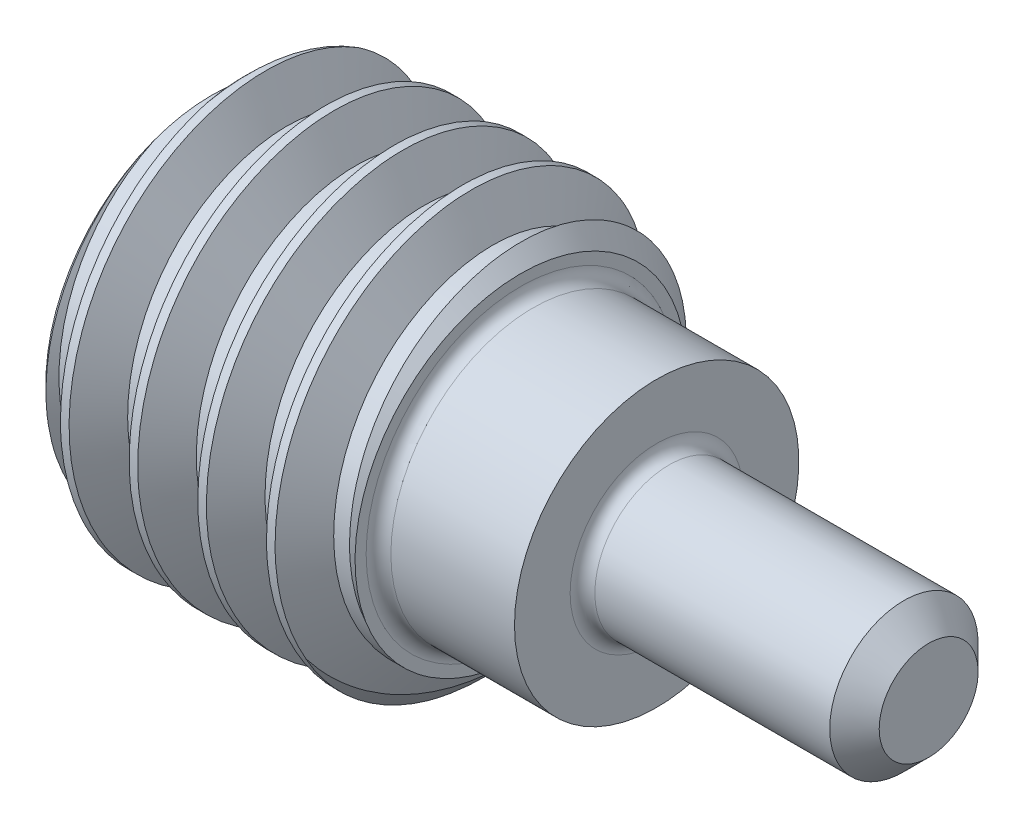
ISO-10303-21;
HEADER;
FILE_DESCRIPTION(('STEP AP214'),'2;1');
FILE_NAME('part.step','',(''),(''),'','','');
FILE_SCHEMA(('AUTOMOTIVE_DESIGN { 1 0 10303 214 1 1 1 1 }'));
ENDSEC;
DATA;
#1=APPLICATION_CONTEXT('core data for automotive mechanical design processes');
#2=APPLICATION_PROTOCOL_DEFINITION('international standard','automotive_design',2000,#1);
#3=PRODUCT_CONTEXT('',#1,'mechanical');
#4=PRODUCT('Part','Part','',(#3));
#5=PRODUCT_RELATED_PRODUCT_CATEGORY('part','',(#4));
#6=PRODUCT_DEFINITION_FORMATION('','',#4);
#7=PRODUCT_DEFINITION_CONTEXT('part definition',#1,'design');
#8=PRODUCT_DEFINITION('design','',#6,#7);
#9=PRODUCT_DEFINITION_SHAPE('','',#8);
#10=(LENGTH_UNIT() NAMED_UNIT(*) SI_UNIT(.MILLI.,.METRE.));
#11=(NAMED_UNIT(*) PLANE_ANGLE_UNIT() SI_UNIT($,.RADIAN.));
#12=(NAMED_UNIT(*) SI_UNIT($,.STERADIAN.) SOLID_ANGLE_UNIT());
#13=UNCERTAINTY_MEASURE_WITH_UNIT(LENGTH_MEASURE(1.E-05),#10,'distance_accuracy_value','');
#14=(GEOMETRIC_REPRESENTATION_CONTEXT(3) GLOBAL_UNCERTAINTY_ASSIGNED_CONTEXT((#13)) GLOBAL_UNIT_ASSIGNED_CONTEXT((#10,
#11,#12)) REPRESENTATION_CONTEXT('',''));
#15=CARTESIAN_POINT('',(0.,0.,0.));
#16=DIRECTION('',(0.,0.,1.));
#17=DIRECTION('',(1.,0.,0.));
#18=AXIS2_PLACEMENT_3D('',#15,#16,#17);
#19=CARTESIAN_POINT('',(1.524,0.,0.));
#20=DIRECTION('',(-1.,0.,0.));
#21=DIRECTION('',(0.,0.,1.));
#22=AXIS2_PLACEMENT_3D('',#19,#20,#21);
#23=PLANE('',#22);
#24=CARTESIAN_POINT('',(1.524,0.,0.));
#25=DIRECTION('',(-1.,0.,0.));
#26=DIRECTION('',(0.,0.,1.));
#27=AXIS2_PLACEMENT_3D('',#24,#25,#26);
#28=CIRCLE('',#27,0.9906);
#29=CARTESIAN_POINT('',(1.524,0.,0.9906));
#30=VERTEX_POINT('',#29);
#31=CARTESIAN_POINT('',(1.524,0.857884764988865,0.4953));
#32=VERTEX_POINT('',#31);
#33=EDGE_CURVE('E54',#30,#32,#28,.T.);
#34=ORIENTED_EDGE('',*,*,#33,.F.);
#35=DIRECTION('',(0.,1.,0.));
#36=VECTOR('',#35,1.);
#37=CARTESIAN_POINT('',(1.524,-0.571923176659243,0.9906));
#38=LINE('',#37,#36);
#39=CARTESIAN_POINT('',(1.524,0.571923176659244,0.990599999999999));
#40=VERTEX_POINT('',#39);
#41=EDGE_CURVE('E161',#30,#40,#38,.T.);
#42=ORIENTED_EDGE('',*,*,#41,.T.);
#43=DIRECTION('',(0.,0.5,-0.866025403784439));
#44=VECTOR('',#43,1.);
#45=CARTESIAN_POINT('',(1.524,0.571923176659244,0.990599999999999));
#46=LINE('',#45,#44);
#47=EDGE_CURVE('E164',#40,#32,#46,.T.);
#48=ORIENTED_EDGE('',*,*,#47,.T.);
#49=EDGE_LOOP('',(#34,#42,#48));
#50=FACE_BOUND('',#49,.T.);
#51=ADVANCED_FACE('F41',(#50),#23,.T.);
#52=CARTESIAN_POINT('',(1.524,0.857884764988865,-0.4953));
#53=VERTEX_POINT('',#52);
#54=EDGE_CURVE('E12',#32,#53,#28,.T.);
#55=ORIENTED_EDGE('',*,*,#54,.F.);
#56=CARTESIAN_POINT('',(1.524,1.14384635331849,0.));
#57=VERTEX_POINT('',#56);
#58=EDGE_CURVE('E198',#32,#57,#46,.T.);
#59=ORIENTED_EDGE('',*,*,#58,.T.);
#60=DIRECTION('',(0.,-0.5,-0.866025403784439));
#61=VECTOR('',#60,1.);
#62=CARTESIAN_POINT('',(1.524,1.14384635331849,0.));
#63=LINE('',#62,#61);
#64=EDGE_CURVE('E506',#57,#53,#63,.T.);
#65=ORIENTED_EDGE('',*,*,#64,.T.);
#66=EDGE_LOOP('',(#55,#59,#65));
#67=FACE_BOUND('',#66,.T.);
#68=ADVANCED_FACE('F457',(#67),#23,.T.);
#69=CARTESIAN_POINT('',(1.524,0.,-0.9906));
#70=VERTEX_POINT('',#69);
#71=EDGE_CURVE('E52',#53,#70,#28,.T.);
#72=ORIENTED_EDGE('',*,*,#71,.F.);
#73=CARTESIAN_POINT('',(1.524,0.571923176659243,-0.9906));
#74=VERTEX_POINT('',#73);
#75=EDGE_CURVE('E509',#53,#74,#63,.T.);
#76=ORIENTED_EDGE('',*,*,#75,.T.);
#77=DIRECTION('',(0.,-1.,0.));
#78=VECTOR('',#77,1.);
#79=CARTESIAN_POINT('',(1.524,0.571923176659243,-0.9906));
#80=LINE('',#79,#78);
#81=EDGE_CURVE('E498',#74,#70,#80,.T.);
#82=ORIENTED_EDGE('',*,*,#81,.T.);
#83=EDGE_LOOP('',(#72,#76,#82));
#84=FACE_BOUND('',#83,.T.);
#85=ADVANCED_FACE('F462',(#84),#23,.T.);
#86=CARTESIAN_POINT('',(1.524,-0.857884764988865,-0.4953));
#87=VERTEX_POINT('',#86);
#88=EDGE_CURVE('E492',#70,#87,#28,.T.);
#89=ORIENTED_EDGE('',*,*,#88,.F.);
#90=CARTESIAN_POINT('',(1.524,-0.571923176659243,-0.990599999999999));
#91=VERTEX_POINT('',#90);
#92=EDGE_CURVE('E501',#70,#91,#80,.T.);
#93=ORIENTED_EDGE('',*,*,#92,.T.);
#94=DIRECTION('',(0.,-0.5,0.866025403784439));
#95=VECTOR('',#94,1.);
#96=CARTESIAN_POINT('',(1.524,-0.571923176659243,-0.990599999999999));
#97=LINE('',#96,#95);
#98=EDGE_CURVE('E497',#91,#87,#97,.T.);
#99=ORIENTED_EDGE('',*,*,#98,.T.);
#100=EDGE_LOOP('',(#89,#93,#99));
#101=FACE_BOUND('',#100,.T.);
#102=ADVANCED_FACE('F478',(#101),#23,.T.);
#103=CARTESIAN_POINT('',(1.524,-0.857884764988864,0.4953));
#104=VERTEX_POINT('',#103);
#105=EDGE_CURVE('E61',#87,#104,#28,.T.);
#106=ORIENTED_EDGE('',*,*,#105,.F.);
#107=CARTESIAN_POINT('',(1.524,-1.14384635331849,0.));
#108=VERTEX_POINT('',#107);
#109=EDGE_CURVE('E489',#87,#108,#97,.T.);
#110=ORIENTED_EDGE('',*,*,#109,.T.);
#111=DIRECTION('',(0.,0.5,0.866025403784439));
#112=VECTOR('',#111,1.);
#113=CARTESIAN_POINT('',(1.524,-1.14384635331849,0.));
#114=LINE('',#113,#112);
#115=EDGE_CURVE('E172',#108,#104,#114,.T.);
#116=ORIENTED_EDGE('',*,*,#115,.T.);
#117=EDGE_LOOP('',(#106,#110,#116));
#118=FACE_BOUND('',#117,.T.);
#119=ADVANCED_FACE('F468',(#118),#23,.T.);
#120=CARTESIAN_POINT('',(3.175,1.7018,0.));
#121=DIRECTION('',(-1.,0.,0.));
#122=DIRECTION('',(0.,0.,1.));
#123=AXIS2_PLACEMENT_3D('',#120,#121,#122);
#124=PLANE('',#123);
#125=CARTESIAN_POINT('',(3.175,0.,0.));
#126=DIRECTION('',(-1.,0.,0.));
#127=DIRECTION('',(0.,0.,1.));
#128=AXIS2_PLACEMENT_3D('',#125,#126,#127);
#129=CIRCLE('',#128,1.5875);
#130=CARTESIAN_POINT('',(3.175,0.,1.5875));
#131=VERTEX_POINT('',#130);
#132=EDGE_CURVE('E383',#131,#131,#129,.T.);
#133=ORIENTED_EDGE('',*,*,#132,.T.);
#134=EDGE_LOOP('',(#133));
#135=FACE_BOUND('',#134,.T.);
#136=CARTESIAN_POINT('',(3.175,-0.706679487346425,-1.7222216));
#137=CARTESIAN_POINT('',(3.175,-0.751685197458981,-1.69778422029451));
#138=CARTESIAN_POINT('',(3.175,-0.795634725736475,-1.67147124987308));
#139=CARTESIAN_POINT('',(3.175,-0.881171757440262,-1.61524294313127));
#140=CARTESIAN_POINT('',(3.175,-0.922759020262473,-1.58532724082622));
#141=CARTESIAN_POINT('',(3.175,-1.0437495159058,-1.49028157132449));
#142=CARTESIAN_POINT('',(3.175,-1.11920047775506,-1.41995137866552));
#143=CARTESIAN_POINT('',(3.175,-1.22259034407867,-1.30583230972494));
#144=CARTESIAN_POINT('',(3.175,-1.25543202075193,-1.26634045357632));
#145=CARTESIAN_POINT('',(3.175,-1.3176904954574,-1.18470602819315));
#146=CARTESIAN_POINT('',(3.175,-1.34710636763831,-1.14256274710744));
#147=CARTESIAN_POINT('',(3.175,-1.40220722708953,-1.05606079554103));
#148=CARTESIAN_POINT('',(3.175,-1.42790203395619,-1.01170838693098));
#149=CARTESIAN_POINT('',(3.175,-1.46356819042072,-0.943702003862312));
#150=CARTESIAN_POINT('',(3.175,-1.4749760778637,-0.920790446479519));
#151=CARTESIAN_POINT('',(3.175,-1.49682688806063,-0.874512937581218));
#152=CARTESIAN_POINT('',(3.175,-1.50726997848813,-0.851147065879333));
#153=CARTESIAN_POINT('',(3.175,-1.52531595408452,-0.808033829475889));
#154=CARTESIAN_POINT('',(3.175,-1.53309740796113,-0.788361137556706));
#155=CARTESIAN_POINT('',(3.175,-1.54788915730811,-0.748733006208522));
#156=CARTESIAN_POINT('',(3.175,-1.55489962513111,-0.728777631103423));
#157=CARTESIAN_POINT('',(3.175,-1.56813271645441,-0.688620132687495));
#158=CARTESIAN_POINT('',(3.175,-1.57435579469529,-0.668418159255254));
#159=CARTESIAN_POINT('',(3.175,-1.58601156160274,-0.627781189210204));
#160=CARTESIAN_POINT('',(3.17499999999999,-1.59144402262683,-0.607346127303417));
#161=CARTESIAN_POINT('',(3.17499999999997,-1.59647573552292,-0.58681287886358));
#162=B_SPLINE_CURVE_WITH_KNOTS('',3,(#136,#137,#138,#139,#140,#141,#142,#143,#144,#145,#146,
#147,#148,#149,#150,#151,#152,#153,#154,#155,#156,#157,#158,#159,#160,#161),.UNSPECIFIED.,.F.,
.F.,(4,2,2,2,2,2,2,2,2,2,2,2,4),(0.,0.153525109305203,0.307065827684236,0.614757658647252,
0.768708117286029,0.922700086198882,1.07627797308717,1.15304399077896,1.22979664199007,
1.29324779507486,1.35668473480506,1.42008486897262,1.48350322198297),.UNSPECIFIED.);
#163=CARTESIAN_POINT('',(3.175,-1.59455121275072,-0.594583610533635));
#164=VERTEX_POINT('',#163);
#165=CARTESIAN_POINT('',(3.175,-1.5964757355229,-0.586812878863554));
#166=VERTEX_POINT('',#165);
#167=EDGE_CURVE('E317',#164,#166,#162,.T.);
#168=ORIENTED_EDGE('',*,*,#167,.F.);
#169=CARTESIAN_POINT('',(3.175,0.,0.));
#170=DIRECTION('',(-1.,0.,0.));
#171=DIRECTION('',(0.,0.,1.));
#172=AXIS2_PLACEMENT_3D('',#169,#170,#171);
#173=CIRCLE('',#172,1.7018);
#174=CARTESIAN_POINT('',(3.17474336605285,-0.604977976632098,1.59015883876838));
#175=VERTEX_POINT('',#174);
#176=EDGE_CURVE('E379',#175,#164,#173,.T.);
#177=ORIENTED_EDGE('',*,*,#176,.F.);
#178=CARTESIAN_POINT('',(4.33281923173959,1.61767999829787,-0.52554310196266));
#179=CARTESIAN_POINT('',(4.32106220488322,1.56243234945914,-0.695601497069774));
#180=CARTESIAN_POINT('',(4.31035648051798,1.47302854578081,-0.850453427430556));
#181=CARTESIAN_POINT('',(4.25156018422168,0.982019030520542,-1.70090685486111));
#182=CARTESIAN_POINT('',(4.19276388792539,0.,-1.70090685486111));
#183=CARTESIAN_POINT('',(4.13396759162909,-0.982019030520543,-1.70090685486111));
#184=CARTESIAN_POINT('',(4.07517129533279,-1.47302854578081,-0.850453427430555));
#185=CARTESIAN_POINT('',(4.0163749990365,-1.96403806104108,0.));
#186=CARTESIAN_POINT('',(3.9575787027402,-1.47302854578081,0.850453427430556));
#187=CARTESIAN_POINT('',(3.89878240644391,-0.982019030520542,1.70090685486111));
#188=CARTESIAN_POINT('',(3.83998611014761,0.,1.70090685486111));
#189=CARTESIAN_POINT('',(3.78118981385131,0.982019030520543,1.70090685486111));
#190=CARTESIAN_POINT('',(3.72239351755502,1.47302854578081,0.850453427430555));
#191=CARTESIAN_POINT('',(3.66359722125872,1.96403806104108,0.));
#192=CARTESIAN_POINT('',(3.60480092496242,1.47302854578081,-0.850453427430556));
#193=CARTESIAN_POINT('',(3.54600462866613,0.982019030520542,-1.70090685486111));
#194=CARTESIAN_POINT('',(3.48720833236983,0.,-1.70090685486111));
#195=CARTESIAN_POINT('',(3.42841203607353,-0.982019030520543,-1.70090685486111));
#196=CARTESIAN_POINT('',(3.36961573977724,-1.47302854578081,-0.850453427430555));
#197=CARTESIAN_POINT('',(3.31081944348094,-1.96403806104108,0.));
#198=CARTESIAN_POINT('',(3.25202314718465,-1.47302854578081,0.850453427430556));
#199=CARTESIAN_POINT('',(3.19322685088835,-0.982019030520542,1.70090685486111));
#200=CARTESIAN_POINT('',(3.13443055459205,0.,1.70090685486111));
#201=CARTESIAN_POINT('',(3.07563425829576,0.982019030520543,1.70090685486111));
#202=CARTESIAN_POINT('',(3.01683796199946,1.47302854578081,0.850453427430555));
#203=CARTESIAN_POINT('',(2.95804166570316,1.96403806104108,0.));
#204=CARTESIAN_POINT('',(2.89924536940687,1.47302854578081,-0.850453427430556));
#205=CARTESIAN_POINT('',(2.84044907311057,0.982019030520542,-1.70090685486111));
#206=CARTESIAN_POINT('',(2.78165277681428,0.,-1.70090685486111));
#207=CARTESIAN_POINT('',(2.72285648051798,-0.982019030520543,-1.70090685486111));
#208=CARTESIAN_POINT('',(2.66406018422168,-1.47302854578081,-0.850453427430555));
#209=CARTESIAN_POINT('',(2.60526388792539,-1.96403806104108,0.));
#210=CARTESIAN_POINT('',(2.54646759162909,-1.47302854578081,0.850453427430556));
#211=CARTESIAN_POINT('',(2.48767129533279,-0.982019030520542,1.70090685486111));
#212=CARTESIAN_POINT('',(2.4288749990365,0.,1.70090685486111));
#213=CARTESIAN_POINT('',(2.3700787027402,0.982019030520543,1.70090685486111));
#214=CARTESIAN_POINT('',(2.31128240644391,1.47302854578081,0.850453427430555));
#215=CARTESIAN_POINT('',(2.25248611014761,1.96403806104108,0.));
#216=CARTESIAN_POINT('',(2.19368981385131,1.47302854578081,-0.850453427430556));
#217=CARTESIAN_POINT('',(2.13489351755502,0.982019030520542,-1.70090685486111));
#218=CARTESIAN_POINT('',(2.07609722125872,0.,-1.70090685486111));
#219=CARTESIAN_POINT('',(2.01730092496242,-0.982019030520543,-1.70090685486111));
#220=CARTESIAN_POINT('',(1.95850462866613,-1.47302854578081,-0.850453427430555));
#221=CARTESIAN_POINT('',(1.89970833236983,-1.96403806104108,0.));
#222=CARTESIAN_POINT('',(1.84091203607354,-1.47302854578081,0.850453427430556));
#223=CARTESIAN_POINT('',(1.78211573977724,-0.982019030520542,1.70090685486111));
#224=CARTESIAN_POINT('',(1.72331944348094,0.,1.70090685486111));
#225=CARTESIAN_POINT('',(1.66452314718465,0.982019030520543,1.70090685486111));
#226=CARTESIAN_POINT('',(1.60572685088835,1.47302854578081,0.850453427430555));
#227=CARTESIAN_POINT('',(1.54693055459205,1.96403806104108,0.));
#228=CARTESIAN_POINT('',(1.48813425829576,1.47302854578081,-0.850453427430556));
#229=CARTESIAN_POINT('',(1.42933796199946,0.982019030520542,-1.70090685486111));
#230=CARTESIAN_POINT('',(1.37054166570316,0.,-1.70090685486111));
#231=CARTESIAN_POINT('',(1.31174536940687,-0.982019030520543,-1.70090685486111));
#232=CARTESIAN_POINT('',(1.25294907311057,-1.47302854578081,-0.850453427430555));
#233=CARTESIAN_POINT('',(1.19415277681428,-1.96403806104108,0.));
#234=CARTESIAN_POINT('',(1.13535648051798,-1.47302854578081,0.850453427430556));
#235=CARTESIAN_POINT('',(1.07656018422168,-0.982019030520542,1.70090685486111));
#236=CARTESIAN_POINT('',(1.01776388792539,0.,1.70090685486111));
#237=CARTESIAN_POINT('',(0.958967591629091,0.982019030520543,1.70090685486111));
#238=CARTESIAN_POINT('',(0.900171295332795,1.47302854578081,0.850453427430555));
#239=CARTESIAN_POINT('',(0.841374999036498,1.96403806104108,0.));
#240=CARTESIAN_POINT('',(0.782578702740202,1.47302854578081,-0.850453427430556));
#241=CARTESIAN_POINT('',(0.723782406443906,0.982019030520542,-1.70090685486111));
#242=CARTESIAN_POINT('',(0.664986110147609,0.,-1.70090685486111));
#243=CARTESIAN_POINT('',(0.606189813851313,-0.982019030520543,-1.70090685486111));
#244=CARTESIAN_POINT('',(0.547393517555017,-1.47302854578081,-0.850453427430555));
#245=CARTESIAN_POINT('',(0.48859722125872,-1.96403806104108,0.));
#246=CARTESIAN_POINT('',(0.429800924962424,-1.47302854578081,0.850453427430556));
#247=CARTESIAN_POINT('',(0.371004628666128,-0.982019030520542,1.70090685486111));
#248=CARTESIAN_POINT('',(0.312208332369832,0.,1.70090685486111));
#249=CARTESIAN_POINT('',(0.253412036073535,0.982019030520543,1.70090685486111));
#250=CARTESIAN_POINT('',(0.194615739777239,1.47302854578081,0.850453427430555));
#251=CARTESIAN_POINT('',(0.135819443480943,1.96403806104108,0.));
#252=CARTESIAN_POINT('',(0.0770231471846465,1.47302854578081,-0.850453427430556));
#253=CARTESIAN_POINT('',(0.0182268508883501,0.982019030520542,-1.70090685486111));
#254=CARTESIAN_POINT('',(-0.0405694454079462,0.,-1.70090685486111));
#255=CARTESIAN_POINT('',(-0.0993657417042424,-0.982019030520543,-1.70090685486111));
#256=CARTESIAN_POINT('',(-0.158162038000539,-1.47302854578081,-0.850453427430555));
#257=CARTESIAN_POINT('',(-0.216958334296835,-1.96403806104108,0.));
#258=CARTESIAN_POINT('',(-0.275754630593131,-1.47302854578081,0.850453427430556));
#259=CARTESIAN_POINT('',(-0.334550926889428,-0.982019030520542,1.70090685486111));
#260=CARTESIAN_POINT('',(-0.393347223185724,0.,1.70090685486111));
#261=CARTESIAN_POINT('',(-0.45214351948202,0.982019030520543,1.70090685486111));
#262=CARTESIAN_POINT('',(-0.510939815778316,1.47302854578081,0.850453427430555));
#263=CARTESIAN_POINT('',(-0.569736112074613,1.96403806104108,0.));
#264=CARTESIAN_POINT('',(-0.628532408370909,1.47302854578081,-0.850453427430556));
#265=CARTESIAN_POINT('',(-0.687328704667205,0.982019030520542,-1.70090685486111));
#266=CARTESIAN_POINT('',(-0.746125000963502,0.,-1.70090685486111));
#267=(BOUNDED_CURVE() B_SPLINE_CURVE(2,(#178,#179,#180,#181,#182,#183,#184,#185,#186,#187,#188,
#189,#190,#191,#192,#193,#194,#195,#196,#197,#198,#199,#200,#201,#202,#203,#204,#205,#206,#207,
#208,#209,#210,#211,#212,#213,#214,#215,#216,#217,#218,#219,#220,#221,#222,#223,#224,#225,#226,
#227,#228,#229,#230,#231,#232,#233,#234,#235,#236,#237,#238,#239,#240,#241,#242,#243,#244,#245,
#246,#247,#248,#249,#250,#251,#252,#253,#254,#255,#256,#257,#258,#259,#260,#261,#262,#263,#264,
#265,#266),.UNSPECIFIED.,.F.,.F.) B_SPLINE_CURVE_WITH_KNOTS((3,2,2,2,2,2,2,2,2,2,2,2,2,2,2,2,2,
2,2,2,2,2,2,2,2,2,2,2,2,2,2,2,2,2,2,2,2,2,2,2,2,2,2,2,3),(0.,0.0042602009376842,
0.0250935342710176,0.0459268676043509,0.0667602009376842,0.0875935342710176,0.108426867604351,
0.129260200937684,0.150093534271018,0.170926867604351,0.191760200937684,0.212593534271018,
0.233426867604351,0.254260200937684,0.275093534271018,0.295926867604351,0.316760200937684,
0.337593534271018,0.358426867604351,0.379260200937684,0.400093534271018,0.420926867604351,
0.441760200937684,0.462593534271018,0.483426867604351,0.504260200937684,0.525093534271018,
0.545926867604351,0.566760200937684,0.587593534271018,0.608426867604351,0.629260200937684,
0.650093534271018,0.670926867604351,0.691760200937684,0.712593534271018,0.733426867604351,
0.754260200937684,0.775093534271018,0.795926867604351,0.816760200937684,0.837593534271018,
0.858426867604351,0.879260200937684,0.900093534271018),
.UNSPECIFIED.) CURVE() GEOMETRIC_REPRESENTATION_ITEM() RATIONAL_B_SPLINE_CURVE((0.956411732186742,
0.972603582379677,1.,0.866025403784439,1.,0.866025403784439,1.,0.866025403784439,1.,
0.866025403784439,1.,0.866025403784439,1.,0.866025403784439,1.,0.866025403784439,1.,
0.866025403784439,1.,0.866025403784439,1.,0.866025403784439,1.,0.866025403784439,1.,
0.866025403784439,1.,0.866025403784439,1.,0.866025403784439,1.,0.866025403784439,1.,
0.866025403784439,1.,0.866025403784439,1.,0.866025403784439,1.,0.866025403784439,1.,
0.866025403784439,1.,0.866025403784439,1.,0.866025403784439,1.,0.866025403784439,1.,
0.866025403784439,1.,0.866025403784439,1.,0.866025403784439,1.,0.866025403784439,1.,
0.866025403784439,1.,0.866025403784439,1.,0.866025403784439,1.,0.866025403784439,1.,
0.866025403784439,1.,0.866025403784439,1.,0.866025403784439,1.,0.866025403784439,1.,
0.866025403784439,1.,0.866025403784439,1.,0.866025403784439,1.,0.866025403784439,1.,
0.866025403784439,1.,0.866025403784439,1.,0.866025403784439,1.,0.866025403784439,1.)) REPRESENTATION_ITEM(''));
#268=CARTESIAN_POINT('',(3.175,-0.612016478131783,1.58746316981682));
#269=VERTEX_POINT('',#268);
#270=EDGE_CURVE('E370',#269,#175,#267,.T.);
#271=ORIENTED_EDGE('',*,*,#270,.F.);
#272=CARTESIAN_POINT('',(3.175,-1.5964757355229,-0.586812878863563));
#273=CARTESIAN_POINT('',(3.175,-1.61690401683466,-0.531250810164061));
#274=CARTESIAN_POINT('',(3.175,-1.63441140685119,-0.4746441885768));
#275=CARTESIAN_POINT('',(3.175,-1.66346551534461,-0.35982829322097));
#276=CARTESIAN_POINT('',(3.175,-1.67500299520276,-0.301616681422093));
#277=CARTESIAN_POINT('',(3.175,-1.69711412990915,-0.14834824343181));
#278=CARTESIAN_POINT('',(3.175,-1.70277906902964,-0.0525393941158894));
#279=CARTESIAN_POINT('',(3.175,-1.6979434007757,0.138697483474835));
#280=CARTESIAN_POINT('',(3.175,-1.68743185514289,0.23412521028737));
#281=CARTESIAN_POINT('',(3.175,-1.65053686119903,0.421848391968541));
#282=CARTESIAN_POINT('',(3.175,-1.62415706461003,0.51414456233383));
#283=CARTESIAN_POINT('',(3.175,-1.55628299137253,0.69297497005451));
#284=CARTESIAN_POINT('',(3.175,-1.51479198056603,0.779510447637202));
#285=CARTESIAN_POINT('',(3.175,-1.41786812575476,0.944392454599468));
#286=CARTESIAN_POINT('',(3.175,-1.3624349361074,1.02273878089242));
#287=CARTESIAN_POINT('',(3.175,-1.23920386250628,1.16902126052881));
#288=CARTESIAN_POINT('',(3.175,-1.17140392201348,1.23695567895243));
#289=CARTESIAN_POINT('',(3.175,-1.02606998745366,1.35985893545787));
#290=CARTESIAN_POINT('',(3.175,-0.948643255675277,1.41495391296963));
#291=CARTESIAN_POINT('',(3.175,-0.826505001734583,1.48735547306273));
#292=CARTESIAN_POINT('',(3.175,-0.784758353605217,1.50979573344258));
#293=CARTESIAN_POINT('',(3.175,-0.699537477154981,1.55111955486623));
#294=CARTESIAN_POINT('',(3.175,-0.656063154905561,1.57000292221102));
#295=CARTESIAN_POINT('',(3.175,-0.611855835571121,1.58704649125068));
#296=B_SPLINE_CURVE_WITH_KNOTS('',3,(#272,#273,#274,#275,#276,#277,#278,#279,#280,#281,#282,
#283,#284,#285,#286,#287,#288,#289,#290,#291,#292,#293,#294,#295),.UNSPECIFIED.,.F.,.F.,(4,2,2,
2,2,2,2,2,2,2,2,4),(0.,0.177460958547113,0.355195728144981,0.641675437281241,0.928348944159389,
1.21495650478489,1.50150216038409,1.78805492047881,2.0746553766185,2.35830877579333,
2.50035275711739,2.64240447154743),.UNSPECIFIED.);
#297=EDGE_CURVE('E341',#166,#269,#296,.T.);
#298=ORIENTED_EDGE('',*,*,#297,.F.);
#299=EDGE_LOOP('',(#168,#177,#271,#298));
#300=FACE_BOUND('',#299,.T.);
#301=ADVANCED_FACE('F326',(#135,#300),#124,.F.);
#302=CARTESIAN_POINT('',(3.175,0.,0.));
#303=DIRECTION('',(-1.,0.,0.));
#304=DIRECTION('',(0.,0.,1.));
#305=AXIS2_PLACEMENT_3D('',#302,#303,#304);
#306=CONICAL_SURFACE('',#305,1.7018,0.785398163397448);
#307=CARTESIAN_POINT('',(2.794,-1.00511654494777,1.82422492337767));
#308=CARTESIAN_POINT('',(2.80170997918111,-1.05196623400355,1.78961490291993));
#309=CARTESIAN_POINT('',(2.80946894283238,-1.09733421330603,1.75301237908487));
#310=CARTESIAN_POINT('',(2.82503027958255,-1.1847977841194,1.67610773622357));
#311=CARTESIAN_POINT('',(2.83283264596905,-1.22689386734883,1.63580617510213));
#312=CARTESIAN_POINT('',(2.84847192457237,-1.30774302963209,1.55154476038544));
#313=CARTESIAN_POINT('',(2.85630878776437,-1.34647622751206,1.50756581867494));
#314=CARTESIAN_POINT('',(2.87191653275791,-1.42006027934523,1.41645830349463));
#315=CARTESIAN_POINT('',(2.87968741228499,-1.45491099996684,1.36932962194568));
#316=CARTESIAN_POINT('',(2.89509335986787,-1.52047985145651,1.27227059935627));
#317=CARTESIAN_POINT('',(2.9027284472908,-1.55119857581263,1.22234066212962));
#318=CARTESIAN_POINT('',(2.91782072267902,-1.60827645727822,1.12000994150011));
#319=CARTESIAN_POINT('',(2.92527789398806,-1.63463520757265,1.06760892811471));
#320=CARTESIAN_POINT('',(2.93620696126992,-1.67078353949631,0.987535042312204));
#321=CARTESIAN_POINT('',(2.93980341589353,-1.68225733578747,0.960628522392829));
#322=CARTESIAN_POINT('',(2.94711078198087,-1.70386827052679,0.906297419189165));
#323=CARTESIAN_POINT('',(2.95082168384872,-1.71400552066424,0.878872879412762));
#324=CARTESIAN_POINT('',(2.9583433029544,-1.73292399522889,0.823583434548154));
#325=CARTESIAN_POINT('',(2.96215398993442,-1.7417056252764,0.79571866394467));
#326=CARTESIAN_POINT('',(2.96987262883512,-1.75789440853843,0.739606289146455));
#327=CARTESIAN_POINT('',(2.9737805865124,-1.76530148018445,0.71135866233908));
#328=CARTESIAN_POINT('',(2.98520137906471,-1.78468746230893,0.629298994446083));
#329=CARTESIAN_POINT('',(2.99283243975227,-1.79488199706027,0.575069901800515));
#330=CARTESIAN_POINT('',(3.00837598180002,-1.81021709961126,0.46594069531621));
#331=CARTESIAN_POINT('',(3.01628851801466,-1.81535667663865,0.411040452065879));
#332=CARTESIAN_POINT('',(3.03235863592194,-1.82053901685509,0.300955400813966));
#333=CARTESIAN_POINT('',(3.04051651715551,-1.82057527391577,0.245770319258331));
#334=CARTESIAN_POINT('',(3.0570083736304,-1.81554528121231,0.135690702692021));
#335=CARTESIAN_POINT('',(3.06534232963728,-1.81047958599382,0.0807961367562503));
#336=CARTESIAN_POINT('',(3.09047642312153,-1.78770067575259,-0.082439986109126));
#337=CARTESIAN_POINT('',(3.1074815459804,-1.76242856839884,-0.189833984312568));
#338=CARTESIAN_POINT('',(3.132933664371,-1.71008735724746,-0.345880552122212));
#339=CARTESIAN_POINT('',(3.14141337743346,-1.69021895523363,-0.397083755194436));
#340=CARTESIAN_POINT('',(3.1582870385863,-1.6458316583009,-0.497448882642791));
#341=CARTESIAN_POINT('',(3.166680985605,-1.62131270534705,-0.546610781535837));
#342=CARTESIAN_POINT('',(3.175,-1.59455121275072,-0.594583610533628));
#343=B_SPLINE_CURVE_WITH_KNOTS('',3,(#307,#308,#309,#310,#311,#312,#313,#314,#315,#316,#317,
#318,#319,#320,#321,#322,#323,#324,#325,#326,#327,#328,#329,#330,#331,#332,#333,#334,#335,#336,
#337,#338,#339,#340,#341,#342),.UNSPECIFIED.,.F.,.F.,(4,2,2,2,2,2,2,2,2,2,2,2,2,2,2,2,2,4),(0.,
0.176212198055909,0.35239786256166,0.529562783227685,0.706733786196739,0.883879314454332,
1.06104136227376,1.14942963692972,1.23781052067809,1.32616490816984,1.41452453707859,
1.58138216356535,1.74827248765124,1.91537557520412,2.08246050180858,2.41513448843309,
2.58166605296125,2.74819969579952),.UNSPECIFIED.);
#344=CARTESIAN_POINT('',(2.79400000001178,-1.0051165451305,1.82422492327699));
#345=VERTEX_POINT('',#344);
#346=EDGE_CURVE('E281',#345,#164,#343,.T.);
#347=ORIENTED_EDGE('',*,*,#346,.F.);
#348=CARTESIAN_POINT('',(2.794,0.,0.));
#349=DIRECTION('',(-1.,0.,0.));
#350=DIRECTION('',(0.,0.,1.));
#351=AXIS2_PLACEMENT_3D('',#348,#349,#350);
#352=CIRCLE('',#351,2.0828);
#353=CARTESIAN_POINT('',(2.79399999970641,-2.00544548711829,0.562355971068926));
#354=VERTEX_POINT('',#353);
#355=EDGE_CURVE('E381',#354,#345,#352,.T.);
#356=ORIENTED_EDGE('',*,*,#355,.F.);
#357=CARTESIAN_POINT('',(3.175,-0.60512040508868,1.59058245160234));
#358=CARTESIAN_POINT('',(3.17319950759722,-0.566840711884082,1.60706977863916));
#359=CARTESIAN_POINT('',(3.1714130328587,-0.527972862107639,1.62213369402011));
#360=CARTESIAN_POINT('',(3.16787538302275,-0.449211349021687,1.64935444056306));
#361=CARTESIAN_POINT('',(3.1661242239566,-0.409317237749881,1.66150997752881));
#362=CARTESIAN_POINT('',(3.16094370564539,-0.288529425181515,1.69346214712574));
#363=CARTESIAN_POINT('',(3.15758027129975,-0.206380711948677,1.70880867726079));
#364=CARTESIAN_POINT('',(3.15341406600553,-0.100079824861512,1.72064202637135));
#365=CARTESIAN_POINT('',(3.1524995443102,-0.0764473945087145,1.72276848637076));
#366=CARTESIAN_POINT('',(3.1506995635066,-0.0291117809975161,1.72601732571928));
#367=CARTESIAN_POINT('',(3.149814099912,-0.00540860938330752,1.72713986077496));
#368=CARTESIAN_POINT('',(3.14713401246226,0.0657413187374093,1.72906707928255));
#369=CARTESIAN_POINT('',(3.14531575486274,0.113226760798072,1.72843118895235));
#370=CARTESIAN_POINT('',(3.13975996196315,0.2554049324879,1.72077232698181));
#371=CARTESIAN_POINT('',(3.13592047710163,0.349845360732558,1.7080009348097));
#372=CARTESIAN_POINT('',(3.12796261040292,0.538604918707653,1.66672741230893));
#373=CARTESIAN_POINT('',(3.12383917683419,0.632807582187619,1.63769805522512));
#374=CARTESIAN_POINT('',(3.11555280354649,0.815063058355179,1.56438386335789));
#375=CARTESIAN_POINT('',(3.11138986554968,0.903116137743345,1.52009969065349));
#376=CARTESIAN_POINT('',(3.10309655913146,1.07150843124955,1.4169368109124));
#377=CARTESIAN_POINT('',(3.09896694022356,1.15176108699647,1.35791569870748));
#378=CARTESIAN_POINT('',(3.0929182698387,1.26377973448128,1.25998531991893));
#379=CARTESIAN_POINT('',(3.09092558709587,1.299738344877,1.22576015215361));
#380=CARTESIAN_POINT('',(3.08700076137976,1.36865229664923,1.15439392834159));
#381=CARTESIAN_POINT('',(3.08506861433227,1.4016078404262,1.11725306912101));
#382=CARTESIAN_POINT('',(3.08127578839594,1.46424769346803,1.04035550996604));
#383=CARTESIAN_POINT('',(3.07941505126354,1.49393470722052,1.00060101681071));
#384=CARTESIAN_POINT('',(3.07578875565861,1.54984582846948,0.918736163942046));
#385=CARTESIAN_POINT('',(3.07402320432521,1.57606967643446,0.876625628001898));
#386=CARTESIAN_POINT('',(3.06859917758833,1.64951615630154,0.747316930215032));
#387=CARTESIAN_POINT('',(3.0648115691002,1.69154752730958,0.657099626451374));
#388=CARTESIAN_POINT('',(3.05696769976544,1.76138806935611,0.468673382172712));
#389=CARTESIAN_POINT('',(3.05290700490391,1.78879686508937,0.370317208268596));
#390=CARTESIAN_POINT('',(3.04470775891,1.82697742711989,0.170427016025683));
#391=CARTESIAN_POINT('',(3.04056921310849,1.83775032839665,0.0688932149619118));
#392=CARTESIAN_POINT('',(3.03226566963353,1.84239961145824,-0.136207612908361));
#393=CARTESIAN_POINT('',(3.02810133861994,1.83599799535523,-0.239780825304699));
#394=CARTESIAN_POINT('',(3.01993000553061,1.80585676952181,-0.444421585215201));
#395=CARTESIAN_POINT('',(3.01592298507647,1.78211919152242,-0.54548942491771));
#396=CARTESIAN_POINT('',(3.01010407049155,1.7341018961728,-0.692909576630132));
#397=CARTESIAN_POINT('',(3.00819604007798,1.71602324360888,-0.741361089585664));
#398=CARTESIAN_POINT('',(3.00447402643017,1.67582902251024,-0.836579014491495));
#399=CARTESIAN_POINT('',(3.00266004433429,1.65371340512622,-0.883345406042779));
#400=CARTESIAN_POINT('',(2.99905471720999,1.605675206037,-0.974887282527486));
#401=CARTESIAN_POINT('',(2.99726337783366,1.57975169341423,-1.01966227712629));
#402=CARTESIAN_POINT('',(2.99358629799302,1.52438815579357,-1.10697962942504));
#403=CARTESIAN_POINT('',(2.99170055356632,1.49494798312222,-1.14952189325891));
#404=CARTESIAN_POINT('',(2.98784689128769,1.4321328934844,-1.23284480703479));
#405=CARTESIAN_POINT('',(2.98587809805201,1.39869512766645,-1.27357815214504));
#406=CARTESIAN_POINT('',(2.98189763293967,1.32858857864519,-1.35213869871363));
#407=CARTESIAN_POINT('',(2.97988596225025,1.29191988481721,-1.3899659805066));
#408=CARTESIAN_POINT('',(2.9738115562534,1.1774214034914,-1.49869315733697));
#409=CARTESIAN_POINT('',(2.96970602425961,1.09504371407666,-1.56491186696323));
#410=CARTESIAN_POINT('',(2.96141018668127,0.918638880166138,-1.68416038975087));
#411=CARTESIAN_POINT('',(2.95721999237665,0.824396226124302,-1.73686981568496));
#412=CARTESIAN_POINT('',(2.94896737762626,0.628408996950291,-1.82570522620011));
#413=CARTESIAN_POINT('',(2.94490494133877,0.526665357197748,-1.86183327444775));
#414=CARTESIAN_POINT('',(2.93699041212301,0.318518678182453,-1.91649450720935));
#415=CARTESIAN_POINT('',(2.93313826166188,0.212116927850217,-1.93503252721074));
#416=CARTESIAN_POINT('',(2.92766525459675,0.0514120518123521,-1.949201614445));
#417=CARTESIAN_POINT('',(2.92589091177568,-0.00236933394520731,-1.95164928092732));
#418=CARTESIAN_POINT('',(2.92227364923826,-0.109965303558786,-1.95217024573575));
#419=CARTESIAN_POINT('',(2.92043072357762,-0.163779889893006,-1.95024316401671));
#420=CARTESIAN_POINT('',(2.91665883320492,-0.271703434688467,-1.9419809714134));
#421=CARTESIAN_POINT('',(2.91472911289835,-0.325808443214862,-1.9355944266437));
#422=CARTESIAN_POINT('',(2.91082129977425,-0.433294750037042,-1.91840815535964));
#423=CARTESIAN_POINT('',(2.90884320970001,-0.486676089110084,-1.90760867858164));
#424=CARTESIAN_POINT('',(2.90285599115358,-0.645205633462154,-1.86867984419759));
#425=CARTESIAN_POINT('',(2.89879087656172,-0.748826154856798,-1.8340133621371));
#426=CARTESIAN_POINT('',(2.89052348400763,-0.951649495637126,-1.74704128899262));
#427=CARTESIAN_POINT('',(2.88632046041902,-1.05065819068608,-1.69428580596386));
#428=CARTESIAN_POINT('',(2.87800220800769,-1.23840148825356,-1.57290555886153));
#429=CARTESIAN_POINT('',(2.87388696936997,-1.32713724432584,-1.50428257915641));
#430=CARTESIAN_POINT('',(2.86585570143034,-1.49184355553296,-1.35305847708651));
#431=CARTESIAN_POINT('',(2.86193965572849,-1.56781516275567,-1.27045850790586));
#432=CARTESIAN_POINT('',(2.85629113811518,-1.67052083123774,-1.13795882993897));
#433=CARTESIAN_POINT('',(2.85444503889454,-1.70289390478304,-1.09233444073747));
#434=CARTESIAN_POINT('',(2.85174641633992,-1.74848358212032,-1.02197189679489));
#435=CARTESIAN_POINT('',(2.85085855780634,-1.76318626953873,-0.998194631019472));
#436=CARTESIAN_POINT('',(2.84905902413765,-1.79161918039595,-0.950060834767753));
#437=CARTESIAN_POINT('',(2.84814734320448,-1.80534916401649,-0.925704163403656));
#438=CARTESIAN_POINT('',(2.84537764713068,-1.84517103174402,-0.851570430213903));
#439=CARTESIAN_POINT('',(2.84349380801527,-1.86974303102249,-0.800964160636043));
#440=CARTESIAN_POINT('',(2.83966822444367,-1.91467340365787,-0.697921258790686));
#441=CARTESIAN_POINT('',(2.8377264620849,-1.93503045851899,-0.645484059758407));
#442=CARTESIAN_POINT('',(2.83183539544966,-1.98956226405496,-0.485914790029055));
#443=CARTESIAN_POINT('',(2.82781829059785,-2.01722664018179,-0.376470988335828));
#444=CARTESIAN_POINT('',(2.81959347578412,-2.05493946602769,-0.15103239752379));
#445=CARTESIAN_POINT('',(2.81538379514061,-2.06439151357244,-0.0349401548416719));
#446=CARTESIAN_POINT('',(2.80702212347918,-2.06362001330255,0.197068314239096));
#447=CARTESIAN_POINT('',(2.80287003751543,-2.05343406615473,0.312984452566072));
#448=CARTESIAN_POINT('',(2.79799871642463,-2.02969474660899,0.449765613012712));
#449=CARTESIAN_POINT('',(2.7971931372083,-2.02537024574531,0.472411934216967));
#450=CARTESIAN_POINT('',(2.79559042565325,-2.01597000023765,0.517518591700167));
#451=CARTESIAN_POINT('',(2.79479328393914,-2.01089521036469,0.539979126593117));
#452=CARTESIAN_POINT('',(2.794,-2.00544548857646,0.5623559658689));
#453=B_SPLINE_CURVE_WITH_KNOTS('',3,(#357,#358,#359,#360,#361,#362,#363,#364,#365,#366,#367,
#368,#369,#370,#371,#372,#373,#374,#375,#376,#377,#378,#379,#380,#381,#382,#383,#384,#385,#386,
#387,#388,#389,#390,#391,#392,#393,#394,#395,#396,#397,#398,#399,#400,#401,#402,#403,#404,#405,
#406,#407,#408,#409,#410,#411,#412,#413,#414,#415,#416,#417,#418,#419,#420,#421,#422,#423,#424,
#425,#426,#427,#428,#429,#430,#431,#432,#433,#434,#435,#436,#437,#438,#439,#440,#441,#442,#443,
#444,#445,#446,#447,#448,#449,#450,#451,#452),.UNSPECIFIED.,.F.,.F.,(4,2,2,2,2,2,2,2,2,2,2,2,2,
2,2,2,2,2,2,2,2,2,2,2,2,2,2,2,2,2,2,2,2,2,2,2,2,2,2,2,2,2,2,2,2,2,2,4),(0.,0.12507911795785,
0.250213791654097,0.499998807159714,0.571226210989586,0.642442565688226,0.78488047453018,
1.0696791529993,1.36429796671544,1.65890399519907,1.95647517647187,2.10537751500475,
2.25426981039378,2.40303796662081,2.55181726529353,2.84921580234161,3.15438629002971,
3.4595359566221,3.76965465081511,4.07973700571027,4.2348343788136,4.38993362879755,
4.54507085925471,4.70021460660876,4.85823571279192,5.01625244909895,5.33201281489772,
5.6546842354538,5.97731548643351,6.29985802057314,6.46130401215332,6.6227640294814,
6.78611770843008,6.94946214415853,7.27589284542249,7.61111456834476,7.94629861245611,
8.28145501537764,8.44919819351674,8.53308396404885,8.61699034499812,8.78563915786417,
8.95434064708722,9.29156167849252,9.63964967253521,9.9870718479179,10.0562750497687,
10.1253909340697),.UNSPECIFIED.);
#454=EDGE_CURVE('E258',#175,#354,#453,.T.);
#455=ORIENTED_EDGE('',*,*,#454,.F.);
#456=ORIENTED_EDGE('',*,*,#176,.T.);
#457=EDGE_LOOP('',(#347,#356,#455,#456));
#458=FACE_BOUND('',#457,.T.);
#459=ADVANCED_FACE('F323',(#458),#306,.T.);
#460=CARTESIAN_POINT('',(0.,0.,0.));
#461=DIRECTION('',(-1.,0.,0.));
#462=DIRECTION('',(0.,0.,1.));
#463=AXIS2_PLACEMENT_3D('',#460,#461,#462);
#464=CYLINDRICAL_SURFACE('',#463,2.0828);
#465=CARTESIAN_POINT('',(-1.143,0.,-2.0828));
#466=CARTESIAN_POINT('',(-1.0842037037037,1.20250514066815,-2.0828));
#467=CARTESIAN_POINT('',(-1.02540740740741,1.80375771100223,-1.0414));
#468=CARTESIAN_POINT('',(-0.966611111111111,2.4050102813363,0.));
#469=CARTESIAN_POINT('',(-0.907814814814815,1.80375771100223,1.0414));
#470=CARTESIAN_POINT('',(-0.849018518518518,1.20250514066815,2.0828));
#471=CARTESIAN_POINT('',(-0.790222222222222,0.,2.0828));
#472=CARTESIAN_POINT('',(-0.731425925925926,-1.20250514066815,2.0828));
#473=CARTESIAN_POINT('',(-0.672629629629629,-1.80375771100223,1.0414));
#474=CARTESIAN_POINT('',(-0.613833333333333,-2.4050102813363,0.));
#475=CARTESIAN_POINT('',(-0.555037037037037,-1.80375771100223,-1.0414));
#476=CARTESIAN_POINT('',(-0.49624074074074,-1.20250514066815,-2.0828));
#477=CARTESIAN_POINT('',(-0.437444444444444,0.,-2.0828));
#478=CARTESIAN_POINT('',(-0.378648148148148,1.20250514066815,-2.0828));
#479=CARTESIAN_POINT('',(-0.319851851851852,1.80375771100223,-1.0414));
#480=CARTESIAN_POINT('',(-0.261055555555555,2.4050102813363,0.));
#481=CARTESIAN_POINT('',(-0.202259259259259,1.80375771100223,1.0414));
#482=CARTESIAN_POINT('',(-0.143462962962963,1.20250514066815,2.0828));
#483=CARTESIAN_POINT('',(-0.0846666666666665,0.,2.0828));
#484=CARTESIAN_POINT('',(-0.0258703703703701,-1.20250514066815,2.0828));
#485=CARTESIAN_POINT('',(0.032925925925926,-1.80375771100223,1.0414));
#486=CARTESIAN_POINT('',(0.0917222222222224,-2.4050102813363,0.));
#487=CARTESIAN_POINT('',(0.150518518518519,-1.80375771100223,-1.0414));
#488=CARTESIAN_POINT('',(0.209314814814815,-1.20250514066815,-2.0828));
#489=CARTESIAN_POINT('',(0.268111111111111,0.,-2.0828));
#490=CARTESIAN_POINT('',(0.326907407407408,1.20250514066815,-2.0828));
#491=CARTESIAN_POINT('',(0.385703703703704,1.80375771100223,-1.0414));
#492=CARTESIAN_POINT('',(0.4445,2.4050102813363,0.));
#493=CARTESIAN_POINT('',(0.503296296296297,1.80375771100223,1.0414));
#494=CARTESIAN_POINT('',(0.562092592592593,1.20250514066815,2.0828));
#495=CARTESIAN_POINT('',(0.620888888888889,0.,2.0828));
#496=CARTESIAN_POINT('',(0.679685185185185,-1.20250514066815,2.0828));
#497=CARTESIAN_POINT('',(0.738481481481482,-1.80375771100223,1.0414));
#498=CARTESIAN_POINT('',(0.797277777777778,-2.4050102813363,0.));
#499=CARTESIAN_POINT('',(0.856074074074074,-1.80375771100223,-1.0414));
#500=CARTESIAN_POINT('',(0.91487037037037,-1.20250514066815,-2.0828));
#501=CARTESIAN_POINT('',(0.973666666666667,0.,-2.0828));
#502=CARTESIAN_POINT('',(1.03246296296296,1.20250514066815,-2.0828));
#503=CARTESIAN_POINT('',(1.09125925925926,1.80375771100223,-1.0414));
#504=CARTESIAN_POINT('',(1.15005555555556,2.4050102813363,0.));
#505=CARTESIAN_POINT('',(1.20885185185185,1.80375771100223,1.0414));
#506=CARTESIAN_POINT('',(1.26764814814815,1.20250514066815,2.0828));
#507=CARTESIAN_POINT('',(1.32644444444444,0.,2.0828));
#508=CARTESIAN_POINT('',(1.38524074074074,-1.20250514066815,2.0828));
#509=CARTESIAN_POINT('',(1.44403703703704,-1.80375771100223,1.0414));
#510=CARTESIAN_POINT('',(1.50283333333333,-2.4050102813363,0.));
#511=CARTESIAN_POINT('',(1.56162962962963,-1.80375771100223,-1.0414));
#512=CARTESIAN_POINT('',(1.62042592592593,-1.20250514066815,-2.0828));
#513=CARTESIAN_POINT('',(1.67922222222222,0.,-2.0828));
#514=CARTESIAN_POINT('',(1.73801851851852,1.20250514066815,-2.0828));
#515=CARTESIAN_POINT('',(1.79681481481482,1.80375771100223,-1.0414));
#516=CARTESIAN_POINT('',(1.85561111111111,2.4050102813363,0.));
#517=CARTESIAN_POINT('',(1.91440740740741,1.80375771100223,1.0414));
#518=CARTESIAN_POINT('',(1.9732037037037,1.20250514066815,2.0828));
#519=CARTESIAN_POINT('',(2.032,0.,2.0828));
#520=CARTESIAN_POINT('',(2.0907962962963,-1.20250514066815,2.0828));
#521=CARTESIAN_POINT('',(2.14959259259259,-1.80375771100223,1.0414));
#522=CARTESIAN_POINT('',(2.20838888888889,-2.4050102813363,0.));
#523=CARTESIAN_POINT('',(2.26718518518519,-1.80375771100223,-1.0414));
#524=CARTESIAN_POINT('',(2.32598148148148,-1.20250514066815,-2.0828));
#525=CARTESIAN_POINT('',(2.38477777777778,0.,-2.0828));
#526=CARTESIAN_POINT('',(2.44357407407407,1.20250514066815,-2.0828));
#527=CARTESIAN_POINT('',(2.50237037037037,1.80375771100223,-1.0414));
#528=CARTESIAN_POINT('',(2.56116666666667,2.4050102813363,0.));
#529=CARTESIAN_POINT('',(2.61996296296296,1.80375771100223,1.0414));
#530=CARTESIAN_POINT('',(2.67875925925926,1.20250514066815,2.0828));
#531=CARTESIAN_POINT('',(2.73755555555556,0.,2.0828));
#532=CARTESIAN_POINT('',(2.79635185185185,-1.20250514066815,2.0828));
#533=CARTESIAN_POINT('',(2.85514814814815,-1.80375771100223,1.0414));
#534=CARTESIAN_POINT('',(2.91394444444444,-2.4050102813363,0.));
#535=CARTESIAN_POINT('',(2.97274074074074,-1.80375771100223,-1.0414));
#536=CARTESIAN_POINT('',(3.03153703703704,-1.20250514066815,-2.0828));
#537=CARTESIAN_POINT('',(3.09033333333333,0.,-2.0828));
#538=CARTESIAN_POINT('',(3.14912962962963,1.20250514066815,-2.0828));
#539=CARTESIAN_POINT('',(3.20792592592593,1.80375771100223,-1.0414));
#540=CARTESIAN_POINT('',(3.26672222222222,2.4050102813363,0.));
#541=CARTESIAN_POINT('',(3.32551851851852,1.80375771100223,1.0414));
#542=CARTESIAN_POINT('',(3.38431481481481,1.20250514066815,2.0828));
#543=CARTESIAN_POINT('',(3.44311111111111,0.,2.0828));
#544=CARTESIAN_POINT('',(3.50190740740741,-1.20250514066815,2.0828));
#545=CARTESIAN_POINT('',(3.5607037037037,-1.80375771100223,1.0414));
#546=CARTESIAN_POINT('',(3.6195,-2.4050102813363,0.));
#547=CARTESIAN_POINT('',(3.6782962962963,-1.80375771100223,-1.0414));
#548=CARTESIAN_POINT('',(3.73709259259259,-1.20250514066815,-2.0828));
#549=CARTESIAN_POINT('',(3.79588888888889,0.,-2.0828));
#550=CARTESIAN_POINT('',(3.85468518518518,1.20250514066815,-2.0828));
#551=CARTESIAN_POINT('',(3.91348148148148,1.80375771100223,-1.0414));
#552=CARTESIAN_POINT('',(3.9241872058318,1.91323474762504,-0.851780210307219));
#553=CARTESIAN_POINT('',(3.93594423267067,1.98088677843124,-0.643539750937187));
#554=(BOUNDED_CURVE() B_SPLINE_CURVE(2,(#465,#466,#467,#468,#469,#470,#471,#472,#473,#474,#475,
#476,#477,#478,#479,#480,#481,#482,#483,#484,#485,#486,#487,#488,#489,#490,#491,#492,#493,#494,
#495,#496,#497,#498,#499,#500,#501,#502,#503,#504,#505,#506,#507,#508,#509,#510,#511,#512,#513,
#514,#515,#516,#517,#518,#519,#520,#521,#522,#523,#524,#525,#526,#527,#528,#529,#530,#531,#532,
#533,#534,#535,#536,#537,#538,#539,#540,#541,#542,#543,#544,#545,#546,#547,#548,#549,#550,#551,
#552,#553),.UNSPECIFIED.,.F.,.F.) B_SPLINE_CURVE_WITH_KNOTS((3,2,2,2,2,2,2,2,2,2,2,2,2,2,2,2,2,
2,2,2,2,2,2,2,2,2,2,2,2,2,2,2,2,2,2,2,2,2,2,2,2,2,2,2,3),(0.,0.0208333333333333,
0.0416666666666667,0.0625,0.0833333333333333,0.104166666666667,0.125,0.145833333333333,
0.166666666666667,0.1875,0.208333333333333,0.229166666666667,0.25,0.270833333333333,
0.291666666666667,0.3125,0.333333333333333,0.354166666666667,0.375,0.395833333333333,
0.416666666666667,0.4375,0.458333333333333,0.479166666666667,0.5,0.520833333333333,
0.541666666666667,0.5625,0.583333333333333,0.604166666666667,0.625,0.645833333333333,
0.666666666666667,0.6875,0.708333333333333,0.729166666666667,0.75,0.770833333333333,
0.791666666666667,0.8125,0.833333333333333,0.854166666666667,0.875,0.895833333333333,
0.900093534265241),
.UNSPECIFIED.) CURVE() GEOMETRIC_REPRESENTATION_ITEM() RATIONAL_B_SPLINE_CURVE((1.,
0.866025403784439,1.,0.866025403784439,1.,0.866025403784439,1.,0.866025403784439,1.,
0.866025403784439,1.,0.866025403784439,1.,0.866025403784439,1.,0.866025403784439,1.,
0.866025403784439,1.,0.866025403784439,1.,0.866025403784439,1.,0.866025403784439,1.,
0.866025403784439,1.,0.866025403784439,1.,0.866025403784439,1.,0.866025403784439,1.,
0.866025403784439,1.,0.866025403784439,1.,0.866025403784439,1.,0.866025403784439,1.,
0.866025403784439,1.,0.866025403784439,1.,0.866025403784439,1.,0.866025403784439,1.,
0.866025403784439,1.,0.866025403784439,1.,0.866025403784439,1.,0.866025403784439,1.,
0.866025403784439,1.,0.866025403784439,1.,0.866025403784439,1.,0.866025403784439,1.,
0.866025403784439,1.,0.866025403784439,1.,0.866025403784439,1.,0.866025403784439,1.,
0.866025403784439,1.,0.866025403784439,1.,0.866025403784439,1.,0.866025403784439,1.,
0.866025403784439,1.,0.866025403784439,1.,0.866025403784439,1.,0.972603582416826,0.956411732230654)) REPRESENTATION_ITEM(''));
#555=CARTESIAN_POINT('',(0.381000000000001,1.75440730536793,-1.12254659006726));
#556=VERTEX_POINT('',#555);
#557=EDGE_CURVE('E374',#556,#345,#554,.T.);
#558=ORIENTED_EDGE('',*,*,#557,.F.);
#559=CARTESIAN_POINT('',(0.381,0.,0.));
#560=DIRECTION('',(-1.,0.,0.));
#561=DIRECTION('',(0.,0.,1.));
#562=AXIS2_PLACEMENT_3D('',#559,#560,#561);
#563=CIRCLE('',#562,2.0828);
#564=CARTESIAN_POINT('',(0.381,2.03635643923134,0.437388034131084));
#565=VERTEX_POINT('',#564);
#566=EDGE_CURVE('E388',#565,#556,#563,.T.);
#567=ORIENTED_EDGE('',*,*,#566,.F.);
#568=CARTESIAN_POINT('',(4.55330382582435,1.98087805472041,-0.643566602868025));
#569=CARTESIAN_POINT('',(4.54154761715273,1.91322761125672,-0.851792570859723));
#570=CARTESIAN_POINT('',(4.53084259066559,1.80375771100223,-1.0414));
#571=CARTESIAN_POINT('',(4.47204629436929,1.20250514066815,-2.0828));
#572=CARTESIAN_POINT('',(4.413249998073,0.,-2.0828));
#573=CARTESIAN_POINT('',(4.3544537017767,-1.20250514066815,-2.0828));
#574=CARTESIAN_POINT('',(4.2956574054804,-1.80375771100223,-1.0414));
#575=CARTESIAN_POINT('',(4.23686110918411,-2.4050102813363,0.));
#576=CARTESIAN_POINT('',(4.17806481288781,-1.80375771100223,1.0414));
#577=CARTESIAN_POINT('',(4.11926851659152,-1.20250514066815,2.0828));
#578=CARTESIAN_POINT('',(4.06047222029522,0.,2.0828));
#579=CARTESIAN_POINT('',(4.00167592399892,1.20250514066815,2.0828));
#580=CARTESIAN_POINT('',(3.94287962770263,1.80375771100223,1.0414));
#581=CARTESIAN_POINT('',(3.88408333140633,2.4050102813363,0.));
#582=CARTESIAN_POINT('',(3.82528703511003,1.80375771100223,-1.0414));
#583=CARTESIAN_POINT('',(3.76649073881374,1.20250514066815,-2.0828));
#584=CARTESIAN_POINT('',(3.70769444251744,0.,-2.0828));
#585=CARTESIAN_POINT('',(3.64889814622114,-1.20250514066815,-2.0828));
#586=CARTESIAN_POINT('',(3.59010184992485,-1.80375771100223,-1.0414));
#587=CARTESIAN_POINT('',(3.53130555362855,-2.4050102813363,0.));
#588=CARTESIAN_POINT('',(3.47250925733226,-1.80375771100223,1.0414));
#589=CARTESIAN_POINT('',(3.41371296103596,-1.20250514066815,2.0828));
#590=CARTESIAN_POINT('',(3.35491666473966,0.,2.0828));
#591=CARTESIAN_POINT('',(3.29612036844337,1.20250514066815,2.0828));
#592=CARTESIAN_POINT('',(3.23732407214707,1.80375771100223,1.0414));
#593=CARTESIAN_POINT('',(3.17852777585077,2.4050102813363,0.));
#594=CARTESIAN_POINT('',(3.11973147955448,1.80375771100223,-1.0414));
#595=CARTESIAN_POINT('',(3.06093518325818,1.20250514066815,-2.0828));
#596=CARTESIAN_POINT('',(3.00213888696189,0.,-2.0828));
#597=CARTESIAN_POINT('',(2.94334259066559,-1.20250514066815,-2.0828));
#598=CARTESIAN_POINT('',(2.88454629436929,-1.80375771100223,-1.0414));
#599=CARTESIAN_POINT('',(2.825749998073,-2.4050102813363,0.));
#600=CARTESIAN_POINT('',(2.7669537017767,-1.80375771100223,1.0414));
#601=CARTESIAN_POINT('',(2.7081574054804,-1.20250514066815,2.0828));
#602=CARTESIAN_POINT('',(2.64936110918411,0.,2.0828));
#603=CARTESIAN_POINT('',(2.59056481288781,1.20250514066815,2.0828));
#604=CARTESIAN_POINT('',(2.53176851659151,1.80375771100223,1.0414));
#605=CARTESIAN_POINT('',(2.47297222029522,2.4050102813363,0.));
#606=CARTESIAN_POINT('',(2.41417592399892,1.80375771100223,-1.0414));
#607=CARTESIAN_POINT('',(2.35537962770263,1.20250514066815,-2.0828));
#608=CARTESIAN_POINT('',(2.29658333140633,0.,-2.0828));
#609=CARTESIAN_POINT('',(2.23778703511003,-1.20250514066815,-2.0828));
#610=CARTESIAN_POINT('',(2.17899073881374,-1.80375771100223,-1.0414));
#611=CARTESIAN_POINT('',(2.12019444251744,-2.4050102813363,0.));
#612=CARTESIAN_POINT('',(2.06139814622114,-1.80375771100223,1.0414));
#613=CARTESIAN_POINT('',(2.00260184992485,-1.20250514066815,2.0828));
#614=CARTESIAN_POINT('',(1.94380555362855,0.,2.0828));
#615=CARTESIAN_POINT('',(1.88500925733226,1.20250514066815,2.0828));
#616=CARTESIAN_POINT('',(1.82621296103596,1.80375771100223,1.0414));
#617=CARTESIAN_POINT('',(1.76741666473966,2.4050102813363,0.));
#618=CARTESIAN_POINT('',(1.70862036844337,1.80375771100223,-1.0414));
#619=CARTESIAN_POINT('',(1.64982407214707,1.20250514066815,-2.0828));
#620=CARTESIAN_POINT('',(1.59102777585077,0.,-2.0828));
#621=CARTESIAN_POINT('',(1.53223147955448,-1.20250514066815,-2.0828));
#622=CARTESIAN_POINT('',(1.47343518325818,-1.80375771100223,-1.0414));
#623=CARTESIAN_POINT('',(1.41463888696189,-2.4050102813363,0.));
#624=CARTESIAN_POINT('',(1.35584259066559,-1.80375771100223,1.0414));
#625=CARTESIAN_POINT('',(1.29704629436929,-1.20250514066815,2.0828));
#626=CARTESIAN_POINT('',(1.238249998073,0.,2.0828));
#627=CARTESIAN_POINT('',(1.1794537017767,1.20250514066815,2.0828));
#628=CARTESIAN_POINT('',(1.1206574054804,1.80375771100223,1.0414));
#629=CARTESIAN_POINT('',(1.06186110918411,2.4050102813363,0.));
#630=CARTESIAN_POINT('',(1.00306481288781,1.80375771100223,-1.0414));
#631=CARTESIAN_POINT('',(0.944268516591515,1.20250514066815,-2.0828));
#632=CARTESIAN_POINT('',(0.885472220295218,0.,-2.0828));
#633=CARTESIAN_POINT('',(0.826675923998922,-1.20250514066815,-2.0828));
#634=CARTESIAN_POINT('',(0.767879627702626,-1.80375771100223,-1.0414));
#635=CARTESIAN_POINT('',(0.70908333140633,-2.4050102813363,0.));
#636=CARTESIAN_POINT('',(0.650287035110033,-1.80375771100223,1.0414));
#637=CARTESIAN_POINT('',(0.591490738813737,-1.20250514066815,2.0828));
#638=CARTESIAN_POINT('',(0.532694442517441,0.,2.0828));
#639=CARTESIAN_POINT('',(0.473898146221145,1.20250514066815,2.0828));
#640=CARTESIAN_POINT('',(0.415101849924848,1.80375771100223,1.0414));
#641=CARTESIAN_POINT('',(0.356305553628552,2.4050102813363,0.));
#642=CARTESIAN_POINT('',(0.297509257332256,1.80375771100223,-1.0414));
#643=CARTESIAN_POINT('',(0.238712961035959,1.20250514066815,-2.0828));
#644=CARTESIAN_POINT('',(0.179916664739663,0.,-2.0828));
#645=CARTESIAN_POINT('',(0.121120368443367,-1.20250514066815,-2.0828));
#646=CARTESIAN_POINT('',(0.0623240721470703,-1.80375771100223,-1.0414));
#647=CARTESIAN_POINT('',(0.00352777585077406,-2.4050102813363,0.));
#648=CARTESIAN_POINT('',(-0.0552685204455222,-1.80375771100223,1.0414));
#649=CARTESIAN_POINT('',(-0.114064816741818,-1.20250514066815,2.0828));
#650=CARTESIAN_POINT('',(-0.172861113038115,0.,2.0828));
#651=CARTESIAN_POINT('',(-0.231657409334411,1.20250514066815,2.0828));
#652=CARTESIAN_POINT('',(-0.290453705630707,1.80375771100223,1.0414));
#653=CARTESIAN_POINT('',(-0.349250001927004,2.4050102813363,0.));
#654=CARTESIAN_POINT('',(-0.4080462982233,1.80375771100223,-1.0414));
#655=CARTESIAN_POINT('',(-0.466842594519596,1.20250514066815,-2.0828));
#656=CARTESIAN_POINT('',(-0.525638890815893,0.,-2.0828));
#657=(BOUNDED_CURVE() B_SPLINE_CURVE(2,(#568,#569,#570,#571,#572,#573,#574,#575,#576,#577,#578,
#579,#580,#581,#582,#583,#584,#585,#586,#587,#588,#589,#590,#591,#592,#593,#594,#595,#596,#597,
#598,#599,#600,#601,#602,#603,#604,#605,#606,#607,#608,#609,#610,#611,#612,#613,#614,#615,#616,
#617,#618,#619,#620,#621,#622,#623,#624,#625,#626,#627,#628,#629,#630,#631,#632,#633,#634,#635,
#636,#637,#638,#639,#640,#641,#642,#643,#644,#645,#646,#647,#648,#649,#650,#651,#652,#653,#654,
#655,#656),.UNSPECIFIED.,.F.,.F.) B_SPLINE_CURVE_WITH_KNOTS((3,2,2,2,2,2,2,2,2,2,2,2,2,2,2,2,2,
2,2,2,2,2,2,2,2,2,2,2,2,2,2,2,2,2,2,2,2,2,2,2,2,2,2,2,3),(0.,0.00425993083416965,
0.025093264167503,0.0459265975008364,0.0667599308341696,0.087593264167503,0.108426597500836,
0.12925993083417,0.150093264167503,0.170926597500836,0.19175993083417,0.212593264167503,
0.233426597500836,0.25425993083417,0.275093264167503,0.295926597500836,0.31675993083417,
0.337593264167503,0.358426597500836,0.37925993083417,0.400093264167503,0.420926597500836,
0.44175993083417,0.462593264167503,0.483426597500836,0.50425993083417,0.525093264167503,
0.545926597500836,0.56675993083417,0.587593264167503,0.608426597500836,0.62925993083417,
0.650093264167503,0.670926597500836,0.69175993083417,0.712593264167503,0.733426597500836,
0.75425993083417,0.775093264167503,0.795926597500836,0.81675993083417,0.837593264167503,
0.858426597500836,0.87925993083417,0.900093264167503),
.UNSPECIFIED.) CURVE() GEOMETRIC_REPRESENTATION_ITEM() RATIONAL_B_SPLINE_CURVE((0.956413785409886,
0.972605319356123,1.,0.866025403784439,1.,0.866025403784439,1.,0.866025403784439,1.,
0.866025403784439,1.,0.866025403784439,1.,0.866025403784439,1.,0.866025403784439,1.,
0.866025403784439,1.,0.866025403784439,1.,0.866025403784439,1.,0.866025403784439,1.,
0.866025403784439,1.,0.866025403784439,1.,0.866025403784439,1.,0.866025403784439,1.,
0.866025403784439,1.,0.866025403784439,1.,0.866025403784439,1.,0.866025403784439,1.,
0.866025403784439,1.,0.866025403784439,1.,0.866025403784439,1.,0.866025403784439,1.,
0.866025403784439,1.,0.866025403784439,1.,0.866025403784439,1.,0.866025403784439,1.,
0.866025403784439,1.,0.866025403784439,1.,0.866025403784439,1.,0.866025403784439,1.,
0.866025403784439,1.,0.866025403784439,1.,0.866025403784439,1.,0.866025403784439,1.,
0.866025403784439,1.,0.866025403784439,1.,0.866025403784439,1.,0.866025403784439,1.,
0.866025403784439,1.,0.866025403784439,1.,0.866025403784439,1.,0.866025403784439,1.)) REPRESENTATION_ITEM(''));
#658=EDGE_CURVE('E200',#565,#354,#657,.F.);
#659=ORIENTED_EDGE('',*,*,#658,.T.);
#660=ORIENTED_EDGE('',*,*,#355,.T.);
#661=EDGE_LOOP('',(#558,#567,#659,#660));
#662=FACE_BOUND('',#661,.T.);
#663=ADVANCED_FACE('F265',(#662),#464,.T.);
#664=CARTESIAN_POINT('',(0.381,0.,0.));
#665=DIRECTION('',(1.,0.,0.));
#666=DIRECTION('',(0.,0.,-1.));
#667=AXIS2_PLACEMENT_3D('',#664,#665,#666);
#668=CONICAL_SURFACE('',#667,2.0828,0.785398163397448);
#669=CARTESIAN_POINT('',(0.,1.59455121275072,0.594583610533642));
#670=CARTESIAN_POINT('',(0.00171352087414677,1.58161069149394,0.634200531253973));
#671=CARTESIAN_POINT('',(0.00339469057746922,1.56717943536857,0.673331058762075));
#672=CARTESIAN_POINT('',(0.00669536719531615,1.53545545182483,0.75037416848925));
#673=CARTESIAN_POINT('',(0.00831493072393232,1.51816543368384,0.788287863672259));
#674=CARTESIAN_POINT('',(0.0114989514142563,1.48081556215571,0.862734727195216));
#675=CARTESIAN_POINT('',(0.0130633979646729,1.46075517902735,0.899267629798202));
#676=CARTESIAN_POINT('',(0.0162711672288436,1.41809841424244,0.970823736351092));
#677=CARTESIAN_POINT('',(0.0179145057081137,1.39550152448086,1.00584663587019));
#678=CARTESIAN_POINT('',(0.0214921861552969,1.34426368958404,1.07934414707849));
#679=CARTESIAN_POINT('',(0.0234330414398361,1.31522516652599,1.11754285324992));
#680=CARTESIAN_POINT('',(0.0273627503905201,1.25412252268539,1.19141854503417));
#681=CARTESIAN_POINT('',(0.029351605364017,1.222058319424,1.22709546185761));
#682=CARTESIAN_POINT('',(0.0353667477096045,1.12160729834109,1.32999996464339));
#683=CARTESIAN_POINT('',(0.0394434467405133,1.04893578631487,1.39313893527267));
#684=CARTESIAN_POINT('',(0.0477199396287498,0.892233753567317,1.50811884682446));
#685=CARTESIAN_POINT('',(0.0519201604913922,0.80795553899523,1.55962049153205));
#686=CARTESIAN_POINT('',(0.0602141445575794,0.631948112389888,1.64772501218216));
#687=CARTESIAN_POINT('',(0.0643079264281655,0.540220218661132,1.6843305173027));
#688=CARTESIAN_POINT('',(0.072304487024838,0.351920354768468,1.74162761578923));
#689=CARTESIAN_POINT('',(0.0762072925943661,0.255349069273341,1.76232145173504));
#690=CARTESIAN_POINT('',(0.083628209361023,0.0600852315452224,1.78712551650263));
#691=CARTESIAN_POINT('',(0.0871462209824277,-0.0386078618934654,1.79123146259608));
#692=CARTESIAN_POINT('',(0.0945264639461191,-0.236141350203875,1.78349843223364));
#693=CARTESIAN_POINT('',(0.098391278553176,-0.334976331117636,1.77152858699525));
#694=CARTESIAN_POINT('',(0.106270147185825,-0.529393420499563,1.73167215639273));
#695=CARTESIAN_POINT('',(0.110284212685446,-0.624975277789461,1.70378434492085));
#696=CARTESIAN_POINT('',(0.118503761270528,-0.81348370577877,1.63164513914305));
#697=CARTESIAN_POINT('',(0.122711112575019,-0.90620953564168,1.58686967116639));
#698=CARTESIAN_POINT('',(0.131060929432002,-1.08284563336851,1.48233703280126));
#699=CARTESIAN_POINT('',(0.13520340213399,-1.16675687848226,1.4225815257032));
#700=CARTESIAN_POINT('',(0.141281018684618,-1.28413467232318,1.32309708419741));
#701=CARTESIAN_POINT('',(0.14328506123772,-1.32186049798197,1.28827623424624));
#702=CARTESIAN_POINT('',(0.147234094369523,-1.39425245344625,1.21557016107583));
#703=CARTESIAN_POINT('',(0.149179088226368,-1.42891875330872,1.17768510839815));
#704=CARTESIAN_POINT('',(0.153006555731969,-1.49494502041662,1.09912579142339));
#705=CARTESIAN_POINT('',(0.154889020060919,-1.52630449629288,1.05845111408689));
#706=CARTESIAN_POINT('',(0.158543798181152,-1.58546322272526,0.974584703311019));
#707=CARTESIAN_POINT('',(0.160316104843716,-1.61326224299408,0.931392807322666));
#708=CARTESIAN_POINT('',(0.163931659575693,-1.66530533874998,0.842823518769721));
#709=CARTESIAN_POINT('',(0.165775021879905,-1.68954336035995,0.79744257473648));
#710=CARTESIAN_POINT('',(0.169525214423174,-1.73425609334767,0.704879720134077));
#711=CARTESIAN_POINT('',(0.171432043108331,-1.75473089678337,0.657697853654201));
#712=CARTESIAN_POINT('',(0.177224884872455,-1.81029790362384,0.513889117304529));
#713=CARTESIAN_POINT('',(0.181185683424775,-1.83956759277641,0.41493961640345));
#714=CARTESIAN_POINT('',(0.189346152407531,-1.88251040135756,0.209738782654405));
#715=CARTESIAN_POINT('',(0.193549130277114,-1.8955348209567,0.10335309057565));
#716=CARTESIAN_POINT('',(0.201925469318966,-1.90353381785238,-0.110082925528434));
#717=CARTESIAN_POINT('',(0.206098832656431,-1.89850972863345,-0.21713319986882));
#718=CARTESIAN_POINT('',(0.214302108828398,-1.87052072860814,-0.428926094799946));
#719=CARTESIAN_POINT('',(0.218332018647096,-1.84755544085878,-0.533668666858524));
#720=CARTESIAN_POINT('',(0.224187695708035,-1.80021154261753,-0.686679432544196));
#721=CARTESIAN_POINT('',(0.226108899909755,-1.78226965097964,-0.737021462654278));
#722=CARTESIAN_POINT('',(0.229870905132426,-1.74219747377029,-0.836029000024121));
#723=CARTESIAN_POINT('',(0.231711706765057,-1.72006722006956,-0.884694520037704));
#724=CARTESIAN_POINT('',(0.235325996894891,-1.67184020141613,-0.979923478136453));
#725=CARTESIAN_POINT('',(0.237099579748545,-1.6457492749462,-1.02648988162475));
#726=CARTESIAN_POINT('',(0.24074739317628,-1.58990979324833,-1.11737135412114));
#727=CARTESIAN_POINT('',(0.242621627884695,-1.56016108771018,-1.16168633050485));
#728=CARTESIAN_POINT('',(0.246418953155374,-1.49715535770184,-1.24776731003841));
#729=CARTESIAN_POINT('',(0.248342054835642,-1.46389752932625,-1.28953272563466));
#730=CARTESIAN_POINT('',(0.252232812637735,-1.39412321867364,-1.37022267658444));
#731=CARTESIAN_POINT('',(0.254200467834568,-1.35760680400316,-1.40914727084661));
#732=CARTESIAN_POINT('',(0.260296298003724,-1.24063147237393,-1.52409200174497));
#733=CARTESIAN_POINT('',(0.264475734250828,-1.15509066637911,-1.59506555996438));
#734=CARTESIAN_POINT('',(0.272838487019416,-0.973372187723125,-1.72162718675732));
#735=CARTESIAN_POINT('',(0.277021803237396,-0.877195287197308,-1.7772163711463));
#736=CARTESIAN_POINT('',(0.285289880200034,-0.676629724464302,-1.87163048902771));
#737=CARTESIAN_POINT('',(0.289374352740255,-0.572220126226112,-1.91041093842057));
#738=CARTESIAN_POINT('',(0.29732210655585,-0.358279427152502,-1.96987724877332));
#739=CARTESIAN_POINT('',(0.301185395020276,-0.248748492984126,-1.99056369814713));
#740=CARTESIAN_POINT('',(0.305815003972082,-0.110835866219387,-2.00474588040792));
#741=CARTESIAN_POINT('',(0.306731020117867,-0.0832012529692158,-2.00699862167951));
#742=CARTESIAN_POINT('',(0.308534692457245,-0.0278617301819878,-2.0103321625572));
#743=CARTESIAN_POINT('',(0.309422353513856,-0.000156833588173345,-2.01141316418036));
#744=CARTESIAN_POINT('',(0.312112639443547,0.0829926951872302,-2.0129647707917));
#745=CARTESIAN_POINT('',(0.3139426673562,0.138475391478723,-2.01174430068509));
#746=CARTESIAN_POINT('',(0.317669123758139,0.249164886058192,-2.00480511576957));
#747=CARTESIAN_POINT('',(0.319565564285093,0.304371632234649,-1.99908558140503));
#748=CARTESIAN_POINT('',(0.323408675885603,0.414122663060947,-1.98319128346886));
#749=CARTESIAN_POINT('',(0.325355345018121,0.468666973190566,-1.9730166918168));
#750=CARTESIAN_POINT('',(0.33136931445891,0.634014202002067,-1.93514728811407));
#751=CARTESIAN_POINT('',(0.335500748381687,0.743270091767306,-1.90030608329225));
#752=CARTESIAN_POINT('',(0.343803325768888,0.954423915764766,-1.8129055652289));
#753=CARTESIAN_POINT('',(0.347974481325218,1.05631952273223,-1.76034067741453));
#754=CARTESIAN_POINT('',(0.356278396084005,1.25079944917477,-1.63843239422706));
#755=CARTESIAN_POINT('',(0.360410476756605,1.34329219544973,-1.56894293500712));
#756=CARTESIAN_POINT('',(0.368480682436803,1.51517310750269,-1.41545975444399));
#757=CARTESIAN_POINT('',(0.372419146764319,1.5945848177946,-1.33149266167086));
#758=CARTESIAN_POINT('',(0.377019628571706,1.68170411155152,-1.22228335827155));
#759=CARTESIAN_POINT('',(0.377826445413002,1.69675973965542,-1.20269055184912));
#760=CARTESIAN_POINT('',(0.379424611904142,1.72613258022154,-1.16299955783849));
#761=CARTESIAN_POINT('',(0.380215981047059,1.74045076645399,-1.14290209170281));
#762=CARTESIAN_POINT('',(0.380999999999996,1.7544073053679,-1.12254659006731));
#763=B_SPLINE_CURVE_WITH_KNOTS('',3,(#669,#670,#671,#672,#673,#674,#675,#676,#677,#678,#679,
#680,#681,#682,#683,#684,#685,#686,#687,#688,#689,#690,#691,#692,#693,#694,#695,#696,#697,#698,
#699,#700,#701,#702,#703,#704,#705,#706,#707,#708,#709,#710,#711,#712,#713,#714,#715,#716,#717,
#718,#719,#720,#721,#722,#723,#724,#725,#726,#727,#728,#729,#730,#731,#732,#733,#734,#735,#736,
#737,#738,#739,#740,#741,#742,#743,#744,#745,#746,#747,#748,#749,#750,#751,#752,#753,#754,#755,
#756,#757,#758,#759,#760,#761,#762),.UNSPECIFIED.,.F.,.F.,(4,2,2,2,2,2,2,2,2,2,2,2,2,2,2,2,2,2,
2,2,2,2,2,2,2,2,2,2,2,2,2,2,2,2,2,2,2,2,2,2,2,2,2,2,2,2,4),(0.,0.125106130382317,
0.250094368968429,0.375106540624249,0.500143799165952,0.644036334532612,0.78793279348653,
1.07558954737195,1.37078185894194,1.66592204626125,1.96102062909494,2.25619539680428,
2.55378772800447,2.85140298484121,3.15913613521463,3.46683513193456,3.62082030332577,
3.77479691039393,3.92879636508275,4.08280577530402,4.23707405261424,4.39133855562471,
4.69966295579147,5.01994152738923,5.34019643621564,5.66045807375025,5.82073693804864,
5.98101458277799,6.14105821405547,6.30110842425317,6.46119538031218,6.62127901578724,
6.95325325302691,7.28520340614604,7.61802677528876,7.95083932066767,8.0340510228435,
8.11724837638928,8.283633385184,8.45004870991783,8.61645761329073,8.95896566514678,
9.30158154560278,9.64726614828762,9.99232159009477,10.0664810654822,10.1405399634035),.UNSPECIFIED.);
#764=CARTESIAN_POINT('',(0.,1.59455121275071,0.59458361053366));
#765=VERTEX_POINT('',#764);
#766=EDGE_CURVE('E279',#765,#556,#763,.T.);
#767=ORIENTED_EDGE('',*,*,#766,.F.);
#768=CARTESIAN_POINT('',(0.,0.,0.));
#769=DIRECTION('',(-1.,0.,0.));
#770=DIRECTION('',(0.,0.,1.));
#771=AXIS2_PLACEMENT_3D('',#768,#769,#770);
#772=CIRCLE('',#771,1.7018);
#773=CARTESIAN_POINT('',(-0.000256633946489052,0.604977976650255,-1.59015883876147));
#774=VERTEX_POINT('',#773);
#775=EDGE_CURVE('E418',#774,#765,#772,.T.);
#776=ORIENTED_EDGE('',*,*,#775,.F.);
#777=CARTESIAN_POINT('',(0.381,2.03635643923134,0.437388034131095));
#778=CARTESIAN_POINT('',(0.373623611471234,2.04100578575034,0.380617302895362));
#779=CARTESIAN_POINT('',(0.366149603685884,2.04323813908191,0.323687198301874));
#780=CARTESIAN_POINT('',(0.351043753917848,2.04286743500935,0.209866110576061));
#781=CARTESIAN_POINT('',(0.34341191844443,2.04026457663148,0.152975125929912));
#782=CARTESIAN_POINT('',(0.320336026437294,2.02520209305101,-0.0171007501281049));
#783=CARTESIAN_POINT('',(0.304710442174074,2.00548927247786,-0.129697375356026));
#784=CARTESIAN_POINT('',(0.273413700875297,1.94724934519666,-0.349869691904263));
#785=CARTESIAN_POINT('',(0.257742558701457,1.90872781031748,-0.457446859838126));
#786=CARTESIAN_POINT('',(0.2345678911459,1.83774590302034,-0.612698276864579));
#787=CARTESIAN_POINT('',(0.226896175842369,1.81187595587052,-0.663443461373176));
#788=CARTESIAN_POINT('',(0.21551625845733,1.76990258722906,-0.73779529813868));
#789=CARTESIAN_POINT('',(0.211743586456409,1.7553806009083,-0.762289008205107));
#790=CARTESIAN_POINT('',(0.204249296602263,1.72530383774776,-0.810646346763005));
#791=CARTESIAN_POINT('',(0.200527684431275,1.70974894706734,-0.834509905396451));
#792=CARTESIAN_POINT('',(0.193121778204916,1.67754211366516,-0.881696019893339));
#793=CARTESIAN_POINT('',(0.189437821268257,1.66088438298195,-0.905014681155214));
#794=CARTESIAN_POINT('',(0.183967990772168,1.63516279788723,-0.939449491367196));
#795=CARTESIAN_POINT('',(0.182154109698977,1.62646666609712,-0.950836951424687));
#796=CARTESIAN_POINT('',(0.178493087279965,1.60879485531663,-0.973387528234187));
#797=CARTESIAN_POINT('',(0.176645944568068,1.59981916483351,-0.984550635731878));
#798=CARTESIAN_POINT('',(0.167347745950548,1.5542834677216,-1.03977750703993));
#799=CARTESIAN_POINT('',(0.159695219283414,1.51568452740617,-1.0821624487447));
#800=CARTESIAN_POINT('',(0.144010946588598,1.4345896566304,-1.16283226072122));
#801=CARTESIAN_POINT('',(0.135979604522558,1.39209783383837,-1.20112136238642));
#802=CARTESIAN_POINT('',(0.119579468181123,1.30357182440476,-1.27330992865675));
#803=CARTESIAN_POINT('',(0.111210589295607,1.25753674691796,-1.30720828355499));
#804=CARTESIAN_POINT('',(0.0945276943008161,1.16425119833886,-1.3690336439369));
#805=CARTESIAN_POINT('',(0.0862244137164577,1.1171193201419,-1.39714278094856));
#806=CARTESIAN_POINT('',(0.0694165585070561,1.02043527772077,-1.44874137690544));
#807=CARTESIAN_POINT('',(0.0609120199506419,0.970883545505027,-1.47223165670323));
#808=CARTESIAN_POINT('',(0.0437126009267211,0.869508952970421,-1.51450494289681));
#809=CARTESIAN_POINT('',(0.035016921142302,0.817674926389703,-1.53326084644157));
#810=CARTESIAN_POINT('',(0.017548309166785,0.712446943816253,-1.56573982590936));
#811=CARTESIAN_POINT('',(0.00877535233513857,0.659052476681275,-1.57946123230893));
#812=CARTESIAN_POINT('',(0.,0.605120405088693,-1.59058245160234));
#813=B_SPLINE_CURVE_WITH_KNOTS('',3,(#777,#778,#779,#780,#781,#782,#783,#784,#785,#786,#787,
#788,#789,#790,#791,#792,#793,#794,#795,#796,#797,#798,#799,#800,#801,#802,#803,#804,#805,#806,
#807,#808,#809,#810,#811,#812),.UNSPECIFIED.,.F.,.F.,(4,2,2,2,2,2,2,2,2,2,2,2,2,2,2,2,2,4),(0.,
0.172207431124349,0.344407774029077,0.688782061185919,1.03305439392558,1.20529004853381,
1.291437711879,1.37759488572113,1.46424691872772,1.50757075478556,1.55089637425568,
1.7240879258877,1.89709879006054,2.07015329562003,2.23641653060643,2.4026501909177,
2.56981494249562,2.73703507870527),.UNSPECIFIED.);
#814=EDGE_CURVE('E256',#565,#774,#813,.T.);
#815=ORIENTED_EDGE('',*,*,#814,.F.);
#816=ORIENTED_EDGE('',*,*,#566,.T.);
#817=EDGE_LOOP('',(#767,#776,#815,#816));
#818=FACE_BOUND('',#817,.T.);
#819=ADVANCED_FACE('F259',(#818),#668,.T.);
#820=CARTESIAN_POINT('',(0.,0.,0.));
#821=DIRECTION('',(1.,0.,0.));
#822=DIRECTION('',(0.,0.,-1.));
#823=AXIS2_PLACEMENT_3D('',#820,#821,#822);
#824=PLANE('',#823);
#825=DIRECTION('',(0.,-0.5,-0.866025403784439));
#826=VECTOR('',#825,1.);
#827=CARTESIAN_POINT('',(0.,1.14384635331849,0.));
#828=LINE('',#827,#826);
#829=CARTESIAN_POINT('',(0.,1.14384635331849,0.));
#830=VERTEX_POINT('',#829);
#831=CARTESIAN_POINT('',(0.,0.571923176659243,-0.9906));
#832=VERTEX_POINT('',#831);
#833=EDGE_CURVE('E184',#830,#832,#828,.T.);
#834=ORIENTED_EDGE('',*,*,#833,.F.);
#835=DIRECTION('',(0.,0.5,-0.866025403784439));
#836=VECTOR('',#835,1.);
#837=CARTESIAN_POINT('',(0.,0.571923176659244,0.990599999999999));
#838=LINE('',#837,#836);
#839=CARTESIAN_POINT('',(0.,0.571923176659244,0.990599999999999));
#840=VERTEX_POINT('',#839);
#841=EDGE_CURVE('E69',#840,#830,#838,.T.);
#842=ORIENTED_EDGE('',*,*,#841,.F.);
#843=DIRECTION('',(0.,1.,0.));
#844=VECTOR('',#843,1.);
#845=CARTESIAN_POINT('',(0.,-0.571923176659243,0.9906));
#846=LINE('',#845,#844);
#847=CARTESIAN_POINT('',(0.,-0.571923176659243,0.9906));
#848=VERTEX_POINT('',#847);
#849=EDGE_CURVE('E196',#848,#840,#846,.T.);
#850=ORIENTED_EDGE('',*,*,#849,.F.);
#851=DIRECTION('',(0.,0.5,0.866025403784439));
#852=VECTOR('',#851,1.);
#853=CARTESIAN_POINT('',(0.,-1.14384635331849,0.));
#854=LINE('',#853,#852);
#855=CARTESIAN_POINT('',(0.,-1.14384635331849,0.));
#856=VERTEX_POINT('',#855);
#857=EDGE_CURVE('E193',#856,#848,#854,.T.);
#858=ORIENTED_EDGE('',*,*,#857,.F.);
#859=DIRECTION('',(0.,-0.5,0.866025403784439));
#860=VECTOR('',#859,1.);
#861=CARTESIAN_POINT('',(0.,-0.571923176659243,-0.990599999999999));
#862=LINE('',#861,#860);
#863=CARTESIAN_POINT('',(0.,-0.571923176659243,-0.990599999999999));
#864=VERTEX_POINT('',#863);
#865=EDGE_CURVE('E190',#864,#856,#862,.T.);
#866=ORIENTED_EDGE('',*,*,#865,.F.);
#867=DIRECTION('',(0.,-1.,0.));
#868=VECTOR('',#867,1.);
#869=CARTESIAN_POINT('',(0.,0.571923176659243,-0.9906));
#870=LINE('',#869,#868);
#871=EDGE_CURVE('E187',#832,#864,#870,.T.);
#872=ORIENTED_EDGE('',*,*,#871,.F.);
#873=EDGE_LOOP('',(#834,#842,#850,#858,#866,#872));
#874=FACE_BOUND('',#873,.T.);
#875=CARTESIAN_POINT('',(0.,1.5964757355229,0.586812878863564));
#876=CARTESIAN_POINT('',(0.,1.5865468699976,0.627353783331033));
#877=CARTESIAN_POINT('',(0.,1.57504607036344,0.667511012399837));
#878=CARTESIAN_POINT('',(0.,1.54900542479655,0.746788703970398));
#879=CARTESIAN_POINT('',(0.,1.53446826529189,0.78591004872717));
#880=CARTESIAN_POINT('',(0.,1.50244647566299,0.862907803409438));
#881=CARTESIAN_POINT('',(0.,1.48496268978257,0.900784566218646));
#882=CARTESIAN_POINT('',(0.,1.4474917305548,0.975288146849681));
#883=CARTESIAN_POINT('',(0.,1.42750366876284,1.01191451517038));
#884=CARTESIAN_POINT('',(0.,1.38197647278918,1.08890941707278));
#885=CARTESIAN_POINT('',(0.,1.3560526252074,1.12905211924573));
#886=CARTESIAN_POINT('',(0.,1.30115352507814,1.20717168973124));
#887=CARTESIAN_POINT('',(0.,1.27217837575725,1.24514863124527));
#888=CARTESIAN_POINT('',(0.,1.180899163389,1.35548887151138));
#889=CARTESIAN_POINT('',(0.,1.11420593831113,1.42432136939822));
#890=CARTESIAN_POINT('',(0.,0.991197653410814,1.53278079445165));
#891=CARTESIAN_POINT('',(0.,0.937268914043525,1.57516658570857));
#892=CARTESIAN_POINT('',(0.,0.825074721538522,1.6535628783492));
#893=CARTESIAN_POINT('',(0.,0.766815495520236,1.68958229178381));
#894=CARTESIAN_POINT('',(0.,0.706679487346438,1.7222216));
#895=B_SPLINE_CURVE_WITH_KNOTS('',3,(#875,#876,#877,#878,#879,#880,#881,#882,#883,#884,#885,
#886,#887,#888,#889,#890,#891,#892,#893,#894),.UNSPECIFIED.,.F.,.F.,(4,2,2,2,2,2,2,2,2,4),(0.,
0.125189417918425,0.250268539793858,0.375311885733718,0.500399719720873,0.643595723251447,
0.786786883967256,1.07296299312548,1.27834032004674,1.48342782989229),.UNSPECIFIED.);
#896=CARTESIAN_POINT('',(0.,1.5964757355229,0.586812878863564));
#897=VERTEX_POINT('',#896);
#898=EDGE_CURVE('E157',#897,#765,#895,.T.);
#899=ORIENTED_EDGE('',*,*,#898,.F.);
#900=CARTESIAN_POINT('',(0.,0.611855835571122,-1.58704649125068));
#901=CARTESIAN_POINT('',(0.,0.667093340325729,-1.56575620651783));
#902=CARTESIAN_POINT('',(0.,0.721189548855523,-1.54158145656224));
#903=CARTESIAN_POINT('',(0.,0.826655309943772,-1.48769449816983));
#904=CARTESIAN_POINT('',(0.,0.878020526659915,-1.45797380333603));
#905=CARTESIAN_POINT('',(0.,1.00781061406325,-1.37350694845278));
#906=CARTESIAN_POINT('',(0.,1.08356324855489,-1.31457507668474));
#907=CARTESIAN_POINT('',(0.,1.22412039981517,-1.18481139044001));
#908=CARTESIAN_POINT('',(0.,1.28891747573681,-1.11397155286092));
#909=CARTESIAN_POINT('',(0.,1.40568900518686,-0.962427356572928));
#910=CARTESIAN_POINT('',(0.,1.45766640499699,-0.88172527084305));
#911=CARTESIAN_POINT('',(0.,1.54732150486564,-0.712760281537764));
#912=CARTESIAN_POINT('',(0.,1.58500229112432,-0.624499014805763));
#913=CARTESIAN_POINT('',(0.,1.64501326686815,-0.442897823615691));
#914=CARTESIAN_POINT('',(0.,1.66734307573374,-0.349557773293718));
#915=CARTESIAN_POINT('',(0.,1.69602266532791,-0.160449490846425));
#916=CARTESIAN_POINT('',(0.,1.70236978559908,-0.0646808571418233));
#917=CARTESIAN_POINT('',(0.,1.69889820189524,0.12562182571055));
#918=CARTESIAN_POINT('',(0.,1.68924505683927,0.220158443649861));
#919=CARTESIAN_POINT('',(0.,1.66311154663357,0.359717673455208));
#920=CARTESIAN_POINT('',(0.,1.65244545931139,0.4058975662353));
#921=CARTESIAN_POINT('',(0.,1.62730041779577,0.497210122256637));
#922=CARTESIAN_POINT('',(0.,1.61282125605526,0.542342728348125));
#923=CARTESIAN_POINT('',(0.,1.5964757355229,0.586812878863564));
#924=B_SPLINE_CURVE_WITH_KNOTS('',3,(#900,#901,#902,#903,#904,#905,#906,#907,#908,#909,#910,
#911,#912,#913,#914,#915,#916,#917,#918,#919,#920,#921,#922,#923),.UNSPECIFIED.,.F.,.F.,(4,2,2,
2,2,2,2,2,2,2,2,4),(0.,0.177460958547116,0.355195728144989,0.641675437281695,0.928348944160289,
1.21495650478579,1.50150216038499,1.7880549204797,2.07465537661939,2.35830877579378,
2.50035275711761,2.64240447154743),.UNSPECIFIED.);
#925=CARTESIAN_POINT('',(0.,0.612016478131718,-1.58746316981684));
#926=VERTEX_POINT('',#925);
#927=EDGE_CURVE('E417',#926,#897,#924,.T.);
#928=ORIENTED_EDGE('',*,*,#927,.F.);
#929=CARTESIAN_POINT('',(-0.746125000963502,0.,-1.70090685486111));
#930=CARTESIAN_POINT('',(-0.687328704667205,0.982019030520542,-1.70090685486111));
#931=CARTESIAN_POINT('',(-0.628532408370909,1.47302854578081,-0.850453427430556));
#932=CARTESIAN_POINT('',(-0.569736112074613,1.96403806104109,0.));
#933=CARTESIAN_POINT('',(-0.510939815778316,1.47302854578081,0.850453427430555));
#934=CARTESIAN_POINT('',(-0.45214351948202,0.982019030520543,1.70090685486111));
#935=CARTESIAN_POINT('',(-0.393347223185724,0.,1.70090685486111));
#936=CARTESIAN_POINT('',(-0.334550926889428,-0.982019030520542,1.70090685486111));
#937=CARTESIAN_POINT('',(-0.275754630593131,-1.47302854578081,0.850453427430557));
#938=CARTESIAN_POINT('',(-0.216958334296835,-1.96403806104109,0.));
#939=CARTESIAN_POINT('',(-0.158162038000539,-1.47302854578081,-0.850453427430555));
#940=CARTESIAN_POINT('',(-0.0993657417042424,-0.982019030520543,-1.70090685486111));
#941=CARTESIAN_POINT('',(-0.0405694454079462,0.,-1.70090685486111));
#942=CARTESIAN_POINT('',(0.0182268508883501,0.982019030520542,-1.70090685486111));
#943=CARTESIAN_POINT('',(0.0770231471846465,1.47302854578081,-0.850453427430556));
#944=CARTESIAN_POINT('',(0.135819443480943,1.96403806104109,0.));
#945=CARTESIAN_POINT('',(0.194615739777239,1.47302854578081,0.850453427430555));
#946=CARTESIAN_POINT('',(0.253412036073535,0.982019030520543,1.70090685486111));
#947=CARTESIAN_POINT('',(0.312208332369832,0.,1.70090685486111));
#948=CARTESIAN_POINT('',(0.371004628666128,-0.982019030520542,1.70090685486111));
#949=CARTESIAN_POINT('',(0.429800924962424,-1.47302854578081,0.850453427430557));
#950=CARTESIAN_POINT('',(0.48859722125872,-1.96403806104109,0.));
#951=CARTESIAN_POINT('',(0.547393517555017,-1.47302854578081,-0.850453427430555));
#952=CARTESIAN_POINT('',(0.606189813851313,-0.982019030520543,-1.70090685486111));
#953=CARTESIAN_POINT('',(0.664986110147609,0.,-1.70090685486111));
#954=CARTESIAN_POINT('',(0.723782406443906,0.982019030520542,-1.70090685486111));
#955=CARTESIAN_POINT('',(0.782578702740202,1.47302854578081,-0.850453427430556));
#956=CARTESIAN_POINT('',(0.841374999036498,1.96403806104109,0.));
#957=CARTESIAN_POINT('',(0.900171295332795,1.47302854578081,0.850453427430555));
#958=CARTESIAN_POINT('',(0.958967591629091,0.982019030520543,1.70090685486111));
#959=CARTESIAN_POINT('',(1.01776388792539,0.,1.70090685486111));
#960=CARTESIAN_POINT('',(1.07656018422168,-0.982019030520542,1.70090685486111));
#961=CARTESIAN_POINT('',(1.13535648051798,-1.47302854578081,0.850453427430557));
#962=CARTESIAN_POINT('',(1.19415277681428,-1.96403806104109,0.));
#963=CARTESIAN_POINT('',(1.25294907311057,-1.47302854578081,-0.850453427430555));
#964=CARTESIAN_POINT('',(1.31174536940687,-0.982019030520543,-1.70090685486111));
#965=CARTESIAN_POINT('',(1.37054166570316,0.,-1.70090685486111));
#966=CARTESIAN_POINT('',(1.42933796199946,0.982019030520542,-1.70090685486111));
#967=CARTESIAN_POINT('',(1.48813425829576,1.47302854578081,-0.850453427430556));
#968=CARTESIAN_POINT('',(1.54693055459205,1.96403806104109,0.));
#969=CARTESIAN_POINT('',(1.60572685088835,1.47302854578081,0.850453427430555));
#970=CARTESIAN_POINT('',(1.66452314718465,0.982019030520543,1.70090685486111));
#971=CARTESIAN_POINT('',(1.72331944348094,0.,1.70090685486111));
#972=CARTESIAN_POINT('',(1.78211573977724,-0.982019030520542,1.70090685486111));
#973=CARTESIAN_POINT('',(1.84091203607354,-1.47302854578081,0.850453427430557));
#974=CARTESIAN_POINT('',(1.89970833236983,-1.96403806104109,0.));
#975=CARTESIAN_POINT('',(1.95850462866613,-1.47302854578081,-0.850453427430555));
#976=CARTESIAN_POINT('',(2.01730092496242,-0.982019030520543,-1.70090685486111));
#977=CARTESIAN_POINT('',(2.07609722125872,0.,-1.70090685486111));
#978=CARTESIAN_POINT('',(2.13489351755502,0.982019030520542,-1.70090685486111));
#979=CARTESIAN_POINT('',(2.19368981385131,1.47302854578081,-0.850453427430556));
#980=CARTESIAN_POINT('',(2.25248611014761,1.96403806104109,0.));
#981=CARTESIAN_POINT('',(2.31128240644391,1.47302854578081,0.850453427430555));
#982=CARTESIAN_POINT('',(2.3700787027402,0.982019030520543,1.70090685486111));
#983=CARTESIAN_POINT('',(2.4288749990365,0.,1.70090685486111));
#984=CARTESIAN_POINT('',(2.48767129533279,-0.982019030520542,1.70090685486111));
#985=CARTESIAN_POINT('',(2.54646759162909,-1.47302854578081,0.850453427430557));
#986=CARTESIAN_POINT('',(2.60526388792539,-1.96403806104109,0.));
#987=CARTESIAN_POINT('',(2.66406018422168,-1.47302854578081,-0.850453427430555));
#988=CARTESIAN_POINT('',(2.72285648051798,-0.982019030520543,-1.70090685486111));
#989=CARTESIAN_POINT('',(2.78165277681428,0.,-1.70090685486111));
#990=CARTESIAN_POINT('',(2.84044907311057,0.982019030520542,-1.70090685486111));
#991=CARTESIAN_POINT('',(2.89924536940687,1.47302854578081,-0.850453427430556));
#992=CARTESIAN_POINT('',(2.95804166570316,1.96403806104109,0.));
#993=CARTESIAN_POINT('',(3.01683796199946,1.47302854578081,0.850453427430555));
#994=CARTESIAN_POINT('',(3.07563425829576,0.982019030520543,1.70090685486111));
#995=CARTESIAN_POINT('',(3.13443055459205,0.,1.70090685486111));
#996=CARTESIAN_POINT('',(3.19322685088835,-0.982019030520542,1.70090685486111));
#997=CARTESIAN_POINT('',(3.25202314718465,-1.47302854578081,0.850453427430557));
#998=CARTESIAN_POINT('',(3.31081944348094,-1.96403806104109,0.));
#999=CARTESIAN_POINT('',(3.36961573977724,-1.47302854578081,-0.850453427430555));
#1000=CARTESIAN_POINT('',(3.42841203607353,-0.982019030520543,-1.70090685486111));
#1001=CARTESIAN_POINT('',(3.48720833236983,0.,-1.70090685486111));
#1002=CARTESIAN_POINT('',(3.54600462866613,0.982019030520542,-1.70090685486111));
#1003=CARTESIAN_POINT('',(3.60480092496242,1.47302854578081,-0.850453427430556));
#1004=CARTESIAN_POINT('',(3.66359722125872,1.96403806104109,0.));
#1005=CARTESIAN_POINT('',(3.72239351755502,1.47302854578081,0.850453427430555));
#1006=CARTESIAN_POINT('',(3.78118981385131,0.982019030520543,1.70090685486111));
#1007=CARTESIAN_POINT('',(3.83998611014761,0.,1.70090685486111));
#1008=CARTESIAN_POINT('',(3.89878240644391,-0.982019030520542,1.70090685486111));
#1009=CARTESIAN_POINT('',(3.9575787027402,-1.47302854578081,0.850453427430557));
#1010=CARTESIAN_POINT('',(4.0163749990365,-1.96403806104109,0.));
#1011=CARTESIAN_POINT('',(4.07517129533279,-1.47302854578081,-0.850453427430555));
#1012=CARTESIAN_POINT('',(4.13396759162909,-0.982019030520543,-1.70090685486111));
#1013=CARTESIAN_POINT('',(4.19276388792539,0.,-1.70090685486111));
#1014=CARTESIAN_POINT('',(4.25156018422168,0.982019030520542,-1.70090685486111));
#1015=CARTESIAN_POINT('',(4.31035648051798,1.47302854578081,-0.850453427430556));
#1016=CARTESIAN_POINT('',(4.32106150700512,1.56242652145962,-0.695611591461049));
#1017=CARTESIAN_POINT('',(4.33281771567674,1.61767287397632,-0.525565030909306));
#1018=(BOUNDED_CURVE() B_SPLINE_CURVE(2,(#929,#930,#931,#932,#933,#934,#935,#936,#937,#938,#939,
#940,#941,#942,#943,#944,#945,#946,#947,#948,#949,#950,#951,#952,#953,#954,#955,#956,#957,#958,
#959,#960,#961,#962,#963,#964,#965,#966,#967,#968,#969,#970,#971,#972,#973,#974,#975,#976,#977,
#978,#979,#980,#981,#982,#983,#984,#985,#986,#987,#988,#989,#990,#991,#992,#993,#994,#995,#996,
#997,#998,#999,#1000,#1001,#1002,#1003,#1004,#1005,#1006,#1007,#1008,#1009,#1010,#1011,#1012,
#1013,#1014,#1015,#1016,#1017),.UNSPECIFIED.,.F.,.F.) B_SPLINE_CURVE_WITH_KNOTS((3,2,2,2,2,2,2,
2,2,2,2,2,2,2,2,2,2,2,2,2,2,2,2,2,2,2,2,2,2,2,2,2,2,2,2,2,2,2,2,2,2,2,2,2,3),(0.,
0.0208333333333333,0.0416666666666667,0.0625,0.0833333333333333,0.104166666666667,0.125,
0.145833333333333,0.166666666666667,0.1875,0.208333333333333,0.229166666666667,0.25,
0.270833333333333,0.291666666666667,0.3125,0.333333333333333,0.354166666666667,0.375,
0.395833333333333,0.416666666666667,0.4375,0.458333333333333,0.479166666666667,0.5,
0.520833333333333,0.541666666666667,0.5625,0.583333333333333,0.604166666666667,0.625,
0.645833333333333,0.666666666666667,0.6875,0.708333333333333,0.729166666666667,0.75,
0.770833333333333,0.791666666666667,0.8125,0.833333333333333,0.854166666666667,0.875,
0.895833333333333,0.900093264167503),
.UNSPECIFIED.) CURVE() GEOMETRIC_REPRESENTATION_ITEM() RATIONAL_B_SPLINE_CURVE((1.,
0.866025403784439,1.,0.866025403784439,1.,0.866025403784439,1.,0.866025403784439,1.,
0.866025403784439,1.,0.866025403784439,1.,0.866025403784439,1.,0.866025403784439,1.,
0.866025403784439,1.,0.866025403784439,1.,0.866025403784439,1.,0.866025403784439,1.,
0.866025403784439,1.,0.866025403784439,1.,0.866025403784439,1.,0.866025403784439,1.,
0.866025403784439,1.,0.866025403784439,1.,0.866025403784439,1.,0.866025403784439,1.,
0.866025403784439,1.,0.866025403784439,1.,0.866025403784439,1.,0.866025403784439,1.,
0.866025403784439,1.,0.866025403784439,1.,0.866025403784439,1.,0.866025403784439,1.,
0.866025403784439,1.,0.866025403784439,1.,0.866025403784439,1.,0.866025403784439,1.,
0.866025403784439,1.,0.866025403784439,1.,0.866025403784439,1.,0.866025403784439,1.,
0.866025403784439,1.,0.866025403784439,1.,0.866025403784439,1.,0.866025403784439,1.,
0.866025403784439,1.,0.866025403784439,1.,0.866025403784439,1.,0.972605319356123,0.956413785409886)) REPRESENTATION_ITEM(''));
#1019=EDGE_CURVE('E358',#926,#774,#1018,.F.);
#1020=ORIENTED_EDGE('',*,*,#1019,.T.);
#1021=ORIENTED_EDGE('',*,*,#775,.T.);
#1022=EDGE_LOOP('',(#899,#928,#1020,#1021));
#1023=FACE_BOUND('',#1022,.T.);
#1024=ADVANCED_FACE('F264',(#874,#1023),#824,.F.);
#1025=CARTESIAN_POINT('',(7.366,0.508,0.));
#1026=DIRECTION('',(-1.,0.,0.));
#1027=DIRECTION('',(0.,0.,1.));
#1028=AXIS2_PLACEMENT_3D('',#1025,#1026,#1027);
#1029=PLANE('',#1028);
#1030=CARTESIAN_POINT('',(7.366,0.,0.));
#1031=DIRECTION('',(-1.,0.,0.));
#1032=DIRECTION('',(0.,0.,1.));
#1033=AXIS2_PLACEMENT_3D('',#1030,#1031,#1032);
#1034=CIRCLE('',#1033,0.508);
#1035=CARTESIAN_POINT('',(7.366,0.,0.508));
#1036=VERTEX_POINT('',#1035);
#1037=EDGE_CURVE('E414',#1036,#1036,#1034,.T.);
#1038=ORIENTED_EDGE('',*,*,#1037,.F.);
#1039=EDGE_LOOP('',(#1038));
#1040=FACE_BOUND('',#1039,.T.);
#1041=ADVANCED_FACE('F43',(#1040),#1029,.F.);
#1042=CARTESIAN_POINT('',(7.366,0.,0.));
#1043=DIRECTION('',(-1.,0.,0.));
#1044=DIRECTION('',(0.,0.,1.));
#1045=AXIS2_PLACEMENT_3D('',#1042,#1043,#1044);
#1046=CONICAL_SURFACE('',#1045,0.508,0.785398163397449);
#1047=CARTESIAN_POINT('',(7.112,0.,0.));
#1048=DIRECTION('',(-1.,0.,0.));
#1049=DIRECTION('',(0.,0.,1.));
#1050=AXIS2_PLACEMENT_3D('',#1047,#1048,#1049);
#1051=CIRCLE('',#1050,0.762);
#1052=CARTESIAN_POINT('',(7.112,0.,0.762));
#1053=VERTEX_POINT('',#1052);
#1054=EDGE_CURVE('E411',#1053,#1053,#1051,.T.);
#1055=ORIENTED_EDGE('',*,*,#1054,.F.);
#1056=EDGE_LOOP('',(#1055));
#1057=FACE_BOUND('',#1056,.T.);
#1058=ORIENTED_EDGE('',*,*,#1037,.T.);
#1059=EDGE_LOOP('',(#1058));
#1060=FACE_BOUND('',#1059,.T.);
#1061=ADVANCED_FACE('F696',(#1057,#1060),#1046,.T.);
#1062=CARTESIAN_POINT('',(0.,0.,0.));
#1063=DIRECTION('',(-1.,0.,0.));
#1064=DIRECTION('',(0.,0.,1.));
#1065=AXIS2_PLACEMENT_3D('',#1062,#1063,#1064);
#1066=CYLINDRICAL_SURFACE('',#1065,0.762);
#1067=CARTESIAN_POINT('',(4.699,0.,0.));
#1068=DIRECTION('',(-1.,0.,0.));
#1069=DIRECTION('',(0.,0.,1.));
#1070=AXIS2_PLACEMENT_3D('',#1067,#1068,#1069);
#1071=CIRCLE('',#1070,0.762);
#1072=CARTESIAN_POINT('',(4.699,0.,0.762));
#1073=VERTEX_POINT('',#1072);
#1074=EDGE_CURVE('E408',#1073,#1073,#1071,.T.);
#1075=ORIENTED_EDGE('',*,*,#1074,.F.);
#1076=EDGE_LOOP('',(#1075));
#1077=FACE_BOUND('',#1076,.T.);
#1078=ORIENTED_EDGE('',*,*,#1054,.T.);
#1079=EDGE_LOOP('',(#1078));
#1080=FACE_BOUND('',#1079,.T.);
#1081=ADVANCED_FACE('F686',(#1077,#1080),#1066,.T.);
#1082=CARTESIAN_POINT('',(4.699,0.,0.));
#1083=DIRECTION('',(-1.,0.,0.));
#1084=DIRECTION('',(0.,0.,1.));
#1085=AXIS2_PLACEMENT_3D('',#1082,#1083,#1084);
#1086=TOROIDAL_SURFACE('',#1085,0.889,0.127);
#1087=CARTESIAN_POINT('',(4.572,0.,0.));
#1088=DIRECTION('',(-1.,0.,0.));
#1089=DIRECTION('',(0.,0.,1.));
#1090=AXIS2_PLACEMENT_3D('',#1087,#1088,#1089);
#1091=CIRCLE('',#1090,0.889000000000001);
#1092=CARTESIAN_POINT('',(4.572,0.,0.889000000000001));
#1093=VERTEX_POINT('',#1092);
#1094=EDGE_CURVE('E405',#1093,#1093,#1091,.T.);
#1095=ORIENTED_EDGE('',*,*,#1094,.F.);
#1096=EDGE_LOOP('',(#1095));
#1097=FACE_BOUND('',#1096,.T.);
#1098=ORIENTED_EDGE('',*,*,#1074,.T.);
#1099=EDGE_LOOP('',(#1098));
#1100=FACE_BOUND('',#1099,.T.);
#1101=ADVANCED_FACE('F676',(#1097,#1100),#1086,.F.);
#1102=CARTESIAN_POINT('',(4.572,1.4605,0.));
#1103=DIRECTION('',(-1.,0.,0.));
#1104=DIRECTION('',(0.,0.,1.));
#1105=AXIS2_PLACEMENT_3D('',#1102,#1103,#1104);
#1106=PLANE('',#1105);
#1107=CARTESIAN_POINT('',(4.572,0.,0.));
#1108=DIRECTION('',(-1.,0.,0.));
#1109=DIRECTION('',(0.,0.,1.));
#1110=AXIS2_PLACEMENT_3D('',#1107,#1108,#1109);
#1111=CIRCLE('',#1110,1.4605);
#1112=CARTESIAN_POINT('',(4.572,0.,1.4605));
#1113=VERTEX_POINT('',#1112);
#1114=EDGE_CURVE('E402',#1113,#1113,#1111,.T.);
#1115=ORIENTED_EDGE('',*,*,#1114,.F.);
#1116=EDGE_LOOP('',(#1115));
#1117=FACE_BOUND('',#1116,.T.);
#1118=ORIENTED_EDGE('',*,*,#1094,.T.);
#1119=EDGE_LOOP('',(#1118));
#1120=FACE_BOUND('',#1119,.T.);
#1121=ADVANCED_FACE('F666',(#1117,#1120),#1106,.F.);
#1122=CARTESIAN_POINT('',(0.,0.,0.));
#1123=DIRECTION('',(-1.,0.,0.));
#1124=DIRECTION('',(0.,0.,1.));
#1125=AXIS2_PLACEMENT_3D('',#1122,#1123,#1124);
#1126=CYLINDRICAL_SURFACE('',#1125,1.4605);
#1127=CARTESIAN_POINT('',(3.302,0.,0.));
#1128=DIRECTION('',(-1.,0.,0.));
#1129=DIRECTION('',(0.,0.,1.));
#1130=AXIS2_PLACEMENT_3D('',#1127,#1128,#1129);
#1131=CIRCLE('',#1130,1.4605);
#1132=CARTESIAN_POINT('',(3.302,0.,1.4605));
#1133=VERTEX_POINT('',#1132);
#1134=EDGE_CURVE('E386',#1133,#1133,#1131,.T.);
#1135=ORIENTED_EDGE('',*,*,#1134,.F.);
#1136=EDGE_LOOP('',(#1135));
#1137=FACE_BOUND('',#1136,.T.);
#1138=ORIENTED_EDGE('',*,*,#1114,.T.);
#1139=EDGE_LOOP('',(#1138));
#1140=FACE_BOUND('',#1139,.T.);
#1141=ADVANCED_FACE('F657',(#1137,#1140),#1126,.T.);
#1142=CARTESIAN_POINT('',(3.302,0.,0.));
#1143=DIRECTION('',(-1.,0.,0.));
#1144=DIRECTION('',(0.,0.,1.));
#1145=AXIS2_PLACEMENT_3D('',#1142,#1143,#1144);
#1146=TOROIDAL_SURFACE('',#1145,1.5875,0.127);
#1147=ORIENTED_EDGE('',*,*,#132,.F.);
#1148=EDGE_LOOP('',(#1147));
#1149=FACE_BOUND('',#1148,.T.);
#1150=ORIENTED_EDGE('',*,*,#1134,.T.);
#1151=EDGE_LOOP('',(#1150));
#1152=FACE_BOUND('',#1151,.T.);
#1153=ADVANCED_FACE('F288',(#1149,#1152),#1146,.F.);
#1154=CARTESIAN_POINT('',(-0.922513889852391,0.,-1.70090685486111));
#1155=CARTESIAN_POINT('',(-0.863717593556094,0.982019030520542,-1.70090685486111));
#1156=CARTESIAN_POINT('',(-0.804921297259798,1.47302854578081,-0.850453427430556));
#1157=CARTESIAN_POINT('',(-0.746125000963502,1.96403806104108,0.));
#1158=CARTESIAN_POINT('',(-0.687328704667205,1.47302854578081,0.850453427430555));
#1159=CARTESIAN_POINT('',(-0.628532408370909,0.982019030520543,1.70090685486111));
#1160=CARTESIAN_POINT('',(-0.569736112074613,0.,1.70090685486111));
#1161=CARTESIAN_POINT('',(-0.510939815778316,-0.982019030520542,1.70090685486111));
#1162=CARTESIAN_POINT('',(-0.45214351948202,-1.47302854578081,0.850453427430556));
#1163=CARTESIAN_POINT('',(-0.393347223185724,-1.96403806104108,0.));
#1164=CARTESIAN_POINT('',(-0.334550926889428,-1.47302854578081,-0.850453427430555));
#1165=CARTESIAN_POINT('',(-0.275754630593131,-0.982019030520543,-1.70090685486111));
#1166=CARTESIAN_POINT('',(-0.216958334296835,0.,-1.70090685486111));
#1167=CARTESIAN_POINT('',(-0.158162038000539,0.982019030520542,-1.70090685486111));
#1168=CARTESIAN_POINT('',(-0.0993657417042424,1.47302854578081,-0.850453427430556));
#1169=CARTESIAN_POINT('',(-0.0405694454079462,1.96403806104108,0.));
#1170=CARTESIAN_POINT('',(0.0182268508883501,1.47302854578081,0.850453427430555));
#1171=CARTESIAN_POINT('',(0.0770231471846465,0.982019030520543,1.70090685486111));
#1172=CARTESIAN_POINT('',(0.135819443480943,0.,1.70090685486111));
#1173=CARTESIAN_POINT('',(0.194615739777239,-0.982019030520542,1.70090685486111));
#1174=CARTESIAN_POINT('',(0.253412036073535,-1.47302854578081,0.850453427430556));
#1175=CARTESIAN_POINT('',(0.312208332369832,-1.96403806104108,0.));
#1176=CARTESIAN_POINT('',(0.371004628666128,-1.47302854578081,-0.850453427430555));
#1177=CARTESIAN_POINT('',(0.429800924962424,-0.982019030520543,-1.70090685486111));
#1178=CARTESIAN_POINT('',(0.48859722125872,0.,-1.70090685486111));
#1179=CARTESIAN_POINT('',(0.547393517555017,0.982019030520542,-1.70090685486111));
#1180=CARTESIAN_POINT('',(0.606189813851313,1.47302854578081,-0.850453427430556));
#1181=CARTESIAN_POINT('',(0.664986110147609,1.96403806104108,0.));
#1182=CARTESIAN_POINT('',(0.723782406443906,1.47302854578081,0.850453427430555));
#1183=CARTESIAN_POINT('',(0.782578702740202,0.982019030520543,1.70090685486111));
#1184=CARTESIAN_POINT('',(0.841374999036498,0.,1.70090685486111));
#1185=CARTESIAN_POINT('',(0.900171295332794,-0.982019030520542,1.70090685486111));
#1186=CARTESIAN_POINT('',(0.958967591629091,-1.47302854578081,0.850453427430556));
#1187=CARTESIAN_POINT('',(1.01776388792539,-1.96403806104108,0.));
#1188=CARTESIAN_POINT('',(1.07656018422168,-1.47302854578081,-0.850453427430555));
#1189=CARTESIAN_POINT('',(1.13535648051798,-0.982019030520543,-1.70090685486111));
#1190=CARTESIAN_POINT('',(1.19415277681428,0.,-1.70090685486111));
#1191=CARTESIAN_POINT('',(1.25294907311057,0.982019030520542,-1.70090685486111));
#1192=CARTESIAN_POINT('',(1.31174536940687,1.47302854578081,-0.850453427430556));
#1193=CARTESIAN_POINT('',(1.37054166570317,1.96403806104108,0.));
#1194=CARTESIAN_POINT('',(1.42933796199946,1.47302854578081,0.850453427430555));
#1195=CARTESIAN_POINT('',(1.48813425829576,0.982019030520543,1.70090685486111));
#1196=CARTESIAN_POINT('',(1.54693055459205,0.,1.70090685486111));
#1197=CARTESIAN_POINT('',(1.60572685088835,-0.982019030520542,1.70090685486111));
#1198=CARTESIAN_POINT('',(1.66452314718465,-1.47302854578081,0.850453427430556));
#1199=CARTESIAN_POINT('',(1.72331944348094,-1.96403806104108,0.));
#1200=CARTESIAN_POINT('',(1.78211573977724,-1.47302854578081,-0.850453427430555));
#1201=CARTESIAN_POINT('',(1.84091203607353,-0.982019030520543,-1.70090685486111));
#1202=CARTESIAN_POINT('',(1.89970833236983,0.,-1.70090685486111));
#1203=CARTESIAN_POINT('',(1.95850462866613,0.982019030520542,-1.70090685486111));
#1204=CARTESIAN_POINT('',(2.01730092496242,1.47302854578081,-0.850453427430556));
#1205=CARTESIAN_POINT('',(2.07609722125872,1.96403806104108,0.));
#1206=CARTESIAN_POINT('',(2.13489351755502,1.47302854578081,0.850453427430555));
#1207=CARTESIAN_POINT('',(2.19368981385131,0.982019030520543,1.70090685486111));
#1208=CARTESIAN_POINT('',(2.25248611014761,0.,1.70090685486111));
#1209=CARTESIAN_POINT('',(2.31128240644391,-0.982019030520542,1.70090685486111));
#1210=CARTESIAN_POINT('',(2.3700787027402,-1.47302854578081,0.850453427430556));
#1211=CARTESIAN_POINT('',(2.4288749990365,-1.96403806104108,0.));
#1212=CARTESIAN_POINT('',(2.48767129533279,-1.47302854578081,-0.850453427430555));
#1213=CARTESIAN_POINT('',(2.54646759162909,-0.982019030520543,-1.70090685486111));
#1214=CARTESIAN_POINT('',(2.60526388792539,0.,-1.70090685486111));
#1215=CARTESIAN_POINT('',(2.66406018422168,0.982019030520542,-1.70090685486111));
#1216=CARTESIAN_POINT('',(2.72285648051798,1.47302854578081,-0.850453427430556));
#1217=CARTESIAN_POINT('',(2.78165277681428,1.96403806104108,0.));
#1218=CARTESIAN_POINT('',(2.84044907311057,1.47302854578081,0.850453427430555));
#1219=CARTESIAN_POINT('',(2.89924536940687,0.982019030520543,1.70090685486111));
#1220=CARTESIAN_POINT('',(2.95804166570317,0.,1.70090685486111));
#1221=CARTESIAN_POINT('',(3.01683796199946,-0.982019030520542,1.70090685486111));
#1222=CARTESIAN_POINT('',(3.07563425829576,-1.47302854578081,0.850453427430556));
#1223=CARTESIAN_POINT('',(3.13443055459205,-1.96403806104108,0.));
#1224=CARTESIAN_POINT('',(3.19322685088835,-1.47302854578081,-0.850453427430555));
#1225=CARTESIAN_POINT('',(3.25202314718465,-0.982019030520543,-1.70090685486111));
#1226=CARTESIAN_POINT('',(3.31081944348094,0.,-1.70090685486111));
#1227=CARTESIAN_POINT('',(3.36961573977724,0.982019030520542,-1.70090685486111));
#1228=CARTESIAN_POINT('',(3.42841203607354,1.47302854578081,-0.850453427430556));
#1229=CARTESIAN_POINT('',(3.48720833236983,1.96403806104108,0.));
#1230=CARTESIAN_POINT('',(3.54600462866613,1.47302854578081,0.850453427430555));
#1231=CARTESIAN_POINT('',(3.60480092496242,0.982019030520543,1.70090685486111));
#1232=CARTESIAN_POINT('',(3.66359722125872,0.,1.70090685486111));
#1233=CARTESIAN_POINT('',(3.72239351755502,-0.982019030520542,1.70090685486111));
#1234=CARTESIAN_POINT('',(3.78118981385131,-1.47302854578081,0.850453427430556));
#1235=CARTESIAN_POINT('',(3.83998611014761,-1.96403806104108,0.));
#1236=CARTESIAN_POINT('',(3.89878240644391,-1.47302854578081,-0.850453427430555));
#1237=CARTESIAN_POINT('',(3.9575787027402,-0.982019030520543,-1.70090685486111));
#1238=CARTESIAN_POINT('',(4.0163749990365,0.,-1.70090685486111));
#1239=CARTESIAN_POINT('',(4.07517129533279,0.982019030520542,-1.70090685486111));
#1240=CARTESIAN_POINT('',(4.13396759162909,1.47302854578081,-0.850453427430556));
#1241=CARTESIAN_POINT('',(4.14467331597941,1.5624323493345,-0.695601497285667));
#1242=CARTESIAN_POINT('',(4.15643034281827,1.6176799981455,-0.525543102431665));
#1243=CARTESIAN_POINT('',(-1.143,0.,-2.0828));
#1244=CARTESIAN_POINT('',(-1.0842037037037,1.20250514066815,-2.0828));
#1245=CARTESIAN_POINT('',(-1.02540740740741,1.80375771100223,-1.0414));
#1246=CARTESIAN_POINT('',(-0.966611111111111,2.4050102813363,0.));
#1247=CARTESIAN_POINT('',(-0.907814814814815,1.80375771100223,1.0414));
#1248=CARTESIAN_POINT('',(-0.849018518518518,1.20250514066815,2.0828));
#1249=CARTESIAN_POINT('',(-0.790222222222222,0.,2.0828));
#1250=CARTESIAN_POINT('',(-0.731425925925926,-1.20250514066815,2.0828));
#1251=CARTESIAN_POINT('',(-0.672629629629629,-1.80375771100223,1.0414));
#1252=CARTESIAN_POINT('',(-0.613833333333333,-2.4050102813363,0.));
#1253=CARTESIAN_POINT('',(-0.555037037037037,-1.80375771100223,-1.0414));
#1254=CARTESIAN_POINT('',(-0.49624074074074,-1.20250514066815,-2.0828));
#1255=CARTESIAN_POINT('',(-0.437444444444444,0.,-2.0828));
#1256=CARTESIAN_POINT('',(-0.378648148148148,1.20250514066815,-2.0828));
#1257=CARTESIAN_POINT('',(-0.319851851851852,1.80375771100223,-1.0414));
#1258=CARTESIAN_POINT('',(-0.261055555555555,2.4050102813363,0.));
#1259=CARTESIAN_POINT('',(-0.202259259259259,1.80375771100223,1.0414));
#1260=CARTESIAN_POINT('',(-0.143462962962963,1.20250514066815,2.0828));
#1261=CARTESIAN_POINT('',(-0.0846666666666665,0.,2.0828));
#1262=CARTESIAN_POINT('',(-0.0258703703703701,-1.20250514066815,2.0828));
#1263=CARTESIAN_POINT('',(0.032925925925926,-1.80375771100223,1.0414));
#1264=CARTESIAN_POINT('',(0.0917222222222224,-2.4050102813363,0.));
#1265=CARTESIAN_POINT('',(0.150518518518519,-1.80375771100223,-1.0414));
#1266=CARTESIAN_POINT('',(0.209314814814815,-1.20250514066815,-2.0828));
#1267=CARTESIAN_POINT('',(0.268111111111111,0.,-2.0828));
#1268=CARTESIAN_POINT('',(0.326907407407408,1.20250514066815,-2.0828));
#1269=CARTESIAN_POINT('',(0.385703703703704,1.80375771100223,-1.0414));
#1270=CARTESIAN_POINT('',(0.4445,2.4050102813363,0.));
#1271=CARTESIAN_POINT('',(0.503296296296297,1.80375771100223,1.0414));
#1272=CARTESIAN_POINT('',(0.562092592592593,1.20250514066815,2.0828));
#1273=CARTESIAN_POINT('',(0.620888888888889,0.,2.0828));
#1274=CARTESIAN_POINT('',(0.679685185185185,-1.20250514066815,2.0828));
#1275=CARTESIAN_POINT('',(0.738481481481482,-1.80375771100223,1.0414));
#1276=CARTESIAN_POINT('',(0.797277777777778,-2.4050102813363,0.));
#1277=CARTESIAN_POINT('',(0.856074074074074,-1.80375771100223,-1.0414));
#1278=CARTESIAN_POINT('',(0.91487037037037,-1.20250514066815,-2.0828));
#1279=CARTESIAN_POINT('',(0.973666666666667,0.,-2.0828));
#1280=CARTESIAN_POINT('',(1.03246296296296,1.20250514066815,-2.0828));
#1281=CARTESIAN_POINT('',(1.09125925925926,1.80375771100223,-1.0414));
#1282=CARTESIAN_POINT('',(1.15005555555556,2.4050102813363,0.));
#1283=CARTESIAN_POINT('',(1.20885185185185,1.80375771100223,1.0414));
#1284=CARTESIAN_POINT('',(1.26764814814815,1.20250514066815,2.0828));
#1285=CARTESIAN_POINT('',(1.32644444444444,0.,2.0828));
#1286=CARTESIAN_POINT('',(1.38524074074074,-1.20250514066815,2.0828));
#1287=CARTESIAN_POINT('',(1.44403703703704,-1.80375771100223,1.0414));
#1288=CARTESIAN_POINT('',(1.50283333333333,-2.4050102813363,0.));
#1289=CARTESIAN_POINT('',(1.56162962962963,-1.80375771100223,-1.0414));
#1290=CARTESIAN_POINT('',(1.62042592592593,-1.20250514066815,-2.0828));
#1291=CARTESIAN_POINT('',(1.67922222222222,0.,-2.0828));
#1292=CARTESIAN_POINT('',(1.73801851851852,1.20250514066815,-2.0828));
#1293=CARTESIAN_POINT('',(1.79681481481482,1.80375771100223,-1.0414));
#1294=CARTESIAN_POINT('',(1.85561111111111,2.4050102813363,0.));
#1295=CARTESIAN_POINT('',(1.91440740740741,1.80375771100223,1.0414));
#1296=CARTESIAN_POINT('',(1.9732037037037,1.20250514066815,2.0828));
#1297=CARTESIAN_POINT('',(2.032,0.,2.0828));
#1298=CARTESIAN_POINT('',(2.0907962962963,-1.20250514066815,2.0828));
#1299=CARTESIAN_POINT('',(2.14959259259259,-1.80375771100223,1.0414));
#1300=CARTESIAN_POINT('',(2.20838888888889,-2.4050102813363,0.));
#1301=CARTESIAN_POINT('',(2.26718518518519,-1.80375771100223,-1.0414));
#1302=CARTESIAN_POINT('',(2.32598148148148,-1.20250514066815,-2.0828));
#1303=CARTESIAN_POINT('',(2.38477777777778,0.,-2.0828));
#1304=CARTESIAN_POINT('',(2.44357407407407,1.20250514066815,-2.0828));
#1305=CARTESIAN_POINT('',(2.50237037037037,1.80375771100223,-1.0414));
#1306=CARTESIAN_POINT('',(2.56116666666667,2.4050102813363,0.));
#1307=CARTESIAN_POINT('',(2.61996296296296,1.80375771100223,1.0414));
#1308=CARTESIAN_POINT('',(2.67875925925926,1.20250514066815,2.0828));
#1309=CARTESIAN_POINT('',(2.73755555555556,0.,2.0828));
#1310=CARTESIAN_POINT('',(2.79635185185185,-1.20250514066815,2.0828));
#1311=CARTESIAN_POINT('',(2.85514814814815,-1.80375771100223,1.0414));
#1312=CARTESIAN_POINT('',(2.91394444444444,-2.4050102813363,0.));
#1313=CARTESIAN_POINT('',(2.97274074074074,-1.80375771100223,-1.0414));
#1314=CARTESIAN_POINT('',(3.03153703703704,-1.20250514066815,-2.0828));
#1315=CARTESIAN_POINT('',(3.09033333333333,0.,-2.0828));
#1316=CARTESIAN_POINT('',(3.14912962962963,1.20250514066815,-2.0828));
#1317=CARTESIAN_POINT('',(3.20792592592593,1.80375771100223,-1.0414));
#1318=CARTESIAN_POINT('',(3.26672222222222,2.4050102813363,0.));
#1319=CARTESIAN_POINT('',(3.32551851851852,1.80375771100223,1.0414));
#1320=CARTESIAN_POINT('',(3.38431481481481,1.20250514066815,2.0828));
#1321=CARTESIAN_POINT('',(3.44311111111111,0.,2.0828));
#1322=CARTESIAN_POINT('',(3.50190740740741,-1.20250514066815,2.0828));
#1323=CARTESIAN_POINT('',(3.5607037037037,-1.80375771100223,1.0414));
#1324=CARTESIAN_POINT('',(3.6195,-2.4050102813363,0.));
#1325=CARTESIAN_POINT('',(3.6782962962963,-1.80375771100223,-1.0414));
#1326=CARTESIAN_POINT('',(3.73709259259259,-1.20250514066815,-2.0828));
#1327=CARTESIAN_POINT('',(3.79588888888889,0.,-2.0828));
#1328=CARTESIAN_POINT('',(3.85468518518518,1.20250514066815,-2.0828));
#1329=CARTESIAN_POINT('',(3.91348148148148,1.80375771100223,-1.0414));
#1330=CARTESIAN_POINT('',(3.9241872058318,1.91323474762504,-0.851780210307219));
#1331=CARTESIAN_POINT('',(3.93594423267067,1.98088677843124,-0.643539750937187));
#1332=(BOUNDED_SURFACE() B_SPLINE_SURFACE(1,2,((#1154,#1155,#1156,#1157,#1158,#1159,#1160,#1161,
#1162,#1163,#1164,#1165,#1166,#1167,#1168,#1169,#1170,#1171,#1172,#1173,#1174,#1175,#1176,#1177,
#1178,#1179,#1180,#1181,#1182,#1183,#1184,#1185,#1186,#1187,#1188,#1189,#1190,#1191,#1192,#1193,
#1194,#1195,#1196,#1197,#1198,#1199,#1200,#1201,#1202,#1203,#1204,#1205,#1206,#1207,#1208,#1209,
#1210,#1211,#1212,#1213,#1214,#1215,#1216,#1217,#1218,#1219,#1220,#1221,#1222,#1223,#1224,#1225,
#1226,#1227,#1228,#1229,#1230,#1231,#1232,#1233,#1234,#1235,#1236,#1237,#1238,#1239,#1240,#1241,
#1242),(#1243,#1244,#1245,#1246,#1247,#1248,#1249,#1250,#1251,#1252,#1253,#1254,#1255,#1256,
#1257,#1258,#1259,#1260,#1261,#1262,#1263,#1264,#1265,#1266,#1267,#1268,#1269,#1270,#1271,#1272,
#1273,#1274,#1275,#1276,#1277,#1278,#1279,#1280,#1281,#1282,#1283,#1284,#1285,#1286,#1287,#1288,
#1289,#1290,#1291,#1292,#1293,#1294,#1295,#1296,#1297,#1298,#1299,#1300,#1301,#1302,#1303,#1304,
#1305,#1306,#1307,#1308,#1309,#1310,#1311,#1312,#1313,#1314,#1315,#1316,#1317,#1318,#1319,#1320,
#1321,#1322,#1323,#1324,#1325,#1326,#1327,#1328,#1329,#1330,#1331)),.UNSPECIFIED.,.F.,.F.,
.F.) B_SPLINE_SURFACE_WITH_KNOTS((2,2),(3,2,2,2,2,2,2,2,2,2,2,2,2,2,2,2,2,2,2,2,2,2,2,2,2,2,2,2,
2,2,2,2,2,2,2,2,2,2,2,2,2,2,2,2,3),(0.,1.),(0.,0.0208333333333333,0.0416666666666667,0.0625,
0.0833333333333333,0.104166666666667,0.125,0.145833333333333,0.166666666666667,0.1875,
0.208333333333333,0.229166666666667,0.25,0.270833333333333,0.291666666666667,0.3125,
0.333333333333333,0.354166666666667,0.375,0.395833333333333,0.416666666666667,0.4375,
0.458333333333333,0.479166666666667,0.5,0.520833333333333,0.541666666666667,0.5625,
0.583333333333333,0.604166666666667,0.625,0.645833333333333,0.666666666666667,0.6875,
0.708333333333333,0.729166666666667,0.75,0.770833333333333,0.791666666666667,0.8125,
0.833333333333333,0.854166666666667,0.875,0.895833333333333,0.900093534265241),
.UNSPECIFIED.) GEOMETRIC_REPRESENTATION_ITEM() RATIONAL_B_SPLINE_SURFACE(((1.,0.866025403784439,
1.,0.866025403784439,1.,0.866025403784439,1.,0.866025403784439,1.,0.866025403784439,1.,
0.866025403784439,1.,0.866025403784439,1.,0.866025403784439,1.,0.866025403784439,1.,
0.866025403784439,1.,0.866025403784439,1.,0.866025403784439,1.,0.866025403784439,1.,
0.866025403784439,1.,0.866025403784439,1.,0.866025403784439,1.,0.866025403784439,1.,
0.866025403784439,1.,0.866025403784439,1.,0.866025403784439,1.,0.866025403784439,1.,
0.866025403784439,1.,0.866025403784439,1.,0.866025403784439,1.,0.866025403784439,1.,
0.866025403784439,1.,0.866025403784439,1.,0.866025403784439,1.,0.866025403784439,1.,
0.866025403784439,1.,0.866025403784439,1.,0.866025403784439,1.,0.866025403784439,1.,
0.866025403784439,1.,0.866025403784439,1.,0.866025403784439,1.,0.866025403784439,1.,
0.866025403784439,1.,0.866025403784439,1.,0.866025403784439,1.,0.866025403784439,1.,
0.866025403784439,1.,0.866025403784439,1.,0.972603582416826,0.956411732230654),(1.,
0.866025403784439,1.,0.866025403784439,1.,0.866025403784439,1.,0.866025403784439,1.,
0.866025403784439,1.,0.866025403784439,1.,0.866025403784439,1.,0.866025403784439,1.,
0.866025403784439,1.,0.866025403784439,1.,0.866025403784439,1.,0.866025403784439,1.,
0.866025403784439,1.,0.866025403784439,1.,0.866025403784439,1.,0.866025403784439,1.,
0.866025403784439,1.,0.866025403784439,1.,0.866025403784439,1.,0.866025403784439,1.,
0.866025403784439,1.,0.866025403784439,1.,0.866025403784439,1.,0.866025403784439,1.,
0.866025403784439,1.,0.866025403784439,1.,0.866025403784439,1.,0.866025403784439,1.,
0.866025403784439,1.,0.866025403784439,1.,0.866025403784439,1.,0.866025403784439,1.,
0.866025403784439,1.,0.866025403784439,1.,0.866025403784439,1.,0.866025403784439,1.,
0.866025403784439,1.,0.866025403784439,1.,0.866025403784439,1.,0.866025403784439,1.,
0.866025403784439,1.,0.866025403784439,1.,0.866025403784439,1.,0.972603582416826,0.956411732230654))) REPRESENTATION_ITEM('') SURFACE());
#1333=CARTESIAN_POINT('',(-0.922513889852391,0.,-1.70090685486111));
#1334=CARTESIAN_POINT('',(-0.863717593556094,0.982019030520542,-1.70090685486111));
#1335=CARTESIAN_POINT('',(-0.804921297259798,1.47302854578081,-0.850453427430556));
#1336=CARTESIAN_POINT('',(-0.746125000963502,1.96403806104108,0.));
#1337=CARTESIAN_POINT('',(-0.687328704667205,1.47302854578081,0.850453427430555));
#1338=CARTESIAN_POINT('',(-0.628532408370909,0.982019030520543,1.70090685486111));
#1339=CARTESIAN_POINT('',(-0.569736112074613,0.,1.70090685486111));
#1340=CARTESIAN_POINT('',(-0.510939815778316,-0.982019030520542,1.70090685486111));
#1341=CARTESIAN_POINT('',(-0.45214351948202,-1.47302854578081,0.850453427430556));
#1342=CARTESIAN_POINT('',(-0.393347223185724,-1.96403806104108,0.));
#1343=CARTESIAN_POINT('',(-0.334550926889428,-1.47302854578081,-0.850453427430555));
#1344=CARTESIAN_POINT('',(-0.275754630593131,-0.982019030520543,-1.70090685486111));
#1345=CARTESIAN_POINT('',(-0.216958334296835,0.,-1.70090685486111));
#1346=CARTESIAN_POINT('',(-0.158162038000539,0.982019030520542,-1.70090685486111));
#1347=CARTESIAN_POINT('',(-0.0993657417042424,1.47302854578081,-0.850453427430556));
#1348=CARTESIAN_POINT('',(-0.0405694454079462,1.96403806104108,0.));
#1349=CARTESIAN_POINT('',(0.0182268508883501,1.47302854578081,0.850453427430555));
#1350=CARTESIAN_POINT('',(0.0770231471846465,0.982019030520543,1.70090685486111));
#1351=CARTESIAN_POINT('',(0.135819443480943,0.,1.70090685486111));
#1352=CARTESIAN_POINT('',(0.194615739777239,-0.982019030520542,1.70090685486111));
#1353=CARTESIAN_POINT('',(0.253412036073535,-1.47302854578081,0.850453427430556));
#1354=CARTESIAN_POINT('',(0.312208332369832,-1.96403806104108,0.));
#1355=CARTESIAN_POINT('',(0.371004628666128,-1.47302854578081,-0.850453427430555));
#1356=CARTESIAN_POINT('',(0.429800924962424,-0.982019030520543,-1.70090685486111));
#1357=CARTESIAN_POINT('',(0.48859722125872,0.,-1.70090685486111));
#1358=CARTESIAN_POINT('',(0.547393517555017,0.982019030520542,-1.70090685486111));
#1359=CARTESIAN_POINT('',(0.606189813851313,1.47302854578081,-0.850453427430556));
#1360=CARTESIAN_POINT('',(0.664986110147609,1.96403806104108,0.));
#1361=CARTESIAN_POINT('',(0.723782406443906,1.47302854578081,0.850453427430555));
#1362=CARTESIAN_POINT('',(0.782578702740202,0.982019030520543,1.70090685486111));
#1363=CARTESIAN_POINT('',(0.841374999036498,0.,1.70090685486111));
#1364=CARTESIAN_POINT('',(0.900171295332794,-0.982019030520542,1.70090685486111));
#1365=CARTESIAN_POINT('',(0.958967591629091,-1.47302854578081,0.850453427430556));
#1366=CARTESIAN_POINT('',(1.01776388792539,-1.96403806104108,0.));
#1367=CARTESIAN_POINT('',(1.07656018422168,-1.47302854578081,-0.850453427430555));
#1368=CARTESIAN_POINT('',(1.13535648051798,-0.982019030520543,-1.70090685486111));
#1369=CARTESIAN_POINT('',(1.19415277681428,0.,-1.70090685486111));
#1370=CARTESIAN_POINT('',(1.25294907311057,0.982019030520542,-1.70090685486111));
#1371=CARTESIAN_POINT('',(1.31174536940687,1.47302854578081,-0.850453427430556));
#1372=CARTESIAN_POINT('',(1.37054166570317,1.96403806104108,0.));
#1373=CARTESIAN_POINT('',(1.42933796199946,1.47302854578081,0.850453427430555));
#1374=CARTESIAN_POINT('',(1.48813425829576,0.982019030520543,1.70090685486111));
#1375=CARTESIAN_POINT('',(1.54693055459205,0.,1.70090685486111));
#1376=CARTESIAN_POINT('',(1.60572685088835,-0.982019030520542,1.70090685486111));
#1377=CARTESIAN_POINT('',(1.66452314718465,-1.47302854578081,0.850453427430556));
#1378=CARTESIAN_POINT('',(1.72331944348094,-1.96403806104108,0.));
#1379=CARTESIAN_POINT('',(1.78211573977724,-1.47302854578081,-0.850453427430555));
#1380=CARTESIAN_POINT('',(1.84091203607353,-0.982019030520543,-1.70090685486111));
#1381=CARTESIAN_POINT('',(1.89970833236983,0.,-1.70090685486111));
#1382=CARTESIAN_POINT('',(1.95850462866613,0.982019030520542,-1.70090685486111));
#1383=CARTESIAN_POINT('',(2.01730092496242,1.47302854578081,-0.850453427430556));
#1384=CARTESIAN_POINT('',(2.07609722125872,1.96403806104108,0.));
#1385=CARTESIAN_POINT('',(2.13489351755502,1.47302854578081,0.850453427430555));
#1386=CARTESIAN_POINT('',(2.19368981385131,0.982019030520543,1.70090685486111));
#1387=CARTESIAN_POINT('',(2.25248611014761,0.,1.70090685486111));
#1388=CARTESIAN_POINT('',(2.31128240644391,-0.982019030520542,1.70090685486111));
#1389=CARTESIAN_POINT('',(2.3700787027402,-1.47302854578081,0.850453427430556));
#1390=CARTESIAN_POINT('',(2.4288749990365,-1.96403806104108,0.));
#1391=CARTESIAN_POINT('',(2.48767129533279,-1.47302854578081,-0.850453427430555));
#1392=CARTESIAN_POINT('',(2.54646759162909,-0.982019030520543,-1.70090685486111));
#1393=CARTESIAN_POINT('',(2.60526388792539,0.,-1.70090685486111));
#1394=CARTESIAN_POINT('',(2.66406018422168,0.982019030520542,-1.70090685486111));
#1395=CARTESIAN_POINT('',(2.72285648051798,1.47302854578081,-0.850453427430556));
#1396=CARTESIAN_POINT('',(2.78165277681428,1.96403806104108,0.));
#1397=CARTESIAN_POINT('',(2.84044907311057,1.47302854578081,0.850453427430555));
#1398=CARTESIAN_POINT('',(2.89924536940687,0.982019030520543,1.70090685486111));
#1399=CARTESIAN_POINT('',(2.95804166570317,0.,1.70090685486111));
#1400=CARTESIAN_POINT('',(3.01683796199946,-0.982019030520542,1.70090685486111));
#1401=CARTESIAN_POINT('',(3.07563425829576,-1.47302854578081,0.850453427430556));
#1402=CARTESIAN_POINT('',(3.13443055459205,-1.96403806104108,0.));
#1403=CARTESIAN_POINT('',(3.19322685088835,-1.47302854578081,-0.850453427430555));
#1404=CARTESIAN_POINT('',(3.25202314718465,-0.982019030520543,-1.70090685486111));
#1405=CARTESIAN_POINT('',(3.31081944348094,0.,-1.70090685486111));
#1406=CARTESIAN_POINT('',(3.36961573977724,0.982019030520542,-1.70090685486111));
#1407=CARTESIAN_POINT('',(3.42841203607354,1.47302854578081,-0.850453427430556));
#1408=CARTESIAN_POINT('',(3.48720833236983,1.96403806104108,0.));
#1409=CARTESIAN_POINT('',(3.54600462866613,1.47302854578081,0.850453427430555));
#1410=CARTESIAN_POINT('',(3.60480092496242,0.982019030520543,1.70090685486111));
#1411=CARTESIAN_POINT('',(3.66359722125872,0.,1.70090685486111));
#1412=CARTESIAN_POINT('',(3.72239351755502,-0.982019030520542,1.70090685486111));
#1413=CARTESIAN_POINT('',(3.78118981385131,-1.47302854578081,0.850453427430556));
#1414=CARTESIAN_POINT('',(3.83998611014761,-1.96403806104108,0.));
#1415=CARTESIAN_POINT('',(3.89878240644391,-1.47302854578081,-0.850453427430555));
#1416=CARTESIAN_POINT('',(3.9575787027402,-0.982019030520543,-1.70090685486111));
#1417=CARTESIAN_POINT('',(4.0163749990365,0.,-1.70090685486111));
#1418=CARTESIAN_POINT('',(4.07517129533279,0.982019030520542,-1.70090685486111));
#1419=CARTESIAN_POINT('',(4.13396759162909,1.47302854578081,-0.850453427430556));
#1420=CARTESIAN_POINT('',(4.14467331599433,1.56243234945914,-0.695601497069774));
#1421=CARTESIAN_POINT('',(4.1564303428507,1.61767999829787,-0.52554310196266));
#1422=(BOUNDED_CURVE() B_SPLINE_CURVE(2,(#1333,#1334,#1335,#1336,#1337,#1338,#1339,#1340,#1341,
#1342,#1343,#1344,#1345,#1346,#1347,#1348,#1349,#1350,#1351,#1352,#1353,#1354,#1355,#1356,#1357,
#1358,#1359,#1360,#1361,#1362,#1363,#1364,#1365,#1366,#1367,#1368,#1369,#1370,#1371,#1372,#1373,
#1374,#1375,#1376,#1377,#1378,#1379,#1380,#1381,#1382,#1383,#1384,#1385,#1386,#1387,#1388,#1389,
#1390,#1391,#1392,#1393,#1394,#1395,#1396,#1397,#1398,#1399,#1400,#1401,#1402,#1403,#1404,#1405,
#1406,#1407,#1408,#1409,#1410,#1411,#1412,#1413,#1414,#1415,#1416,#1417,#1418,#1419,#1420,
#1421),.UNSPECIFIED.,.F.,.F.) B_SPLINE_CURVE_WITH_KNOTS((3,2,2,2,2,2,2,2,2,2,2,2,2,2,2,2,2,2,2,
2,2,2,2,2,2,2,2,2,2,2,2,2,2,2,2,2,2,2,2,2,2,2,2,2,3),(0.,0.0208333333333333,0.0416666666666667,
0.0625,0.0833333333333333,0.104166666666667,0.125,0.145833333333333,0.166666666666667,0.1875,
0.208333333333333,0.229166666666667,0.25,0.270833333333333,0.291666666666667,0.3125,
0.333333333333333,0.354166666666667,0.375,0.395833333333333,0.416666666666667,0.4375,
0.458333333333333,0.479166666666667,0.5,0.520833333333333,0.541666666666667,0.5625,
0.583333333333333,0.604166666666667,0.625,0.645833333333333,0.666666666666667,0.6875,
0.708333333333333,0.729166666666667,0.75,0.770833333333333,0.791666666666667,0.8125,
0.833333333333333,0.854166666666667,0.875,0.895833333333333,0.900093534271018),
.UNSPECIFIED.) CURVE() GEOMETRIC_REPRESENTATION_ITEM() RATIONAL_B_SPLINE_CURVE((1.,
0.866025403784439,1.,0.866025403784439,1.,0.866025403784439,1.,0.866025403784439,1.,
0.866025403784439,1.,0.866025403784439,1.,0.866025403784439,1.,0.866025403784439,1.,
0.866025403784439,1.,0.866025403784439,1.,0.866025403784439,1.,0.866025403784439,1.,
0.866025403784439,1.,0.866025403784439,1.,0.866025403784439,1.,0.866025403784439,1.,
0.866025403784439,1.,0.866025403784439,1.,0.866025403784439,1.,0.866025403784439,1.,
0.866025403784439,1.,0.866025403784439,1.,0.866025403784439,1.,0.866025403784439,1.,
0.866025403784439,1.,0.866025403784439,1.,0.866025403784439,1.,0.866025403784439,1.,
0.866025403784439,1.,0.866025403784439,1.,0.866025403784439,1.,0.866025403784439,1.,
0.866025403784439,1.,0.866025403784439,1.,0.866025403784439,1.,0.866025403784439,1.,
0.866025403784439,1.,0.866025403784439,1.,0.866025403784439,1.,0.866025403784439,1.,
0.866025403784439,1.,0.866025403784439,1.,0.866025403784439,1.,0.972603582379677,0.956411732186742)) REPRESENTATION_ITEM(''));
#1423=EDGE_CURVE('E337',#897,#166,#1422,.T.);
#1424=ORIENTED_EDGE('',*,*,#167,.T.);
#1425=ORIENTED_EDGE('',*,*,#1423,.F.);
#1426=ORIENTED_EDGE('',*,*,#898,.T.);
#1427=ORIENTED_EDGE('',*,*,#766,.T.);
#1428=ORIENTED_EDGE('',*,*,#557,.T.);
#1429=ORIENTED_EDGE('',*,*,#346,.T.);
#1430=EDGE_LOOP('',(#1424,#1425,#1426,#1427,#1428,#1429));
#1431=FACE_BOUND('',#1430,.T.);
#1432=ADVANCED_FACE('F283',(#1431),#1332,.T.);
#1433=CARTESIAN_POINT('',(-0.746125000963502,0.,-1.70090685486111));
#1434=CARTESIAN_POINT('',(-0.687328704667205,0.982019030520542,-1.70090685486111));
#1435=CARTESIAN_POINT('',(-0.628532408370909,1.47302854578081,-0.850453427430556));
#1436=CARTESIAN_POINT('',(-0.569736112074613,1.96403806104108,0.));
#1437=CARTESIAN_POINT('',(-0.510939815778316,1.47302854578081,0.850453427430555));
#1438=CARTESIAN_POINT('',(-0.45214351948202,0.982019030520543,1.70090685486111));
#1439=CARTESIAN_POINT('',(-0.393347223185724,0.,1.70090685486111));
#1440=CARTESIAN_POINT('',(-0.334550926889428,-0.982019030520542,1.70090685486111));
#1441=CARTESIAN_POINT('',(-0.275754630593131,-1.47302854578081,0.850453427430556));
#1442=CARTESIAN_POINT('',(-0.216958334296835,-1.96403806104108,0.));
#1443=CARTESIAN_POINT('',(-0.158162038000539,-1.47302854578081,-0.850453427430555));
#1444=CARTESIAN_POINT('',(-0.0993657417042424,-0.982019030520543,-1.70090685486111));
#1445=CARTESIAN_POINT('',(-0.0405694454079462,0.,-1.70090685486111));
#1446=CARTESIAN_POINT('',(0.0182268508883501,0.982019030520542,-1.70090685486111));
#1447=CARTESIAN_POINT('',(0.0770231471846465,1.47302854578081,-0.850453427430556));
#1448=CARTESIAN_POINT('',(0.135819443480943,1.96403806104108,0.));
#1449=CARTESIAN_POINT('',(0.194615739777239,1.47302854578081,0.850453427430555));
#1450=CARTESIAN_POINT('',(0.253412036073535,0.982019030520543,1.70090685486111));
#1451=CARTESIAN_POINT('',(0.312208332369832,0.,1.70090685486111));
#1452=CARTESIAN_POINT('',(0.371004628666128,-0.982019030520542,1.70090685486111));
#1453=CARTESIAN_POINT('',(0.429800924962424,-1.47302854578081,0.850453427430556));
#1454=CARTESIAN_POINT('',(0.48859722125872,-1.96403806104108,0.));
#1455=CARTESIAN_POINT('',(0.547393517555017,-1.47302854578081,-0.850453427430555));
#1456=CARTESIAN_POINT('',(0.606189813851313,-0.982019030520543,-1.70090685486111));
#1457=CARTESIAN_POINT('',(0.664986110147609,0.,-1.70090685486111));
#1458=CARTESIAN_POINT('',(0.723782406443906,0.982019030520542,-1.70090685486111));
#1459=CARTESIAN_POINT('',(0.782578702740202,1.47302854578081,-0.850453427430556));
#1460=CARTESIAN_POINT('',(0.841374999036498,1.96403806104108,0.));
#1461=CARTESIAN_POINT('',(0.900171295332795,1.47302854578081,0.850453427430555));
#1462=CARTESIAN_POINT('',(0.958967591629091,0.982019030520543,1.70090685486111));
#1463=CARTESIAN_POINT('',(1.01776388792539,0.,1.70090685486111));
#1464=CARTESIAN_POINT('',(1.07656018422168,-0.982019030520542,1.70090685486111));
#1465=CARTESIAN_POINT('',(1.13535648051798,-1.47302854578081,0.850453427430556));
#1466=CARTESIAN_POINT('',(1.19415277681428,-1.96403806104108,0.));
#1467=CARTESIAN_POINT('',(1.25294907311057,-1.47302854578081,-0.850453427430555));
#1468=CARTESIAN_POINT('',(1.31174536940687,-0.982019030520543,-1.70090685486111));
#1469=CARTESIAN_POINT('',(1.37054166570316,0.,-1.70090685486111));
#1470=CARTESIAN_POINT('',(1.42933796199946,0.982019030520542,-1.70090685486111));
#1471=CARTESIAN_POINT('',(1.48813425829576,1.47302854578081,-0.850453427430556));
#1472=CARTESIAN_POINT('',(1.54693055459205,1.96403806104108,0.));
#1473=CARTESIAN_POINT('',(1.60572685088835,1.47302854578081,0.850453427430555));
#1474=CARTESIAN_POINT('',(1.66452314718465,0.982019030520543,1.70090685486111));
#1475=CARTESIAN_POINT('',(1.72331944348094,0.,1.70090685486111));
#1476=CARTESIAN_POINT('',(1.78211573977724,-0.982019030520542,1.70090685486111));
#1477=CARTESIAN_POINT('',(1.84091203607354,-1.47302854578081,0.850453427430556));
#1478=CARTESIAN_POINT('',(1.89970833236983,-1.96403806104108,0.));
#1479=CARTESIAN_POINT('',(1.95850462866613,-1.47302854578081,-0.850453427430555));
#1480=CARTESIAN_POINT('',(2.01730092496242,-0.982019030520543,-1.70090685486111));
#1481=CARTESIAN_POINT('',(2.07609722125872,0.,-1.70090685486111));
#1482=CARTESIAN_POINT('',(2.13489351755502,0.982019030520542,-1.70090685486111));
#1483=CARTESIAN_POINT('',(2.19368981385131,1.47302854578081,-0.850453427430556));
#1484=CARTESIAN_POINT('',(2.25248611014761,1.96403806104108,0.));
#1485=CARTESIAN_POINT('',(2.31128240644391,1.47302854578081,0.850453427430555));
#1486=CARTESIAN_POINT('',(2.3700787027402,0.982019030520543,1.70090685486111));
#1487=CARTESIAN_POINT('',(2.4288749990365,0.,1.70090685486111));
#1488=CARTESIAN_POINT('',(2.48767129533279,-0.982019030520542,1.70090685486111));
#1489=CARTESIAN_POINT('',(2.54646759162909,-1.47302854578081,0.850453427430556));
#1490=CARTESIAN_POINT('',(2.60526388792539,-1.96403806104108,0.));
#1491=CARTESIAN_POINT('',(2.66406018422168,-1.47302854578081,-0.850453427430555));
#1492=CARTESIAN_POINT('',(2.72285648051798,-0.982019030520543,-1.70090685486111));
#1493=CARTESIAN_POINT('',(2.78165277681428,0.,-1.70090685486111));
#1494=CARTESIAN_POINT('',(2.84044907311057,0.982019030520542,-1.70090685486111));
#1495=CARTESIAN_POINT('',(2.89924536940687,1.47302854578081,-0.850453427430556));
#1496=CARTESIAN_POINT('',(2.95804166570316,1.96403806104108,0.));
#1497=CARTESIAN_POINT('',(3.01683796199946,1.47302854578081,0.850453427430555));
#1498=CARTESIAN_POINT('',(3.07563425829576,0.982019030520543,1.70090685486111));
#1499=CARTESIAN_POINT('',(3.13443055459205,0.,1.70090685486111));
#1500=CARTESIAN_POINT('',(3.19322685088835,-0.982019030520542,1.70090685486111));
#1501=CARTESIAN_POINT('',(3.25202314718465,-1.47302854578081,0.850453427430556));
#1502=CARTESIAN_POINT('',(3.31081944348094,-1.96403806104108,0.));
#1503=CARTESIAN_POINT('',(3.36961573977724,-1.47302854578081,-0.850453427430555));
#1504=CARTESIAN_POINT('',(3.42841203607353,-0.982019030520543,-1.70090685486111));
#1505=CARTESIAN_POINT('',(3.48720833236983,0.,-1.70090685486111));
#1506=CARTESIAN_POINT('',(3.54600462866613,0.982019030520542,-1.70090685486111));
#1507=CARTESIAN_POINT('',(3.60480092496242,1.47302854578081,-0.850453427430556));
#1508=CARTESIAN_POINT('',(3.66359722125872,1.96403806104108,0.));
#1509=CARTESIAN_POINT('',(3.72239351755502,1.47302854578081,0.850453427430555));
#1510=CARTESIAN_POINT('',(3.78118981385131,0.982019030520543,1.70090685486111));
#1511=CARTESIAN_POINT('',(3.83998611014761,0.,1.70090685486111));
#1512=CARTESIAN_POINT('',(3.89878240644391,-0.982019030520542,1.70090685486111));
#1513=CARTESIAN_POINT('',(3.9575787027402,-1.47302854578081,0.850453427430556));
#1514=CARTESIAN_POINT('',(4.0163749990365,-1.96403806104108,0.));
#1515=CARTESIAN_POINT('',(4.07517129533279,-1.47302854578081,-0.850453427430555));
#1516=CARTESIAN_POINT('',(4.13396759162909,-0.982019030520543,-1.70090685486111));
#1517=CARTESIAN_POINT('',(4.19276388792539,0.,-1.70090685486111));
#1518=CARTESIAN_POINT('',(4.25156018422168,0.982019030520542,-1.70090685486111));
#1519=CARTESIAN_POINT('',(4.31035648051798,1.47302854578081,-0.850453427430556));
#1520=CARTESIAN_POINT('',(4.32106220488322,1.56243234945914,-0.695601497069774));
#1521=CARTESIAN_POINT('',(4.33281923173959,1.61767999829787,-0.52554310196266));
#1522=CARTESIAN_POINT('',(-0.922513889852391,0.,-1.70090685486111));
#1523=CARTESIAN_POINT('',(-0.863717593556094,0.982019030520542,-1.70090685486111));
#1524=CARTESIAN_POINT('',(-0.804921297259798,1.47302854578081,-0.850453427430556));
#1525=CARTESIAN_POINT('',(-0.746125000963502,1.96403806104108,0.));
#1526=CARTESIAN_POINT('',(-0.687328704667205,1.47302854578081,0.850453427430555));
#1527=CARTESIAN_POINT('',(-0.628532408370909,0.982019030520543,1.70090685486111));
#1528=CARTESIAN_POINT('',(-0.569736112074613,0.,1.70090685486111));
#1529=CARTESIAN_POINT('',(-0.510939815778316,-0.982019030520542,1.70090685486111));
#1530=CARTESIAN_POINT('',(-0.45214351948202,-1.47302854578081,0.850453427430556));
#1531=CARTESIAN_POINT('',(-0.393347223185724,-1.96403806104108,0.));
#1532=CARTESIAN_POINT('',(-0.334550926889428,-1.47302854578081,-0.850453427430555));
#1533=CARTESIAN_POINT('',(-0.275754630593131,-0.982019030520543,-1.70090685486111));
#1534=CARTESIAN_POINT('',(-0.216958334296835,0.,-1.70090685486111));
#1535=CARTESIAN_POINT('',(-0.158162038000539,0.982019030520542,-1.70090685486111));
#1536=CARTESIAN_POINT('',(-0.0993657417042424,1.47302854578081,-0.850453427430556));
#1537=CARTESIAN_POINT('',(-0.0405694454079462,1.96403806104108,0.));
#1538=CARTESIAN_POINT('',(0.0182268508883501,1.47302854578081,0.850453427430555));
#1539=CARTESIAN_POINT('',(0.0770231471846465,0.982019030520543,1.70090685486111));
#1540=CARTESIAN_POINT('',(0.135819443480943,0.,1.70090685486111));
#1541=CARTESIAN_POINT('',(0.194615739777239,-0.982019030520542,1.70090685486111));
#1542=CARTESIAN_POINT('',(0.253412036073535,-1.47302854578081,0.850453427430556));
#1543=CARTESIAN_POINT('',(0.312208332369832,-1.96403806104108,0.));
#1544=CARTESIAN_POINT('',(0.371004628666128,-1.47302854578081,-0.850453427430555));
#1545=CARTESIAN_POINT('',(0.429800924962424,-0.982019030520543,-1.70090685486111));
#1546=CARTESIAN_POINT('',(0.48859722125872,0.,-1.70090685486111));
#1547=CARTESIAN_POINT('',(0.547393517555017,0.982019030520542,-1.70090685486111));
#1548=CARTESIAN_POINT('',(0.606189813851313,1.47302854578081,-0.850453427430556));
#1549=CARTESIAN_POINT('',(0.664986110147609,1.96403806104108,0.));
#1550=CARTESIAN_POINT('',(0.723782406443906,1.47302854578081,0.850453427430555));
#1551=CARTESIAN_POINT('',(0.782578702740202,0.982019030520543,1.70090685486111));
#1552=CARTESIAN_POINT('',(0.841374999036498,0.,1.70090685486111));
#1553=CARTESIAN_POINT('',(0.900171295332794,-0.982019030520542,1.70090685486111));
#1554=CARTESIAN_POINT('',(0.958967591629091,-1.47302854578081,0.850453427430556));
#1555=CARTESIAN_POINT('',(1.01776388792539,-1.96403806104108,0.));
#1556=CARTESIAN_POINT('',(1.07656018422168,-1.47302854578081,-0.850453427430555));
#1557=CARTESIAN_POINT('',(1.13535648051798,-0.982019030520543,-1.70090685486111));
#1558=CARTESIAN_POINT('',(1.19415277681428,0.,-1.70090685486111));
#1559=CARTESIAN_POINT('',(1.25294907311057,0.982019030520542,-1.70090685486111));
#1560=CARTESIAN_POINT('',(1.31174536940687,1.47302854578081,-0.850453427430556));
#1561=CARTESIAN_POINT('',(1.37054166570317,1.96403806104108,0.));
#1562=CARTESIAN_POINT('',(1.42933796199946,1.47302854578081,0.850453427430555));
#1563=CARTESIAN_POINT('',(1.48813425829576,0.982019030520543,1.70090685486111));
#1564=CARTESIAN_POINT('',(1.54693055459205,0.,1.70090685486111));
#1565=CARTESIAN_POINT('',(1.60572685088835,-0.982019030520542,1.70090685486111));
#1566=CARTESIAN_POINT('',(1.66452314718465,-1.47302854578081,0.850453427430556));
#1567=CARTESIAN_POINT('',(1.72331944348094,-1.96403806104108,0.));
#1568=CARTESIAN_POINT('',(1.78211573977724,-1.47302854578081,-0.850453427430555));
#1569=CARTESIAN_POINT('',(1.84091203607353,-0.982019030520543,-1.70090685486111));
#1570=CARTESIAN_POINT('',(1.89970833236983,0.,-1.70090685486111));
#1571=CARTESIAN_POINT('',(1.95850462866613,0.982019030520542,-1.70090685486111));
#1572=CARTESIAN_POINT('',(2.01730092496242,1.47302854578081,-0.850453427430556));
#1573=CARTESIAN_POINT('',(2.07609722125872,1.96403806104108,0.));
#1574=CARTESIAN_POINT('',(2.13489351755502,1.47302854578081,0.850453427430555));
#1575=CARTESIAN_POINT('',(2.19368981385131,0.982019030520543,1.70090685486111));
#1576=CARTESIAN_POINT('',(2.25248611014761,0.,1.70090685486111));
#1577=CARTESIAN_POINT('',(2.31128240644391,-0.982019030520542,1.70090685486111));
#1578=CARTESIAN_POINT('',(2.3700787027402,-1.47302854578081,0.850453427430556));
#1579=CARTESIAN_POINT('',(2.4288749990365,-1.96403806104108,0.));
#1580=CARTESIAN_POINT('',(2.48767129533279,-1.47302854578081,-0.850453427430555));
#1581=CARTESIAN_POINT('',(2.54646759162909,-0.982019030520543,-1.70090685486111));
#1582=CARTESIAN_POINT('',(2.60526388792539,0.,-1.70090685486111));
#1583=CARTESIAN_POINT('',(2.66406018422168,0.982019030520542,-1.70090685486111));
#1584=CARTESIAN_POINT('',(2.72285648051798,1.47302854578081,-0.850453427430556));
#1585=CARTESIAN_POINT('',(2.78165277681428,1.96403806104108,0.));
#1586=CARTESIAN_POINT('',(2.84044907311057,1.47302854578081,0.850453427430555));
#1587=CARTESIAN_POINT('',(2.89924536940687,0.982019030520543,1.70090685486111));
#1588=CARTESIAN_POINT('',(2.95804166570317,0.,1.70090685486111));
#1589=CARTESIAN_POINT('',(3.01683796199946,-0.982019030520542,1.70090685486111));
#1590=CARTESIAN_POINT('',(3.07563425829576,-1.47302854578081,0.850453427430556));
#1591=CARTESIAN_POINT('',(3.13443055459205,-1.96403806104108,0.));
#1592=CARTESIAN_POINT('',(3.19322685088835,-1.47302854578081,-0.850453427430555));
#1593=CARTESIAN_POINT('',(3.25202314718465,-0.982019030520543,-1.70090685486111));
#1594=CARTESIAN_POINT('',(3.31081944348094,0.,-1.70090685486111));
#1595=CARTESIAN_POINT('',(3.36961573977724,0.982019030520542,-1.70090685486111));
#1596=CARTESIAN_POINT('',(3.42841203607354,1.47302854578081,-0.850453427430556));
#1597=CARTESIAN_POINT('',(3.48720833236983,1.96403806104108,0.));
#1598=CARTESIAN_POINT('',(3.54600462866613,1.47302854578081,0.850453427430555));
#1599=CARTESIAN_POINT('',(3.60480092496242,0.982019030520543,1.70090685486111));
#1600=CARTESIAN_POINT('',(3.66359722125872,0.,1.70090685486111));
#1601=CARTESIAN_POINT('',(3.72239351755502,-0.982019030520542,1.70090685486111));
#1602=CARTESIAN_POINT('',(3.78118981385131,-1.47302854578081,0.850453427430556));
#1603=CARTESIAN_POINT('',(3.83998611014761,-1.96403806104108,0.));
#1604=CARTESIAN_POINT('',(3.89878240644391,-1.47302854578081,-0.850453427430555));
#1605=CARTESIAN_POINT('',(3.9575787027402,-0.982019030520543,-1.70090685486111));
#1606=CARTESIAN_POINT('',(4.0163749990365,0.,-1.70090685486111));
#1607=CARTESIAN_POINT('',(4.07517129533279,0.982019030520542,-1.70090685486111));
#1608=CARTESIAN_POINT('',(4.13396759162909,1.47302854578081,-0.850453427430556));
#1609=CARTESIAN_POINT('',(4.14467331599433,1.56243234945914,-0.695601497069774));
#1610=CARTESIAN_POINT('',(4.1564303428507,1.61767999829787,-0.52554310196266));
#1611=(BOUNDED_SURFACE() B_SPLINE_SURFACE(1,2,((#1433,#1434,#1435,#1436,#1437,#1438,#1439,#1440,
#1441,#1442,#1443,#1444,#1445,#1446,#1447,#1448,#1449,#1450,#1451,#1452,#1453,#1454,#1455,#1456,
#1457,#1458,#1459,#1460,#1461,#1462,#1463,#1464,#1465,#1466,#1467,#1468,#1469,#1470,#1471,#1472,
#1473,#1474,#1475,#1476,#1477,#1478,#1479,#1480,#1481,#1482,#1483,#1484,#1485,#1486,#1487,#1488,
#1489,#1490,#1491,#1492,#1493,#1494,#1495,#1496,#1497,#1498,#1499,#1500,#1501,#1502,#1503,#1504,
#1505,#1506,#1507,#1508,#1509,#1510,#1511,#1512,#1513,#1514,#1515,#1516,#1517,#1518,#1519,#1520,
#1521),(#1522,#1523,#1524,#1525,#1526,#1527,#1528,#1529,#1530,#1531,#1532,#1533,#1534,#1535,
#1536,#1537,#1538,#1539,#1540,#1541,#1542,#1543,#1544,#1545,#1546,#1547,#1548,#1549,#1550,#1551,
#1552,#1553,#1554,#1555,#1556,#1557,#1558,#1559,#1560,#1561,#1562,#1563,#1564,#1565,#1566,#1567,
#1568,#1569,#1570,#1571,#1572,#1573,#1574,#1575,#1576,#1577,#1578,#1579,#1580,#1581,#1582,#1583,
#1584,#1585,#1586,#1587,#1588,#1589,#1590,#1591,#1592,#1593,#1594,#1595,#1596,#1597,#1598,#1599,
#1600,#1601,#1602,#1603,#1604,#1605,#1606,#1607,#1608,#1609,#1610)),.UNSPECIFIED.,.F.,.F.,
.F.) B_SPLINE_SURFACE_WITH_KNOTS((2,2),(3,2,2,2,2,2,2,2,2,2,2,2,2,2,2,2,2,2,2,2,2,2,2,2,2,2,2,2,
2,2,2,2,2,2,2,2,2,2,2,2,2,2,2,2,3),(0.,1.),(0.,0.0208333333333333,0.0416666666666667,0.0625,
0.0833333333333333,0.104166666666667,0.125,0.145833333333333,0.166666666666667,0.1875,
0.208333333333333,0.229166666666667,0.25,0.270833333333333,0.291666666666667,0.3125,
0.333333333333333,0.354166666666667,0.375,0.395833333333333,0.416666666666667,0.4375,
0.458333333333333,0.479166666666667,0.5,0.520833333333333,0.541666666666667,0.5625,
0.583333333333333,0.604166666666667,0.625,0.645833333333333,0.666666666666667,0.6875,
0.708333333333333,0.729166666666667,0.75,0.770833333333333,0.791666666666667,0.8125,
0.833333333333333,0.854166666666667,0.875,0.895833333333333,0.900093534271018),
.UNSPECIFIED.) GEOMETRIC_REPRESENTATION_ITEM() RATIONAL_B_SPLINE_SURFACE(((1.,0.866025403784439,
1.,0.866025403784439,1.,0.866025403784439,1.,0.866025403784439,1.,0.866025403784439,1.,
0.866025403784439,1.,0.866025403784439,1.,0.866025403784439,1.,0.866025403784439,1.,
0.866025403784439,1.,0.866025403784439,1.,0.866025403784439,1.,0.866025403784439,1.,
0.866025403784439,1.,0.866025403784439,1.,0.866025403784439,1.,0.866025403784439,1.,
0.866025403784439,1.,0.866025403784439,1.,0.866025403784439,1.,0.866025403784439,1.,
0.866025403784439,1.,0.866025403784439,1.,0.866025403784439,1.,0.866025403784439,1.,
0.866025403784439,1.,0.866025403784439,1.,0.866025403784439,1.,0.866025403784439,1.,
0.866025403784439,1.,0.866025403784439,1.,0.866025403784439,1.,0.866025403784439,1.,
0.866025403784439,1.,0.866025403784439,1.,0.866025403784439,1.,0.866025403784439,1.,
0.866025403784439,1.,0.866025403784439,1.,0.866025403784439,1.,0.866025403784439,1.,
0.866025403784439,1.,0.866025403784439,1.,0.972603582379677,0.956411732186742),(1.,
0.866025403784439,1.,0.866025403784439,1.,0.866025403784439,1.,0.866025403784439,1.,
0.866025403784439,1.,0.866025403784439,1.,0.866025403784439,1.,0.866025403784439,1.,
0.866025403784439,1.,0.866025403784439,1.,0.866025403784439,1.,0.866025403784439,1.,
0.866025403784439,1.,0.866025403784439,1.,0.866025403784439,1.,0.866025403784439,1.,
0.866025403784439,1.,0.866025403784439,1.,0.866025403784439,1.,0.866025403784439,1.,
0.866025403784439,1.,0.866025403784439,1.,0.866025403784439,1.,0.866025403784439,1.,
0.866025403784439,1.,0.866025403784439,1.,0.866025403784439,1.,0.866025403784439,1.,
0.866025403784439,1.,0.866025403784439,1.,0.866025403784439,1.,0.866025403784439,1.,
0.866025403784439,1.,0.866025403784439,1.,0.866025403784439,1.,0.866025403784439,1.,
0.866025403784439,1.,0.866025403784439,1.,0.866025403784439,1.,0.866025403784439,1.,
0.866025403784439,1.,0.866025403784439,1.,0.866025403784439,1.,0.972603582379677,0.956411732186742))) REPRESENTATION_ITEM('') SURFACE());
#1612=CARTESIAN_POINT('',(-0.746125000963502,0.,-1.70090685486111));
#1613=CARTESIAN_POINT('',(-0.687328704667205,0.982019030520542,-1.70090685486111));
#1614=CARTESIAN_POINT('',(-0.628532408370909,1.47302854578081,-0.850453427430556));
#1615=CARTESIAN_POINT('',(-0.569736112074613,1.96403806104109,0.));
#1616=CARTESIAN_POINT('',(-0.510939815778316,1.47302854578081,0.850453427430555));
#1617=CARTESIAN_POINT('',(-0.45214351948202,0.982019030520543,1.70090685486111));
#1618=CARTESIAN_POINT('',(-0.393347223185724,0.,1.70090685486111));
#1619=CARTESIAN_POINT('',(-0.334550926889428,-0.982019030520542,1.70090685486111));
#1620=CARTESIAN_POINT('',(-0.275754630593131,-1.47302854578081,0.850453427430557));
#1621=CARTESIAN_POINT('',(-0.216958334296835,-1.96403806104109,0.));
#1622=CARTESIAN_POINT('',(-0.158162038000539,-1.47302854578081,-0.850453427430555));
#1623=CARTESIAN_POINT('',(-0.0993657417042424,-0.982019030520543,-1.70090685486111));
#1624=CARTESIAN_POINT('',(-0.0405694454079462,0.,-1.70090685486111));
#1625=CARTESIAN_POINT('',(0.0182268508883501,0.982019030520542,-1.70090685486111));
#1626=CARTESIAN_POINT('',(0.0770231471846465,1.47302854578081,-0.850453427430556));
#1627=CARTESIAN_POINT('',(0.135819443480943,1.96403806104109,0.));
#1628=CARTESIAN_POINT('',(0.194615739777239,1.47302854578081,0.850453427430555));
#1629=CARTESIAN_POINT('',(0.253412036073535,0.982019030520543,1.70090685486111));
#1630=CARTESIAN_POINT('',(0.312208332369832,0.,1.70090685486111));
#1631=CARTESIAN_POINT('',(0.371004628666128,-0.982019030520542,1.70090685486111));
#1632=CARTESIAN_POINT('',(0.429800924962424,-1.47302854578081,0.850453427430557));
#1633=CARTESIAN_POINT('',(0.48859722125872,-1.96403806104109,0.));
#1634=CARTESIAN_POINT('',(0.547393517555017,-1.47302854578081,-0.850453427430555));
#1635=CARTESIAN_POINT('',(0.606189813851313,-0.982019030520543,-1.70090685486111));
#1636=CARTESIAN_POINT('',(0.664986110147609,0.,-1.70090685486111));
#1637=CARTESIAN_POINT('',(0.723782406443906,0.982019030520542,-1.70090685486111));
#1638=CARTESIAN_POINT('',(0.782578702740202,1.47302854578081,-0.850453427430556));
#1639=CARTESIAN_POINT('',(0.841374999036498,1.96403806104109,0.));
#1640=CARTESIAN_POINT('',(0.900171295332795,1.47302854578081,0.850453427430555));
#1641=CARTESIAN_POINT('',(0.958967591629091,0.982019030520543,1.70090685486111));
#1642=CARTESIAN_POINT('',(1.01776388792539,0.,1.70090685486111));
#1643=CARTESIAN_POINT('',(1.07656018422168,-0.982019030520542,1.70090685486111));
#1644=CARTESIAN_POINT('',(1.13535648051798,-1.47302854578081,0.850453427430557));
#1645=CARTESIAN_POINT('',(1.19415277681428,-1.96403806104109,0.));
#1646=CARTESIAN_POINT('',(1.25294907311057,-1.47302854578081,-0.850453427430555));
#1647=CARTESIAN_POINT('',(1.31174536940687,-0.982019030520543,-1.70090685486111));
#1648=CARTESIAN_POINT('',(1.37054166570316,0.,-1.70090685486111));
#1649=CARTESIAN_POINT('',(1.42933796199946,0.982019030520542,-1.70090685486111));
#1650=CARTESIAN_POINT('',(1.48813425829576,1.47302854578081,-0.850453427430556));
#1651=CARTESIAN_POINT('',(1.54693055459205,1.96403806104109,0.));
#1652=CARTESIAN_POINT('',(1.60572685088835,1.47302854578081,0.850453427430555));
#1653=CARTESIAN_POINT('',(1.66452314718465,0.982019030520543,1.70090685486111));
#1654=CARTESIAN_POINT('',(1.72331944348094,0.,1.70090685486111));
#1655=CARTESIAN_POINT('',(1.78211573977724,-0.982019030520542,1.70090685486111));
#1656=CARTESIAN_POINT('',(1.84091203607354,-1.47302854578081,0.850453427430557));
#1657=CARTESIAN_POINT('',(1.89970833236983,-1.96403806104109,0.));
#1658=CARTESIAN_POINT('',(1.95850462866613,-1.47302854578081,-0.850453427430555));
#1659=CARTESIAN_POINT('',(2.01730092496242,-0.982019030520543,-1.70090685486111));
#1660=CARTESIAN_POINT('',(2.07609722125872,0.,-1.70090685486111));
#1661=CARTESIAN_POINT('',(2.13489351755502,0.982019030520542,-1.70090685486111));
#1662=CARTESIAN_POINT('',(2.19368981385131,1.47302854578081,-0.850453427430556));
#1663=CARTESIAN_POINT('',(2.25248611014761,1.96403806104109,0.));
#1664=CARTESIAN_POINT('',(2.31128240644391,1.47302854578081,0.850453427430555));
#1665=CARTESIAN_POINT('',(2.3700787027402,0.982019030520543,1.70090685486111));
#1666=CARTESIAN_POINT('',(2.4288749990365,0.,1.70090685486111));
#1667=CARTESIAN_POINT('',(2.48767129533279,-0.982019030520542,1.70090685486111));
#1668=CARTESIAN_POINT('',(2.54646759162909,-1.47302854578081,0.850453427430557));
#1669=CARTESIAN_POINT('',(2.60526388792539,-1.96403806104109,0.));
#1670=CARTESIAN_POINT('',(2.66406018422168,-1.47302854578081,-0.850453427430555));
#1671=CARTESIAN_POINT('',(2.72285648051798,-0.982019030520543,-1.70090685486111));
#1672=CARTESIAN_POINT('',(2.78165277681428,0.,-1.70090685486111));
#1673=CARTESIAN_POINT('',(2.84044907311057,0.982019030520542,-1.70090685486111));
#1674=CARTESIAN_POINT('',(2.89924536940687,1.47302854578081,-0.850453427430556));
#1675=CARTESIAN_POINT('',(2.95804166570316,1.96403806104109,0.));
#1676=CARTESIAN_POINT('',(3.01683796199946,1.47302854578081,0.850453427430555));
#1677=CARTESIAN_POINT('',(3.07563425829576,0.982019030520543,1.70090685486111));
#1678=CARTESIAN_POINT('',(3.13443055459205,0.,1.70090685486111));
#1679=CARTESIAN_POINT('',(3.19322685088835,-0.982019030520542,1.70090685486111));
#1680=CARTESIAN_POINT('',(3.25202314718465,-1.47302854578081,0.850453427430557));
#1681=CARTESIAN_POINT('',(3.31081944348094,-1.96403806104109,0.));
#1682=CARTESIAN_POINT('',(3.36961573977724,-1.47302854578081,-0.850453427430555));
#1683=CARTESIAN_POINT('',(3.42841203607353,-0.982019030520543,-1.70090685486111));
#1684=CARTESIAN_POINT('',(3.48720833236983,0.,-1.70090685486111));
#1685=CARTESIAN_POINT('',(3.54600462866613,0.982019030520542,-1.70090685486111));
#1686=CARTESIAN_POINT('',(3.60480092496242,1.47302854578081,-0.850453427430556));
#1687=CARTESIAN_POINT('',(3.66359722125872,1.96403806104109,0.));
#1688=CARTESIAN_POINT('',(3.72239351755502,1.47302854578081,0.850453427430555));
#1689=CARTESIAN_POINT('',(3.78118981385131,0.982019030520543,1.70090685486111));
#1690=CARTESIAN_POINT('',(3.83998611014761,0.,1.70090685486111));
#1691=CARTESIAN_POINT('',(3.89878240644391,-0.982019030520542,1.70090685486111));
#1692=CARTESIAN_POINT('',(3.9575787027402,-1.47302854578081,0.850453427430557));
#1693=CARTESIAN_POINT('',(4.0163749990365,-1.96403806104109,0.));
#1694=CARTESIAN_POINT('',(4.07517129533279,-1.47302854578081,-0.850453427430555));
#1695=CARTESIAN_POINT('',(4.13396759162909,-0.982019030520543,-1.70090685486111));
#1696=CARTESIAN_POINT('',(4.19276388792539,0.,-1.70090685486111));
#1697=CARTESIAN_POINT('',(4.25156018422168,0.982019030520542,-1.70090685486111));
#1698=CARTESIAN_POINT('',(4.31035648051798,1.47302854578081,-0.850453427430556));
#1699=CARTESIAN_POINT('',(4.32106150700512,1.56242652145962,-0.695611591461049));
#1700=CARTESIAN_POINT('',(4.33281771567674,1.61767287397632,-0.525565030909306));
#1701=(BOUNDED_CURVE() B_SPLINE_CURVE(2,(#1612,#1613,#1614,#1615,#1616,#1617,#1618,#1619,#1620,
#1621,#1622,#1623,#1624,#1625,#1626,#1627,#1628,#1629,#1630,#1631,#1632,#1633,#1634,#1635,#1636,
#1637,#1638,#1639,#1640,#1641,#1642,#1643,#1644,#1645,#1646,#1647,#1648,#1649,#1650,#1651,#1652,
#1653,#1654,#1655,#1656,#1657,#1658,#1659,#1660,#1661,#1662,#1663,#1664,#1665,#1666,#1667,#1668,
#1669,#1670,#1671,#1672,#1673,#1674,#1675,#1676,#1677,#1678,#1679,#1680,#1681,#1682,#1683,#1684,
#1685,#1686,#1687,#1688,#1689,#1690,#1691,#1692,#1693,#1694,#1695,#1696,#1697,#1698,#1699,
#1700),.UNSPECIFIED.,.F.,.F.) B_SPLINE_CURVE_WITH_KNOTS((3,2,2,2,2,2,2,2,2,2,2,2,2,2,2,2,2,2,2,
2,2,2,2,2,2,2,2,2,2,2,2,2,2,2,2,2,2,2,2,2,2,2,2,2,3),(0.,0.0208333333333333,0.0416666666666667,
0.0625,0.0833333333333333,0.104166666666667,0.125,0.145833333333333,0.166666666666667,0.1875,
0.208333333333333,0.229166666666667,0.25,0.270833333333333,0.291666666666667,0.3125,
0.333333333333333,0.354166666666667,0.375,0.395833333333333,0.416666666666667,0.4375,
0.458333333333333,0.479166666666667,0.5,0.520833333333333,0.541666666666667,0.5625,
0.583333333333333,0.604166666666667,0.625,0.645833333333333,0.666666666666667,0.6875,
0.708333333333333,0.729166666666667,0.75,0.770833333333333,0.791666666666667,0.8125,
0.833333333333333,0.854166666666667,0.875,0.895833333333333,0.900093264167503),
.UNSPECIFIED.) CURVE() GEOMETRIC_REPRESENTATION_ITEM() RATIONAL_B_SPLINE_CURVE((1.,
0.866025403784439,1.,0.866025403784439,1.,0.866025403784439,1.,0.866025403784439,1.,
0.866025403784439,1.,0.866025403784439,1.,0.866025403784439,1.,0.866025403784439,1.,
0.866025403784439,1.,0.866025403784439,1.,0.866025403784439,1.,0.866025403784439,1.,
0.866025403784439,1.,0.866025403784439,1.,0.866025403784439,1.,0.866025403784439,1.,
0.866025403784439,1.,0.866025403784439,1.,0.866025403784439,1.,0.866025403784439,1.,
0.866025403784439,1.,0.866025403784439,1.,0.866025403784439,1.,0.866025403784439,1.,
0.866025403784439,1.,0.866025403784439,1.,0.866025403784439,1.,0.866025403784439,1.,
0.866025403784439,1.,0.866025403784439,1.,0.866025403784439,1.,0.866025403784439,1.,
0.866025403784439,1.,0.866025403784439,1.,0.866025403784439,1.,0.866025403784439,1.,
0.866025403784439,1.,0.866025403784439,1.,0.866025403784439,1.,0.866025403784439,1.,
0.866025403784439,1.,0.866025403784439,1.,0.866025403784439,1.,0.972605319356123,0.956413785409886)) REPRESENTATION_ITEM(''));
#1702=EDGE_CURVE('E340',#926,#175,#1701,.T.);
#1703=ORIENTED_EDGE('',*,*,#297,.T.);
#1704=ORIENTED_EDGE('',*,*,#270,.T.);
#1705=ORIENTED_EDGE('',*,*,#1702,.F.);
#1706=ORIENTED_EDGE('',*,*,#927,.T.);
#1707=ORIENTED_EDGE('',*,*,#1423,.T.);
#1708=EDGE_LOOP('',(#1703,#1704,#1705,#1706,#1707));
#1709=FACE_BOUND('',#1708,.T.);
#1710=ADVANCED_FACE('F230',(#1709),#1611,.T.);
#1711=CARTESIAN_POINT('',(-0.525638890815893,0.,-2.0828));
#1712=CARTESIAN_POINT('',(-0.466842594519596,1.20250514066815,-2.0828));
#1713=CARTESIAN_POINT('',(-0.4080462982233,1.80375771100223,-1.0414));
#1714=CARTESIAN_POINT('',(-0.349250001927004,2.4050102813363,0.));
#1715=CARTESIAN_POINT('',(-0.290453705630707,1.80375771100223,1.0414));
#1716=CARTESIAN_POINT('',(-0.231657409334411,1.20250514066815,2.0828));
#1717=CARTESIAN_POINT('',(-0.172861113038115,0.,2.0828));
#1718=CARTESIAN_POINT('',(-0.114064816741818,-1.20250514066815,2.0828));
#1719=CARTESIAN_POINT('',(-0.0552685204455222,-1.80375771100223,1.0414));
#1720=CARTESIAN_POINT('',(0.00352777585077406,-2.4050102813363,0.));
#1721=CARTESIAN_POINT('',(0.0623240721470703,-1.80375771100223,-1.0414));
#1722=CARTESIAN_POINT('',(0.121120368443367,-1.20250514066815,-2.0828));
#1723=CARTESIAN_POINT('',(0.179916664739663,0.,-2.0828));
#1724=CARTESIAN_POINT('',(0.238712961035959,1.20250514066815,-2.0828));
#1725=CARTESIAN_POINT('',(0.297509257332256,1.80375771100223,-1.0414));
#1726=CARTESIAN_POINT('',(0.356305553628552,2.4050102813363,0.));
#1727=CARTESIAN_POINT('',(0.415101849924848,1.80375771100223,1.0414));
#1728=CARTESIAN_POINT('',(0.473898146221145,1.20250514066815,2.0828));
#1729=CARTESIAN_POINT('',(0.532694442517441,0.,2.0828));
#1730=CARTESIAN_POINT('',(0.591490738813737,-1.20250514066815,2.0828));
#1731=CARTESIAN_POINT('',(0.650287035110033,-1.80375771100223,1.0414));
#1732=CARTESIAN_POINT('',(0.70908333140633,-2.4050102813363,0.));
#1733=CARTESIAN_POINT('',(0.767879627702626,-1.80375771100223,-1.0414));
#1734=CARTESIAN_POINT('',(0.826675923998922,-1.20250514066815,-2.0828));
#1735=CARTESIAN_POINT('',(0.885472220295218,0.,-2.0828));
#1736=CARTESIAN_POINT('',(0.944268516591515,1.20250514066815,-2.0828));
#1737=CARTESIAN_POINT('',(1.00306481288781,1.80375771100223,-1.0414));
#1738=CARTESIAN_POINT('',(1.06186110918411,2.4050102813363,0.));
#1739=CARTESIAN_POINT('',(1.1206574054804,1.80375771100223,1.0414));
#1740=CARTESIAN_POINT('',(1.1794537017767,1.20250514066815,2.0828));
#1741=CARTESIAN_POINT('',(1.238249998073,0.,2.0828));
#1742=CARTESIAN_POINT('',(1.29704629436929,-1.20250514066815,2.0828));
#1743=CARTESIAN_POINT('',(1.35584259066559,-1.80375771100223,1.0414));
#1744=CARTESIAN_POINT('',(1.41463888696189,-2.4050102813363,0.));
#1745=CARTESIAN_POINT('',(1.47343518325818,-1.80375771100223,-1.0414));
#1746=CARTESIAN_POINT('',(1.53223147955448,-1.20250514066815,-2.0828));
#1747=CARTESIAN_POINT('',(1.59102777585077,0.,-2.0828));
#1748=CARTESIAN_POINT('',(1.64982407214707,1.20250514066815,-2.0828));
#1749=CARTESIAN_POINT('',(1.70862036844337,1.80375771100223,-1.0414));
#1750=CARTESIAN_POINT('',(1.76741666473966,2.4050102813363,0.));
#1751=CARTESIAN_POINT('',(1.82621296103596,1.80375771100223,1.0414));
#1752=CARTESIAN_POINT('',(1.88500925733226,1.20250514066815,2.0828));
#1753=CARTESIAN_POINT('',(1.94380555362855,0.,2.0828));
#1754=CARTESIAN_POINT('',(2.00260184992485,-1.20250514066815,2.0828));
#1755=CARTESIAN_POINT('',(2.06139814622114,-1.80375771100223,1.0414));
#1756=CARTESIAN_POINT('',(2.12019444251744,-2.4050102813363,0.));
#1757=CARTESIAN_POINT('',(2.17899073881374,-1.80375771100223,-1.0414));
#1758=CARTESIAN_POINT('',(2.23778703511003,-1.20250514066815,-2.0828));
#1759=CARTESIAN_POINT('',(2.29658333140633,0.,-2.0828));
#1760=CARTESIAN_POINT('',(2.35537962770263,1.20250514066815,-2.0828));
#1761=CARTESIAN_POINT('',(2.41417592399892,1.80375771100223,-1.0414));
#1762=CARTESIAN_POINT('',(2.47297222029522,2.4050102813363,0.));
#1763=CARTESIAN_POINT('',(2.53176851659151,1.80375771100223,1.0414));
#1764=CARTESIAN_POINT('',(2.59056481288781,1.20250514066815,2.0828));
#1765=CARTESIAN_POINT('',(2.64936110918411,0.,2.0828));
#1766=CARTESIAN_POINT('',(2.7081574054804,-1.20250514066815,2.0828));
#1767=CARTESIAN_POINT('',(2.7669537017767,-1.80375771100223,1.0414));
#1768=CARTESIAN_POINT('',(2.825749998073,-2.4050102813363,0.));
#1769=CARTESIAN_POINT('',(2.88454629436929,-1.80375771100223,-1.0414));
#1770=CARTESIAN_POINT('',(2.94334259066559,-1.20250514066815,-2.0828));
#1771=CARTESIAN_POINT('',(3.00213888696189,0.,-2.0828));
#1772=CARTESIAN_POINT('',(3.06093518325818,1.20250514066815,-2.0828));
#1773=CARTESIAN_POINT('',(3.11973147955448,1.80375771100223,-1.0414));
#1774=CARTESIAN_POINT('',(3.17852777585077,2.4050102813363,0.));
#1775=CARTESIAN_POINT('',(3.23732407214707,1.80375771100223,1.0414));
#1776=CARTESIAN_POINT('',(3.29612036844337,1.20250514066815,2.0828));
#1777=CARTESIAN_POINT('',(3.35491666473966,0.,2.0828));
#1778=CARTESIAN_POINT('',(3.41371296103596,-1.20250514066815,2.0828));
#1779=CARTESIAN_POINT('',(3.47250925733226,-1.80375771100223,1.0414));
#1780=CARTESIAN_POINT('',(3.53130555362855,-2.4050102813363,0.));
#1781=CARTESIAN_POINT('',(3.59010184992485,-1.80375771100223,-1.0414));
#1782=CARTESIAN_POINT('',(3.64889814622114,-1.20250514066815,-2.0828));
#1783=CARTESIAN_POINT('',(3.70769444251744,0.,-2.0828));
#1784=CARTESIAN_POINT('',(3.76649073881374,1.20250514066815,-2.0828));
#1785=CARTESIAN_POINT('',(3.82528703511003,1.80375771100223,-1.0414));
#1786=CARTESIAN_POINT('',(3.88408333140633,2.4050102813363,0.));
#1787=CARTESIAN_POINT('',(3.94287962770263,1.80375771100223,1.0414));
#1788=CARTESIAN_POINT('',(4.00167592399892,1.20250514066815,2.0828));
#1789=CARTESIAN_POINT('',(4.06047222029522,0.,2.0828));
#1790=CARTESIAN_POINT('',(4.11926851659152,-1.20250514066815,2.0828));
#1791=CARTESIAN_POINT('',(4.17806481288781,-1.80375771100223,1.0414));
#1792=CARTESIAN_POINT('',(4.23686110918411,-2.4050102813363,0.));
#1793=CARTESIAN_POINT('',(4.2956574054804,-1.80375771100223,-1.0414));
#1794=CARTESIAN_POINT('',(4.3544537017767,-1.20250514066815,-2.0828));
#1795=CARTESIAN_POINT('',(4.413249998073,0.,-2.0828));
#1796=CARTESIAN_POINT('',(4.47204629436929,1.20250514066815,-2.0828));
#1797=CARTESIAN_POINT('',(4.53084259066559,1.80375771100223,-1.0414));
#1798=CARTESIAN_POINT('',(4.54154761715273,1.91322761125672,-0.851792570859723));
#1799=CARTESIAN_POINT('',(4.55330382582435,1.98087805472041,-0.643566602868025));
#1800=CARTESIAN_POINT('',(-0.746125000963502,0.,-1.70090685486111));
#1801=CARTESIAN_POINT('',(-0.687328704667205,0.982019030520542,-1.70090685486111));
#1802=CARTESIAN_POINT('',(-0.628532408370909,1.47302854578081,-0.850453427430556));
#1803=CARTESIAN_POINT('',(-0.569736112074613,1.96403806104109,0.));
#1804=CARTESIAN_POINT('',(-0.510939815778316,1.47302854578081,0.850453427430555));
#1805=CARTESIAN_POINT('',(-0.45214351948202,0.982019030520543,1.70090685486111));
#1806=CARTESIAN_POINT('',(-0.393347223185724,0.,1.70090685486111));
#1807=CARTESIAN_POINT('',(-0.334550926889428,-0.982019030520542,1.70090685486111));
#1808=CARTESIAN_POINT('',(-0.275754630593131,-1.47302854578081,0.850453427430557));
#1809=CARTESIAN_POINT('',(-0.216958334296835,-1.96403806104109,0.));
#1810=CARTESIAN_POINT('',(-0.158162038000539,-1.47302854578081,-0.850453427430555));
#1811=CARTESIAN_POINT('',(-0.0993657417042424,-0.982019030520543,-1.70090685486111));
#1812=CARTESIAN_POINT('',(-0.0405694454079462,0.,-1.70090685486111));
#1813=CARTESIAN_POINT('',(0.0182268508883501,0.982019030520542,-1.70090685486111));
#1814=CARTESIAN_POINT('',(0.0770231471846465,1.47302854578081,-0.850453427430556));
#1815=CARTESIAN_POINT('',(0.135819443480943,1.96403806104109,0.));
#1816=CARTESIAN_POINT('',(0.194615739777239,1.47302854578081,0.850453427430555));
#1817=CARTESIAN_POINT('',(0.253412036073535,0.982019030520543,1.70090685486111));
#1818=CARTESIAN_POINT('',(0.312208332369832,0.,1.70090685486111));
#1819=CARTESIAN_POINT('',(0.371004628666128,-0.982019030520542,1.70090685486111));
#1820=CARTESIAN_POINT('',(0.429800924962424,-1.47302854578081,0.850453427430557));
#1821=CARTESIAN_POINT('',(0.48859722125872,-1.96403806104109,0.));
#1822=CARTESIAN_POINT('',(0.547393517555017,-1.47302854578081,-0.850453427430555));
#1823=CARTESIAN_POINT('',(0.606189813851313,-0.982019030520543,-1.70090685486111));
#1824=CARTESIAN_POINT('',(0.664986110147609,0.,-1.70090685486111));
#1825=CARTESIAN_POINT('',(0.723782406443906,0.982019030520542,-1.70090685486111));
#1826=CARTESIAN_POINT('',(0.782578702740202,1.47302854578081,-0.850453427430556));
#1827=CARTESIAN_POINT('',(0.841374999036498,1.96403806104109,0.));
#1828=CARTESIAN_POINT('',(0.900171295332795,1.47302854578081,0.850453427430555));
#1829=CARTESIAN_POINT('',(0.958967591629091,0.982019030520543,1.70090685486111));
#1830=CARTESIAN_POINT('',(1.01776388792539,0.,1.70090685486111));
#1831=CARTESIAN_POINT('',(1.07656018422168,-0.982019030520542,1.70090685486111));
#1832=CARTESIAN_POINT('',(1.13535648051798,-1.47302854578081,0.850453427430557));
#1833=CARTESIAN_POINT('',(1.19415277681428,-1.96403806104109,0.));
#1834=CARTESIAN_POINT('',(1.25294907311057,-1.47302854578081,-0.850453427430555));
#1835=CARTESIAN_POINT('',(1.31174536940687,-0.982019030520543,-1.70090685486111));
#1836=CARTESIAN_POINT('',(1.37054166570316,0.,-1.70090685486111));
#1837=CARTESIAN_POINT('',(1.42933796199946,0.982019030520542,-1.70090685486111));
#1838=CARTESIAN_POINT('',(1.48813425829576,1.47302854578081,-0.850453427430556));
#1839=CARTESIAN_POINT('',(1.54693055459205,1.96403806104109,0.));
#1840=CARTESIAN_POINT('',(1.60572685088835,1.47302854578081,0.850453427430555));
#1841=CARTESIAN_POINT('',(1.66452314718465,0.982019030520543,1.70090685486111));
#1842=CARTESIAN_POINT('',(1.72331944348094,0.,1.70090685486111));
#1843=CARTESIAN_POINT('',(1.78211573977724,-0.982019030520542,1.70090685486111));
#1844=CARTESIAN_POINT('',(1.84091203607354,-1.47302854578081,0.850453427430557));
#1845=CARTESIAN_POINT('',(1.89970833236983,-1.96403806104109,0.));
#1846=CARTESIAN_POINT('',(1.95850462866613,-1.47302854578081,-0.850453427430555));
#1847=CARTESIAN_POINT('',(2.01730092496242,-0.982019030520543,-1.70090685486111));
#1848=CARTESIAN_POINT('',(2.07609722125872,0.,-1.70090685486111));
#1849=CARTESIAN_POINT('',(2.13489351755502,0.982019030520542,-1.70090685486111));
#1850=CARTESIAN_POINT('',(2.19368981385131,1.47302854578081,-0.850453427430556));
#1851=CARTESIAN_POINT('',(2.25248611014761,1.96403806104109,0.));
#1852=CARTESIAN_POINT('',(2.31128240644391,1.47302854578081,0.850453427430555));
#1853=CARTESIAN_POINT('',(2.3700787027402,0.982019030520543,1.70090685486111));
#1854=CARTESIAN_POINT('',(2.4288749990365,0.,1.70090685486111));
#1855=CARTESIAN_POINT('',(2.48767129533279,-0.982019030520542,1.70090685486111));
#1856=CARTESIAN_POINT('',(2.54646759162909,-1.47302854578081,0.850453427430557));
#1857=CARTESIAN_POINT('',(2.60526388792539,-1.96403806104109,0.));
#1858=CARTESIAN_POINT('',(2.66406018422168,-1.47302854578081,-0.850453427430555));
#1859=CARTESIAN_POINT('',(2.72285648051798,-0.982019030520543,-1.70090685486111));
#1860=CARTESIAN_POINT('',(2.78165277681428,0.,-1.70090685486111));
#1861=CARTESIAN_POINT('',(2.84044907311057,0.982019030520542,-1.70090685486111));
#1862=CARTESIAN_POINT('',(2.89924536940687,1.47302854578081,-0.850453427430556));
#1863=CARTESIAN_POINT('',(2.95804166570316,1.96403806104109,0.));
#1864=CARTESIAN_POINT('',(3.01683796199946,1.47302854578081,0.850453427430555));
#1865=CARTESIAN_POINT('',(3.07563425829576,0.982019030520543,1.70090685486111));
#1866=CARTESIAN_POINT('',(3.13443055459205,0.,1.70090685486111));
#1867=CARTESIAN_POINT('',(3.19322685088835,-0.982019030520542,1.70090685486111));
#1868=CARTESIAN_POINT('',(3.25202314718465,-1.47302854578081,0.850453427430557));
#1869=CARTESIAN_POINT('',(3.31081944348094,-1.96403806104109,0.));
#1870=CARTESIAN_POINT('',(3.36961573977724,-1.47302854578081,-0.850453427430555));
#1871=CARTESIAN_POINT('',(3.42841203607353,-0.982019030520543,-1.70090685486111));
#1872=CARTESIAN_POINT('',(3.48720833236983,0.,-1.70090685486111));
#1873=CARTESIAN_POINT('',(3.54600462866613,0.982019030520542,-1.70090685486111));
#1874=CARTESIAN_POINT('',(3.60480092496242,1.47302854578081,-0.850453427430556));
#1875=CARTESIAN_POINT('',(3.66359722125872,1.96403806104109,0.));
#1876=CARTESIAN_POINT('',(3.72239351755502,1.47302854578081,0.850453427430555));
#1877=CARTESIAN_POINT('',(3.78118981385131,0.982019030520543,1.70090685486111));
#1878=CARTESIAN_POINT('',(3.83998611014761,0.,1.70090685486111));
#1879=CARTESIAN_POINT('',(3.89878240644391,-0.982019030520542,1.70090685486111));
#1880=CARTESIAN_POINT('',(3.9575787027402,-1.47302854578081,0.850453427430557));
#1881=CARTESIAN_POINT('',(4.0163749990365,-1.96403806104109,0.));
#1882=CARTESIAN_POINT('',(4.07517129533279,-1.47302854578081,-0.850453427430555));
#1883=CARTESIAN_POINT('',(4.13396759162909,-0.982019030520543,-1.70090685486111));
#1884=CARTESIAN_POINT('',(4.19276388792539,0.,-1.70090685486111));
#1885=CARTESIAN_POINT('',(4.25156018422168,0.982019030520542,-1.70090685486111));
#1886=CARTESIAN_POINT('',(4.31035648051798,1.47302854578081,-0.850453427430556));
#1887=CARTESIAN_POINT('',(4.32106150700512,1.56242652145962,-0.695611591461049));
#1888=CARTESIAN_POINT('',(4.33281771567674,1.61767287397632,-0.525565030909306));
#1889=(BOUNDED_SURFACE() B_SPLINE_SURFACE(1,2,((#1711,#1712,#1713,#1714,#1715,#1716,#1717,#1718,
#1719,#1720,#1721,#1722,#1723,#1724,#1725,#1726,#1727,#1728,#1729,#1730,#1731,#1732,#1733,#1734,
#1735,#1736,#1737,#1738,#1739,#1740,#1741,#1742,#1743,#1744,#1745,#1746,#1747,#1748,#1749,#1750,
#1751,#1752,#1753,#1754,#1755,#1756,#1757,#1758,#1759,#1760,#1761,#1762,#1763,#1764,#1765,#1766,
#1767,#1768,#1769,#1770,#1771,#1772,#1773,#1774,#1775,#1776,#1777,#1778,#1779,#1780,#1781,#1782,
#1783,#1784,#1785,#1786,#1787,#1788,#1789,#1790,#1791,#1792,#1793,#1794,#1795,#1796,#1797,#1798,
#1799),(#1800,#1801,#1802,#1803,#1804,#1805,#1806,#1807,#1808,#1809,#1810,#1811,#1812,#1813,
#1814,#1815,#1816,#1817,#1818,#1819,#1820,#1821,#1822,#1823,#1824,#1825,#1826,#1827,#1828,#1829,
#1830,#1831,#1832,#1833,#1834,#1835,#1836,#1837,#1838,#1839,#1840,#1841,#1842,#1843,#1844,#1845,
#1846,#1847,#1848,#1849,#1850,#1851,#1852,#1853,#1854,#1855,#1856,#1857,#1858,#1859,#1860,#1861,
#1862,#1863,#1864,#1865,#1866,#1867,#1868,#1869,#1870,#1871,#1872,#1873,#1874,#1875,#1876,#1877,
#1878,#1879,#1880,#1881,#1882,#1883,#1884,#1885,#1886,#1887,#1888)),.UNSPECIFIED.,.F.,.F.,
.F.) B_SPLINE_SURFACE_WITH_KNOTS((2,2),(3,2,2,2,2,2,2,2,2,2,2,2,2,2,2,2,2,2,2,2,2,2,2,2,2,2,2,2,
2,2,2,2,2,2,2,2,2,2,2,2,2,2,2,2,3),(0.,1.),(0.,0.0208333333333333,0.0416666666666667,0.0625,
0.0833333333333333,0.104166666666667,0.125,0.145833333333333,0.166666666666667,0.1875,
0.208333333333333,0.229166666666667,0.25,0.270833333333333,0.291666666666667,0.3125,
0.333333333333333,0.354166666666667,0.375,0.395833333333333,0.416666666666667,0.4375,
0.458333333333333,0.479166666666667,0.5,0.520833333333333,0.541666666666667,0.5625,
0.583333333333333,0.604166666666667,0.625,0.645833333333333,0.666666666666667,0.6875,
0.708333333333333,0.729166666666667,0.75,0.770833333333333,0.791666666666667,0.8125,
0.833333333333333,0.854166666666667,0.875,0.895833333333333,0.900093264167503),
.UNSPECIFIED.) GEOMETRIC_REPRESENTATION_ITEM() RATIONAL_B_SPLINE_SURFACE(((1.,0.866025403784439,
1.,0.866025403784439,1.,0.866025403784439,1.,0.866025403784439,1.,0.866025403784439,1.,
0.866025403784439,1.,0.866025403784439,1.,0.866025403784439,1.,0.866025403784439,1.,
0.866025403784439,1.,0.866025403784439,1.,0.866025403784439,1.,0.866025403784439,1.,
0.866025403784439,1.,0.866025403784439,1.,0.866025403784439,1.,0.866025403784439,1.,
0.866025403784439,1.,0.866025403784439,1.,0.866025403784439,1.,0.866025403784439,1.,
0.866025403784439,1.,0.866025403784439,1.,0.866025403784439,1.,0.866025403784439,1.,
0.866025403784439,1.,0.866025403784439,1.,0.866025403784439,1.,0.866025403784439,1.,
0.866025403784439,1.,0.866025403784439,1.,0.866025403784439,1.,0.866025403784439,1.,
0.866025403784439,1.,0.866025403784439,1.,0.866025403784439,1.,0.866025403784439,1.,
0.866025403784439,1.,0.866025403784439,1.,0.866025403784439,1.,0.866025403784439,1.,
0.866025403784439,1.,0.866025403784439,1.,0.972605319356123,0.956413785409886),(1.,
0.866025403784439,1.,0.866025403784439,1.,0.866025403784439,1.,0.866025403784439,1.,
0.866025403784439,1.,0.866025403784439,1.,0.866025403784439,1.,0.866025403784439,1.,
0.866025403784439,1.,0.866025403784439,1.,0.866025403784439,1.,0.866025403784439,1.,
0.866025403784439,1.,0.866025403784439,1.,0.866025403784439,1.,0.866025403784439,1.,
0.866025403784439,1.,0.866025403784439,1.,0.866025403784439,1.,0.866025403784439,1.,
0.866025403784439,1.,0.866025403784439,1.,0.866025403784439,1.,0.866025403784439,1.,
0.866025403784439,1.,0.866025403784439,1.,0.866025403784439,1.,0.866025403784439,1.,
0.866025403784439,1.,0.866025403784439,1.,0.866025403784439,1.,0.866025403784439,1.,
0.866025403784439,1.,0.866025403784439,1.,0.866025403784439,1.,0.866025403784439,1.,
0.866025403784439,1.,0.866025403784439,1.,0.866025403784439,1.,0.866025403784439,1.,
0.866025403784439,1.,0.866025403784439,1.,0.866025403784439,1.,0.972605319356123,0.956413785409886))) REPRESENTATION_ITEM('') SURFACE());
#1890=ORIENTED_EDGE('',*,*,#454,.T.);
#1891=ORIENTED_EDGE('',*,*,#658,.F.);
#1892=ORIENTED_EDGE('',*,*,#814,.T.);
#1893=ORIENTED_EDGE('',*,*,#1019,.F.);
#1894=ORIENTED_EDGE('',*,*,#1702,.T.);
#1895=EDGE_LOOP('',(#1890,#1891,#1892,#1893,#1894));
#1896=FACE_BOUND('',#1895,.T.);
#1897=ADVANCED_FACE('F217',(#1896),#1889,.T.);
#1898=CARTESIAN_POINT('',(1.524,0.571923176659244,0.990599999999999));
#1899=DIRECTION('',(0.,0.866025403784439,0.5));
#1900=DIRECTION('',(0.,-0.5,0.866025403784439));
#1901=AXIS2_PLACEMENT_3D('',#1898,#1899,#1900);
#1902=PLANE('',#1901);
#1903=ORIENTED_EDGE('',*,*,#841,.T.);
#1904=DIRECTION('',(-1.,0.,0.));
#1905=VECTOR('',#1904,1.);
#1906=CARTESIAN_POINT('',(1.524,1.14384635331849,0.));
#1907=LINE('',#1906,#1905);
#1908=EDGE_CURVE('E177',#57,#830,#1907,.T.);
#1909=ORIENTED_EDGE('',*,*,#1908,.F.);
#1910=ORIENTED_EDGE('',*,*,#58,.F.);
#1911=ORIENTED_EDGE('',*,*,#47,.F.);
#1912=DIRECTION('',(-1.,0.,0.));
#1913=VECTOR('',#1912,1.);
#1914=CARTESIAN_POINT('',(1.524,0.571923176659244,0.990599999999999));
#1915=LINE('',#1914,#1913);
#1916=EDGE_CURVE('E171',#40,#840,#1915,.T.);
#1917=ORIENTED_EDGE('',*,*,#1916,.T.);
#1918=EDGE_LOOP('',(#1903,#1909,#1910,#1911,#1917));
#1919=FACE_BOUND('',#1918,.T.);
#1920=ADVANCED_FACE('F229',(#1919),#1902,.F.);
#1921=CARTESIAN_POINT('',(1.524,-0.571923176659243,0.9906));
#1922=DIRECTION('',(0.,0.,1.));
#1923=DIRECTION('',(0.,-1.,0.));
#1924=AXIS2_PLACEMENT_3D('',#1921,#1922,#1923);
#1925=PLANE('',#1924);
#1926=ORIENTED_EDGE('',*,*,#849,.T.);
#1927=ORIENTED_EDGE('',*,*,#1916,.F.);
#1928=ORIENTED_EDGE('',*,*,#41,.F.);
#1929=CARTESIAN_POINT('',(1.524,-0.571923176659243,0.9906));
#1930=VERTEX_POINT('',#1929);
#1931=EDGE_CURVE('E170',#1930,#30,#38,.T.);
#1932=ORIENTED_EDGE('',*,*,#1931,.F.);
#1933=DIRECTION('',(-1.,0.,0.));
#1934=VECTOR('',#1933,1.);
#1935=CARTESIAN_POINT('',(1.524,-0.571923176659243,0.9906));
#1936=LINE('',#1935,#1934);
#1937=EDGE_CURVE('E201',#1930,#848,#1936,.T.);
#1938=ORIENTED_EDGE('',*,*,#1937,.T.);
#1939=EDGE_LOOP('',(#1926,#1927,#1928,#1932,#1938));
#1940=FACE_BOUND('',#1939,.T.);
#1941=ADVANCED_FACE('F169',(#1940),#1925,.F.);
#1942=CARTESIAN_POINT('',(1.524,-1.14384635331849,0.));
#1943=DIRECTION('',(0.,-0.866025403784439,0.5));
#1944=DIRECTION('',(0.,-0.5,-0.866025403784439));
#1945=AXIS2_PLACEMENT_3D('',#1942,#1943,#1944);
#1946=PLANE('',#1945);
#1947=ORIENTED_EDGE('',*,*,#857,.T.);
#1948=ORIENTED_EDGE('',*,*,#1937,.F.);
#1949=EDGE_CURVE('E175',#104,#1930,#114,.T.);
#1950=ORIENTED_EDGE('',*,*,#1949,.F.);
#1951=ORIENTED_EDGE('',*,*,#115,.F.);
#1952=DIRECTION('',(-1.,0.,0.));
#1953=VECTOR('',#1952,1.);
#1954=CARTESIAN_POINT('',(1.524,-1.14384635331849,0.));
#1955=LINE('',#1954,#1953);
#1956=EDGE_CURVE('E203',#108,#856,#1955,.T.);
#1957=ORIENTED_EDGE('',*,*,#1956,.T.);
#1958=EDGE_LOOP('',(#1947,#1948,#1950,#1951,#1957));
#1959=FACE_BOUND('',#1958,.T.);
#1960=ADVANCED_FACE('F552',(#1959),#1946,.F.);
#1961=CARTESIAN_POINT('',(1.524,-0.571923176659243,-0.990599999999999));
#1962=DIRECTION('',(0.,-0.866025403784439,-0.5));
#1963=DIRECTION('',(0.,0.5,-0.866025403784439));
#1964=AXIS2_PLACEMENT_3D('',#1961,#1962,#1963);
#1965=PLANE('',#1964);
#1966=ORIENTED_EDGE('',*,*,#865,.T.);
#1967=ORIENTED_EDGE('',*,*,#1956,.F.);
#1968=ORIENTED_EDGE('',*,*,#109,.F.);
#1969=ORIENTED_EDGE('',*,*,#98,.F.);
#1970=DIRECTION('',(-1.,0.,0.));
#1971=VECTOR('',#1970,1.);
#1972=CARTESIAN_POINT('',(1.524,-0.571923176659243,-0.990599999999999));
#1973=LINE('',#1972,#1971);
#1974=EDGE_CURVE('E205',#91,#864,#1973,.T.);
#1975=ORIENTED_EDGE('',*,*,#1974,.T.);
#1976=EDGE_LOOP('',(#1966,#1967,#1968,#1969,#1975));
#1977=FACE_BOUND('',#1976,.T.);
#1978=ADVANCED_FACE('F496',(#1977),#1965,.F.);
#1979=CARTESIAN_POINT('',(1.524,0.571923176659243,-0.9906));
#1980=DIRECTION('',(0.,0.,-1.));
#1981=DIRECTION('',(0.,1.,0.));
#1982=AXIS2_PLACEMENT_3D('',#1979,#1980,#1981);
#1983=PLANE('',#1982);
#1984=ORIENTED_EDGE('',*,*,#871,.T.);
#1985=ORIENTED_EDGE('',*,*,#1974,.F.);
#1986=ORIENTED_EDGE('',*,*,#92,.F.);
#1987=ORIENTED_EDGE('',*,*,#81,.F.);
#1988=DIRECTION('',(-1.,0.,0.));
#1989=VECTOR('',#1988,1.);
#1990=CARTESIAN_POINT('',(1.524,0.571923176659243,-0.9906));
#1991=LINE('',#1990,#1989);
#1992=EDGE_CURVE('E178',#74,#832,#1991,.T.);
#1993=ORIENTED_EDGE('',*,*,#1992,.T.);
#1994=EDGE_LOOP('',(#1984,#1985,#1986,#1987,#1993));
#1995=FACE_BOUND('',#1994,.T.);
#1996=ADVANCED_FACE('F475',(#1995),#1983,.F.);
#1997=CARTESIAN_POINT('',(1.524,1.14384635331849,0.));
#1998=DIRECTION('',(0.,0.866025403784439,-0.5));
#1999=DIRECTION('',(0.,0.5,0.866025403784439));
#2000=AXIS2_PLACEMENT_3D('',#1997,#1998,#1999);
#2001=PLANE('',#2000);
#2002=ORIENTED_EDGE('',*,*,#833,.T.);
#2003=ORIENTED_EDGE('',*,*,#1992,.F.);
#2004=ORIENTED_EDGE('',*,*,#75,.F.);
#2005=ORIENTED_EDGE('',*,*,#64,.F.);
#2006=ORIENTED_EDGE('',*,*,#1908,.T.);
#2007=EDGE_LOOP('',(#2002,#2003,#2004,#2005,#2006));
#2008=FACE_BOUND('',#2007,.T.);
#2009=ADVANCED_FACE('F467',(#2008),#2001,.F.);
#2010=EDGE_CURVE('E150',#104,#30,#28,.T.);
#2011=ORIENTED_EDGE('',*,*,#2010,.F.);
#2012=ORIENTED_EDGE('',*,*,#1949,.T.);
#2013=ORIENTED_EDGE('',*,*,#1931,.T.);
#2014=EDGE_LOOP('',(#2011,#2012,#2013));
#2015=FACE_BOUND('',#2014,.T.);
#2016=ADVANCED_FACE('F174',(#2015),#23,.T.);
#2017=CARTESIAN_POINT('',(1.524,0.,0.));
#2018=DIRECTION('',(-1.,0.,0.));
#2019=DIRECTION('',(0.,0.,1.));
#2020=AXIS2_PLACEMENT_3D('',#2017,#2018,#2019);
#2021=CONICAL_SURFACE('',#2020,0.9906,1.0471975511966);
#2022=CARTESIAN_POINT('',(2.032,0.,0.));
#2023=DIRECTION('',(-1.,0.,0.));
#2024=DIRECTION('',(0.,0.,1.));
#2025=AXIS2_PLACEMENT_3D('',#2022,#2023,#2024);
#2026=CIRCLE('',#2025,0.110718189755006);
#2027=CARTESIAN_POINT('',(2.032,0.,0.110718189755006));
#2028=VERTEX_POINT('',#2027);
#2029=EDGE_CURVE('E165',#2028,#2028,#2026,.T.);
#2030=ORIENTED_EDGE('',*,*,#2029,.F.);
#2031=EDGE_LOOP('',(#2030));
#2032=FACE_BOUND('',#2031,.T.);
#2033=ORIENTED_EDGE('',*,*,#33,.T.);
#2034=ORIENTED_EDGE('',*,*,#54,.T.);
#2035=ORIENTED_EDGE('',*,*,#71,.T.);
#2036=ORIENTED_EDGE('',*,*,#88,.T.);
#2037=ORIENTED_EDGE('',*,*,#105,.T.);
#2038=ORIENTED_EDGE('',*,*,#2010,.T.);
#2039=EDGE_LOOP('',(#2033,#2034,#2035,#2036,#2037,#2038));
#2040=FACE_BOUND('',#2039,.T.);
#2041=ADVANCED_FACE('F152',(#2032,#2040),#2021,.F.);
#2042=CARTESIAN_POINT('',(2.032,0.,0.));
#2043=DIRECTION('',(-1.,0.,0.));
#2044=DIRECTION('',(0.,0.,1.));
#2045=AXIS2_PLACEMENT_3D('',#2042,#2043,#2044);
#2046=PLANE('',#2045);
#2047=ORIENTED_EDGE('',*,*,#2029,.T.);
#2048=EDGE_LOOP('',(#2047));
#2049=FACE_BOUND('',#2048,.T.);
#2050=ADVANCED_FACE('F473',(#2049),#2046,.T.);
#2051=CLOSED_SHELL('',(#51,#68,#85,#102,#119,#301,#459,#663,#819,#1024,#1041,#1061,#1081,#1101,
#1121,#1141,#1153,#1432,#1710,#1897,#1920,#1941,#1960,#1978,#1996,#2009,#2016,#2041,#2050));
#2052=MANIFOLD_SOLID_BREP('B2',#2051);
#2053=ADVANCED_BREP_SHAPE_REPRESENTATION('',(#18,#2052),#14);
#2054=SHAPE_DEFINITION_REPRESENTATION(#9,#2053);
ENDSEC;
END-ISO-10303-21;
